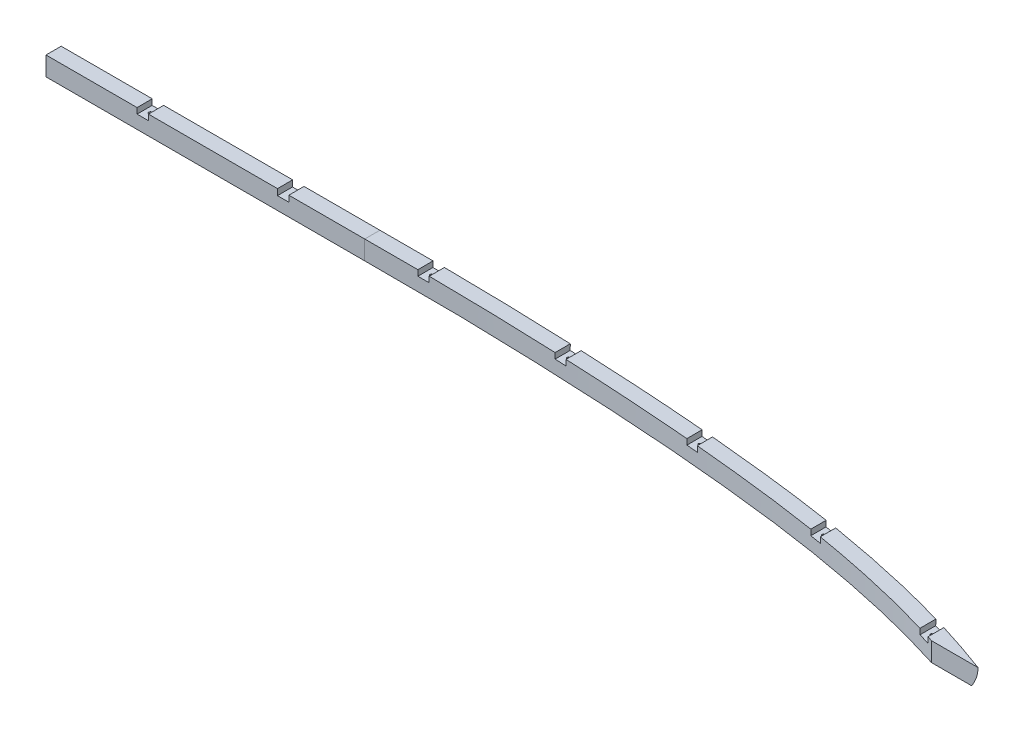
ISO-10303-21;
HEADER;
FILE_DESCRIPTION(('STEP AP214'),'2;1');
FILE_NAME('part.step','',(''),(''),'','','');
FILE_SCHEMA(('AUTOMOTIVE_DESIGN { 1 0 10303 214 1 1 1 1 }'));
ENDSEC;
DATA;
#1=APPLICATION_CONTEXT('core data for automotive mechanical design processes');
#2=APPLICATION_PROTOCOL_DEFINITION('international standard','automotive_design',2000,#1);
#3=PRODUCT_CONTEXT('',#1,'mechanical');
#4=PRODUCT('Part','Part','',(#3));
#5=PRODUCT_RELATED_PRODUCT_CATEGORY('part','',(#4));
#6=PRODUCT_DEFINITION_FORMATION('','',#4);
#7=PRODUCT_DEFINITION_CONTEXT('part definition',#1,'design');
#8=PRODUCT_DEFINITION('design','',#6,#7);
#9=PRODUCT_DEFINITION_SHAPE('','',#8);
#10=(LENGTH_UNIT() NAMED_UNIT(*) SI_UNIT(.MILLI.,.METRE.));
#11=(NAMED_UNIT(*) PLANE_ANGLE_UNIT() SI_UNIT($,.RADIAN.));
#12=(NAMED_UNIT(*) SI_UNIT($,.STERADIAN.) SOLID_ANGLE_UNIT());
#13=UNCERTAINTY_MEASURE_WITH_UNIT(LENGTH_MEASURE(1.E-05),#10,'distance_accuracy_value','');
#14=(GEOMETRIC_REPRESENTATION_CONTEXT(3) GLOBAL_UNCERTAINTY_ASSIGNED_CONTEXT((#13)) GLOBAL_UNIT_ASSIGNED_CONTEXT((#10,
#11,#12)) REPRESENTATION_CONTEXT('',''));
#15=CARTESIAN_POINT('',(0.,0.,0.));
#16=DIRECTION('',(0.,0.,1.));
#17=DIRECTION('',(1.,0.,0.));
#18=AXIS2_PLACEMENT_3D('',#15,#16,#17);
#19=CARTESIAN_POINT('',(-463.5500016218,-9.52499999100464,-350.235159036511));
#20=DIRECTION('',(0.,-1.,0.));
#21=DIRECTION('',(1.,0.,0.));
#22=AXIS2_PLACEMENT_3D('',#19,#20,#21);
#23=PLANE('',#22);
#24=DIRECTION('',(0.,0.,1.));
#25=VECTOR('',#24,1.);
#26=CARTESIAN_POINT('',(-482.6000016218,-9.52499999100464,-350.235159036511));
#27=LINE('',#26,#25);
#28=CARTESIAN_POINT('',(-482.6000016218,-9.52499999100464,-260.175703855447));
#29=VERTEX_POINT('',#28);
#30=CARTESIAN_POINT('',(-482.6000016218,-9.52499999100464,-234.949776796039));
#31=VERTEX_POINT('',#30);
#32=EDGE_CURVE('E288',#29,#31,#27,.T.);
#33=ORIENTED_EDGE('',*,*,#32,.T.);
#34=DIRECTION('',(1.,0.,0.));
#35=VECTOR('',#34,1.);
#36=CARTESIAN_POINT('',(-463.5500016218,-9.52499999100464,-234.949776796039));
#37=LINE('',#36,#35);
#38=CARTESIAN_POINT('',(-463.5500016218,-9.52499999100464,-234.949776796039));
#39=VERTEX_POINT('',#38);
#40=EDGE_CURVE('E296',#31,#39,#37,.T.);
#41=ORIENTED_EDGE('',*,*,#40,.T.);
#42=DIRECTION('',(0.,0.,1.));
#43=VECTOR('',#42,1.);
#44=CARTESIAN_POINT('',(-463.5500016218,-9.52499999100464,-350.235159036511));
#45=LINE('',#44,#43);
#46=CARTESIAN_POINT('',(-463.5500016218,-9.52499999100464,-260.175703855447));
#47=VERTEX_POINT('',#46);
#48=EDGE_CURVE('E290',#47,#39,#45,.T.);
#49=ORIENTED_EDGE('',*,*,#48,.F.);
#50=DIRECTION('',(1.,0.,0.));
#51=VECTOR('',#50,1.);
#52=CARTESIAN_POINT('',(-330.199999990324,-9.52499999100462,-260.175703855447));
#53=LINE('',#52,#51);
#54=EDGE_CURVE('E284',#29,#47,#53,.T.);
#55=ORIENTED_EDGE('',*,*,#54,.F.);
#56=EDGE_LOOP('',(#33,#41,#49,#55));
#57=FACE_BOUND('',#56,.T.);
#58=CARTESIAN_POINT('',(-473.075001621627,-9.52499999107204,-247.650862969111));
#59=DIRECTION('',(0.,1.,0.));
#60=DIRECTION('',(0.,0.,1.));
#61=AXIS2_PLACEMENT_3D('',#58,#59,#60);
#62=CIRCLE('',#61,2.67970000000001);
#63=CARTESIAN_POINT('',(-473.075001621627,-9.52499999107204,-244.971162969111));
#64=VERTEX_POINT('',#63);
#65=EDGE_CURVE('E302',#64,#64,#62,.T.);
#66=ORIENTED_EDGE('',*,*,#65,.F.);
#67=EDGE_LOOP('',(#66));
#68=FACE_BOUND('',#67,.T.);
#69=ADVANCED_FACE('F48',(#57,#68),#23,.F.);
#70=CARTESIAN_POINT('',(-330.199999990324,7.58496376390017E-13,-260.350000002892));
#71=DIRECTION('',(0.,-1.,0.));
#72=DIRECTION('',(0.,0.,1.));
#73=AXIS2_PLACEMENT_3D('',#70,#71,#72);
#74=PLANE('',#73);
#75=DIRECTION('',(1.,0.,0.));
#76=VECTOR('',#75,1.);
#77=CARTESIAN_POINT('',(-330.199999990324,0.,-234.949776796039));
#78=LINE('',#77,#76);
#79=CARTESIAN_POINT('',(-634.999999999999,0.,-234.949776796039));
#80=VERTEX_POINT('',#79);
#81=CARTESIAN_POINT('',(-482.6000016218,0.,-234.949776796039));
#82=VERTEX_POINT('',#81);
#83=EDGE_CURVE('E218',#80,#82,#78,.T.);
#84=ORIENTED_EDGE('',*,*,#83,.T.);
#85=DIRECTION('',(0.,0.,1.));
#86=VECTOR('',#85,1.);
#87=CARTESIAN_POINT('',(-482.6000016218,0.,-350.235159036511));
#88=LINE('',#87,#86);
#89=CARTESIAN_POINT('',(-482.6000016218,0.,-260.350000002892));
#90=VERTEX_POINT('',#89);
#91=EDGE_CURVE('E287',#90,#82,#88,.T.);
#92=ORIENTED_EDGE('',*,*,#91,.F.);
#93=DIRECTION('',(1.,0.,0.));
#94=VECTOR('',#93,1.);
#95=CARTESIAN_POINT('',(-330.199999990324,7.58496376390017E-13,-260.350000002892));
#96=LINE('',#95,#94);
#97=CARTESIAN_POINT('',(-634.999999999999,7.58496376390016E-13,-260.350000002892));
#98=VERTEX_POINT('',#97);
#99=EDGE_CURVE('E12',#98,#90,#96,.T.);
#100=ORIENTED_EDGE('',*,*,#99,.F.);
#101=DIRECTION('',(0.,0.,1.));
#102=VECTOR('',#101,1.);
#103=CARTESIAN_POINT('',(-634.999999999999,7.58496376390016E-13,-260.350000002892));
#104=LINE('',#103,#102);
#105=EDGE_CURVE('E250',#98,#80,#104,.T.);
#106=ORIENTED_EDGE('',*,*,#105,.T.);
#107=EDGE_LOOP('',(#84,#92,#100,#106));
#108=FACE_BOUND('',#107,.T.);
#109=ADVANCED_FACE('F159',(#108),#74,.F.);
#110=CARTESIAN_POINT('',(-463.5500016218,0.,-260.350000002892));
#111=VERTEX_POINT('',#110);
#112=CARTESIAN_POINT('',(-247.649998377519,0.,-260.350000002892));
#113=VERTEX_POINT('',#112);
#114=EDGE_CURVE('E56',#111,#113,#96,.T.);
#115=ORIENTED_EDGE('',*,*,#114,.F.);
#116=DIRECTION('',(0.,0.,1.));
#117=VECTOR('',#116,1.);
#118=CARTESIAN_POINT('',(-463.5500016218,0.,-350.235159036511));
#119=LINE('',#118,#117);
#120=CARTESIAN_POINT('',(-463.5500016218,0.,-234.949776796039));
#121=VERTEX_POINT('',#120);
#122=EDGE_CURVE('E212',#111,#121,#119,.T.);
#123=ORIENTED_EDGE('',*,*,#122,.T.);
#124=CARTESIAN_POINT('',(-247.649998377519,0.,-234.949776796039));
#125=VERTEX_POINT('',#124);
#126=EDGE_CURVE('E223',#121,#125,#78,.T.);
#127=ORIENTED_EDGE('',*,*,#126,.T.);
#128=DIRECTION('',(0.,0.,1.));
#129=VECTOR('',#128,1.);
#130=CARTESIAN_POINT('',(-247.649998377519,0.,-350.235159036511));
#131=LINE('',#130,#129);
#132=EDGE_CURVE('E214',#113,#125,#131,.T.);
#133=ORIENTED_EDGE('',*,*,#132,.F.);
#134=EDGE_LOOP('',(#115,#123,#127,#133));
#135=FACE_BOUND('',#134,.T.);
#136=ADVANCED_FACE('F165',(#135),#74,.F.);
#137=CARTESIAN_POINT('',(-634.999999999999,-1.38777878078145E-13,0.));
#138=DIRECTION('',(1.,0.,0.));
#139=DIRECTION('',(0.,0.,-1.));
#140=AXIS2_PLACEMENT_3D('',#137,#138,#139);
#141=PLANE('',#140);
#142=DIRECTION('',(0.,0.,-1.));
#143=VECTOR('',#142,1.);
#144=CARTESIAN_POINT('',(-634.999999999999,-31.7500000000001,-258.406772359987));
#145=LINE('',#144,#143);
#146=CARTESIAN_POINT('',(-634.999999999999,-31.7500000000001,-234.949776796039));
#147=VERTEX_POINT('',#146);
#148=CARTESIAN_POINT('',(-634.999999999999,-31.7500000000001,-258.406772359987));
#149=VERTEX_POINT('',#148);
#150=EDGE_CURVE('E256',#147,#149,#145,.T.);
#151=ORIENTED_EDGE('',*,*,#150,.F.);
#152=DIRECTION('',(0.,-1.,0.));
#153=VECTOR('',#152,1.);
#154=CARTESIAN_POINT('',(-634.999999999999,-31.7500000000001,-234.949776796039));
#155=LINE('',#154,#153);
#156=EDGE_CURVE('E252',#80,#147,#155,.T.);
#157=ORIENTED_EDGE('',*,*,#156,.F.);
#158=ORIENTED_EDGE('',*,*,#105,.F.);
#159=CARTESIAN_POINT('',(-634.999999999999,0.,0.));
#160=DIRECTION('',(1.,0.,0.));
#161=DIRECTION('',(0.,0.,-1.));
#162=AXIS2_PLACEMENT_3D('',#159,#160,#161);
#163=CIRCLE('',#162,260.350000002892);
#164=EDGE_CURVE('E249',#149,#98,#163,.T.);
#165=ORIENTED_EDGE('',*,*,#164,.F.);
#166=EDGE_LOOP('',(#151,#157,#158,#165));
#167=FACE_BOUND('',#166,.T.);
#168=ADVANCED_FACE('F184',(#167),#141,.F.);
#169=CARTESIAN_POINT('',(-330.199999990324,0.,0.));
#170=DIRECTION('',(1.,0.,0.));
#171=DIRECTION('',(0.,0.,1.));
#172=AXIS2_PLACEMENT_3D('',#169,#170,#171);
#173=CYLINDRICAL_SURFACE('',#172,260.350000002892);
#174=ORIENTED_EDGE('',*,*,#99,.T.);
#175=CARTESIAN_POINT('',(-482.6000016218,0.,0.));
#176=DIRECTION('',(-1.,0.,0.));
#177=DIRECTION('',(0.,0.,1.));
#178=AXIS2_PLACEMENT_3D('',#175,#176,#177);
#179=CIRCLE('',#178,260.350000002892);
#180=EDGE_CURVE('E279',#90,#29,#179,.T.);
#181=ORIENTED_EDGE('',*,*,#180,.T.);
#182=ORIENTED_EDGE('',*,*,#54,.T.);
#183=CARTESIAN_POINT('',(-463.5500016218,0.,0.));
#184=DIRECTION('',(1.,0.,0.));
#185=DIRECTION('',(0.,0.,-1.));
#186=AXIS2_PLACEMENT_3D('',#183,#184,#185);
#187=CIRCLE('',#186,260.350000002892);
#188=EDGE_CURVE('E282',#47,#111,#187,.T.);
#189=ORIENTED_EDGE('',*,*,#188,.T.);
#190=ORIENTED_EDGE('',*,*,#114,.T.);
#191=CARTESIAN_POINT('',(-247.649998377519,0.,0.));
#192=DIRECTION('',(-1.,0.,0.));
#193=DIRECTION('',(0.,0.,1.));
#194=AXIS2_PLACEMENT_3D('',#191,#192,#193);
#195=CIRCLE('',#194,260.350000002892);
#196=CARTESIAN_POINT('',(-247.649998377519,-10.2364648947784,-260.148683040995));
#197=VERTEX_POINT('',#196);
#198=EDGE_CURVE('E253',#113,#197,#195,.T.);
#199=ORIENTED_EDGE('',*,*,#198,.T.);
#200=DIRECTION('',(1.,0.,0.));
#201=VECTOR('',#200,1.);
#202=CARTESIAN_POINT('',(-330.199999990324,-10.2364648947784,-260.148683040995));
#203=LINE('',#202,#201);
#204=CARTESIAN_POINT('',(-228.599998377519,-10.2364648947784,-260.148683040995));
#205=VERTEX_POINT('',#204);
#206=EDGE_CURVE('E263',#197,#205,#203,.T.);
#207=ORIENTED_EDGE('',*,*,#206,.T.);
#208=CARTESIAN_POINT('',(-228.599998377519,0.,0.));
#209=DIRECTION('',(1.,0.,0.));
#210=DIRECTION('',(0.,0.,-1.));
#211=AXIS2_PLACEMENT_3D('',#208,#209,#210);
#212=CIRCLE('',#211,260.350000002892);
#213=CARTESIAN_POINT('',(-228.599998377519,0.,-260.350000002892));
#214=VERTEX_POINT('',#213);
#215=EDGE_CURVE('E261',#205,#214,#212,.T.);
#216=ORIENTED_EDGE('',*,*,#215,.T.);
#217=CARTESIAN_POINT('',(-101.599999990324,7.58496376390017E-13,-260.350000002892));
#218=VERTEX_POINT('',#217);
#219=EDGE_CURVE('E57',#214,#218,#96,.T.);
#220=ORIENTED_EDGE('',*,*,#219,.T.);
#221=CARTESIAN_POINT('',(-101.599999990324,0.,0.));
#222=DIRECTION('',(1.,0.,0.));
#223=DIRECTION('',(0.,0.,-1.));
#224=AXIS2_PLACEMENT_3D('',#221,#222,#223);
#225=CIRCLE('',#224,260.350000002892);
#226=CARTESIAN_POINT('',(-101.599999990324,-31.7500000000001,-258.406772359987));
#227=VERTEX_POINT('',#226);
#228=EDGE_CURVE('E247',#227,#218,#225,.T.);
#229=ORIENTED_EDGE('',*,*,#228,.F.);
#230=DIRECTION('',(1.,0.,0.));
#231=VECTOR('',#230,1.);
#232=CARTESIAN_POINT('',(-330.199999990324,-31.7500000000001,-258.406772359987));
#233=LINE('',#232,#231);
#234=EDGE_CURVE('E234',#149,#227,#233,.T.);
#235=ORIENTED_EDGE('',*,*,#234,.F.);
#236=ORIENTED_EDGE('',*,*,#164,.T.);
#237=EDGE_LOOP('',(#174,#181,#182,#189,#190,#199,#207,#216,#220,#229,#235,#236));
#238=FACE_BOUND('',#237,.T.);
#239=ADVANCED_FACE('F50',(#238),#173,.T.);
#240=ORIENTED_EDGE('',*,*,#219,.F.);
#241=DIRECTION('',(0.,0.,1.));
#242=VECTOR('',#241,1.);
#243=CARTESIAN_POINT('',(-228.599998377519,0.,-350.235159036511));
#244=LINE('',#243,#242);
#245=CARTESIAN_POINT('',(-228.599998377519,0.,-234.949776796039));
#246=VERTEX_POINT('',#245);
#247=EDGE_CURVE('E271',#214,#246,#244,.T.);
#248=ORIENTED_EDGE('',*,*,#247,.T.);
#249=CARTESIAN_POINT('',(-101.599999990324,0.,-234.949776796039));
#250=VERTEX_POINT('',#249);
#251=EDGE_CURVE('E224',#246,#250,#78,.T.);
#252=ORIENTED_EDGE('',*,*,#251,.T.);
#253=DIRECTION('',(0.,0.,1.));
#254=VECTOR('',#253,1.);
#255=CARTESIAN_POINT('',(-101.599999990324,7.58496376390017E-13,-260.350000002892));
#256=LINE('',#255,#254);
#257=EDGE_CURVE('E244',#218,#250,#256,.T.);
#258=ORIENTED_EDGE('',*,*,#257,.F.);
#259=EDGE_LOOP('',(#240,#248,#252,#258));
#260=FACE_BOUND('',#259,.T.);
#261=ADVANCED_FACE('F167',(#260),#74,.F.);
#262=CARTESIAN_POINT('',(-330.199999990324,-31.7500000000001,-234.949776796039));
#263=DIRECTION('',(0.,0.,-1.));
#264=DIRECTION('',(1.,0.,0.));
#265=AXIS2_PLACEMENT_3D('',#262,#263,#264);
#266=PLANE('',#265);
#267=ORIENTED_EDGE('',*,*,#40,.F.);
#268=DIRECTION('',(0.,-1.,0.));
#269=VECTOR('',#268,1.);
#270=CARTESIAN_POINT('',(-482.6000016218,-9.52499999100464,-234.949776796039));
#271=LINE('',#270,#269);
#272=EDGE_CURVE('E64',#82,#31,#271,.T.);
#273=ORIENTED_EDGE('',*,*,#272,.F.);
#274=ORIENTED_EDGE('',*,*,#83,.F.);
#275=ORIENTED_EDGE('',*,*,#156,.T.);
#276=DIRECTION('',(1.,0.,0.));
#277=VECTOR('',#276,1.);
#278=CARTESIAN_POINT('',(-330.199999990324,-31.7500000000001,-234.949776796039));
#279=LINE('',#278,#277);
#280=CARTESIAN_POINT('',(-101.599999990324,-31.7500000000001,-234.949776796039));
#281=VERTEX_POINT('',#280);
#282=EDGE_CURVE('E228',#147,#281,#279,.T.);
#283=ORIENTED_EDGE('',*,*,#282,.T.);
#284=DIRECTION('',(0.,-1.,0.));
#285=VECTOR('',#284,1.);
#286=CARTESIAN_POINT('',(-101.599999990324,-31.7500000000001,-234.949776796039));
#287=LINE('',#286,#285);
#288=EDGE_CURVE('E241',#250,#281,#287,.T.);
#289=ORIENTED_EDGE('',*,*,#288,.F.);
#290=ORIENTED_EDGE('',*,*,#251,.F.);
#291=DIRECTION('',(0.,1.,0.));
#292=VECTOR('',#291,1.);
#293=CARTESIAN_POINT('',(-228.599998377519,-10.2364648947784,-234.949776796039));
#294=LINE('',#293,#292);
#295=CARTESIAN_POINT('',(-228.599998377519,-10.2364648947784,-234.949776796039));
#296=VERTEX_POINT('',#295);
#297=EDGE_CURVE('E269',#296,#246,#294,.T.);
#298=ORIENTED_EDGE('',*,*,#297,.F.);
#299=DIRECTION('',(1.,0.,0.));
#300=VECTOR('',#299,1.);
#301=CARTESIAN_POINT('',(-228.599998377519,-10.2364648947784,-234.949776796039));
#302=LINE('',#301,#300);
#303=CARTESIAN_POINT('',(-247.649998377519,-10.2364648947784,-234.949776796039));
#304=VERTEX_POINT('',#303);
#305=EDGE_CURVE('E275',#304,#296,#302,.T.);
#306=ORIENTED_EDGE('',*,*,#305,.F.);
#307=DIRECTION('',(0.,-1.,0.));
#308=VECTOR('',#307,1.);
#309=CARTESIAN_POINT('',(-247.649998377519,-10.2364648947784,-234.949776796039));
#310=LINE('',#309,#308);
#311=EDGE_CURVE('E72',#125,#304,#310,.T.);
#312=ORIENTED_EDGE('',*,*,#311,.F.);
#313=ORIENTED_EDGE('',*,*,#126,.F.);
#314=DIRECTION('',(0.,1.,0.));
#315=VECTOR('',#314,1.);
#316=CARTESIAN_POINT('',(-463.5500016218,-9.52499999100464,-234.949776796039));
#317=LINE('',#316,#315);
#318=EDGE_CURVE('E291',#39,#121,#317,.T.);
#319=ORIENTED_EDGE('',*,*,#318,.F.);
#320=EDGE_LOOP('',(#267,#273,#274,#275,#283,#289,#290,#298,#306,#312,#313,#319));
#321=FACE_BOUND('',#320,.T.);
#322=ADVANCED_FACE('F194',(#321),#266,.F.);
#323=CARTESIAN_POINT('',(-330.199999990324,-31.7500000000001,-258.406772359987));
#324=DIRECTION('',(0.,1.,0.));
#325=DIRECTION('',(0.,0.,-1.));
#326=AXIS2_PLACEMENT_3D('',#323,#324,#325);
#327=PLANE('',#326);
#328=DIRECTION('',(0.,0.,-1.));
#329=VECTOR('',#328,1.);
#330=CARTESIAN_POINT('',(-101.599999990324,-31.7500000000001,-258.406772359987));
#331=LINE('',#330,#329);
#332=EDGE_CURVE('E237',#281,#227,#331,.T.);
#333=ORIENTED_EDGE('',*,*,#332,.F.);
#334=ORIENTED_EDGE('',*,*,#282,.F.);
#335=ORIENTED_EDGE('',*,*,#150,.T.);
#336=ORIENTED_EDGE('',*,*,#234,.T.);
#337=EDGE_LOOP('',(#333,#334,#335,#336));
#338=FACE_BOUND('',#337,.T.);
#339=ADVANCED_FACE('F190',(#338),#327,.F.);
#340=CARTESIAN_POINT('',(-101.599999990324,0.,0.));
#341=DIRECTION('',(-1.,0.,0.));
#342=DIRECTION('',(0.,0.,-1.));
#343=AXIS2_PLACEMENT_3D('',#340,#341,#342);
#344=PLANE('',#343);
#345=ORIENTED_EDGE('',*,*,#228,.T.);
#346=ORIENTED_EDGE('',*,*,#257,.T.);
#347=ORIENTED_EDGE('',*,*,#288,.T.);
#348=ORIENTED_EDGE('',*,*,#332,.T.);
#349=EDGE_LOOP('',(#345,#346,#347,#348));
#350=FACE_BOUND('',#349,.T.);
#351=ADVANCED_FACE('F183',(#350),#344,.F.);
#352=CARTESIAN_POINT('',(-247.649998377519,-10.2364648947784,-350.235159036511));
#353=DIRECTION('',(-1.,0.,0.));
#354=DIRECTION('',(0.,0.,1.));
#355=AXIS2_PLACEMENT_3D('',#352,#353,#354);
#356=PLANE('',#355);
#357=ORIENTED_EDGE('',*,*,#132,.T.);
#358=ORIENTED_EDGE('',*,*,#311,.T.);
#359=DIRECTION('',(0.,0.,1.));
#360=VECTOR('',#359,1.);
#361=CARTESIAN_POINT('',(-247.649998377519,-10.2364648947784,-350.235159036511));
#362=LINE('',#361,#360);
#363=EDGE_CURVE('E266',#197,#304,#362,.T.);
#364=ORIENTED_EDGE('',*,*,#363,.F.);
#365=ORIENTED_EDGE('',*,*,#198,.F.);
#366=EDGE_LOOP('',(#357,#358,#364,#365));
#367=FACE_BOUND('',#366,.T.);
#368=ADVANCED_FACE('F176',(#367),#356,.F.);
#369=CARTESIAN_POINT('',(-228.599998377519,-10.2364648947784,-350.235159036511));
#370=DIRECTION('',(1.,0.,0.));
#371=DIRECTION('',(0.,0.,-1.));
#372=AXIS2_PLACEMENT_3D('',#369,#370,#371);
#373=PLANE('',#372);
#374=DIRECTION('',(0.,0.,1.));
#375=VECTOR('',#374,1.);
#376=CARTESIAN_POINT('',(-228.599998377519,-10.2364648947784,-350.235159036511));
#377=LINE('',#376,#375);
#378=EDGE_CURVE('E268',#205,#296,#377,.T.);
#379=ORIENTED_EDGE('',*,*,#378,.T.);
#380=ORIENTED_EDGE('',*,*,#297,.T.);
#381=ORIENTED_EDGE('',*,*,#247,.F.);
#382=ORIENTED_EDGE('',*,*,#215,.F.);
#383=EDGE_LOOP('',(#379,#380,#381,#382));
#384=FACE_BOUND('',#383,.T.);
#385=ADVANCED_FACE('F173',(#384),#373,.F.);
#386=CARTESIAN_POINT('',(-228.599998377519,-10.2364648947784,-350.235159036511));
#387=DIRECTION('',(0.,-1.,0.));
#388=DIRECTION('',(1.,0.,0.));
#389=AXIS2_PLACEMENT_3D('',#386,#387,#388);
#390=PLANE('',#389);
#391=ORIENTED_EDGE('',*,*,#363,.T.);
#392=ORIENTED_EDGE('',*,*,#305,.T.);
#393=ORIENTED_EDGE('',*,*,#378,.F.);
#394=ORIENTED_EDGE('',*,*,#206,.F.);
#395=EDGE_LOOP('',(#391,#392,#393,#394));
#396=FACE_BOUND('',#395,.T.);
#397=ADVANCED_FACE('F172',(#396),#390,.F.);
#398=CARTESIAN_POINT('',(-482.6000016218,-9.52499999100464,-350.235159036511));
#399=DIRECTION('',(-1.,0.,0.));
#400=DIRECTION('',(0.,0.,1.));
#401=AXIS2_PLACEMENT_3D('',#398,#399,#400);
#402=PLANE('',#401);
#403=ORIENTED_EDGE('',*,*,#91,.T.);
#404=ORIENTED_EDGE('',*,*,#272,.T.);
#405=ORIENTED_EDGE('',*,*,#32,.F.);
#406=ORIENTED_EDGE('',*,*,#180,.F.);
#407=EDGE_LOOP('',(#403,#404,#405,#406));
#408=FACE_BOUND('',#407,.T.);
#409=ADVANCED_FACE('F154',(#408),#402,.F.);
#410=CARTESIAN_POINT('',(-463.5500016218,-9.52499999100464,-350.235159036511));
#411=DIRECTION('',(1.,0.,0.));
#412=DIRECTION('',(0.,0.,-1.));
#413=AXIS2_PLACEMENT_3D('',#410,#411,#412);
#414=PLANE('',#413);
#415=ORIENTED_EDGE('',*,*,#48,.T.);
#416=ORIENTED_EDGE('',*,*,#318,.T.);
#417=ORIENTED_EDGE('',*,*,#122,.F.);
#418=ORIENTED_EDGE('',*,*,#188,.F.);
#419=EDGE_LOOP('',(#415,#416,#417,#418));
#420=FACE_BOUND('',#419,.T.);
#421=ADVANCED_FACE('F145',(#420),#414,.F.);
#422=CARTESIAN_POINT('',(-473.075001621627,-17.4851261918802,-247.650862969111));
#423=DIRECTION('',(0.,1.,0.));
#424=DIRECTION('',(0.,0.,1.));
#425=AXIS2_PLACEMENT_3D('',#422,#423,#424);
#426=CONICAL_SURFACE('',#425,0.,1.02974425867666);
#427=CARTESIAN_POINT('',(-473.075001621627,-15.874999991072,-247.650862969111));
#428=DIRECTION('',(0.,1.,0.));
#429=DIRECTION('',(0.,0.,1.));
#430=AXIS2_PLACEMENT_3D('',#427,#428,#429);
#431=CIRCLE('',#430,2.67970000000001);
#432=CARTESIAN_POINT('',(-473.075001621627,-15.874999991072,-244.971162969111));
#433=VERTEX_POINT('',#432);
#434=EDGE_CURVE('E300',#433,#433,#431,.T.);
#435=ORIENTED_EDGE('',*,*,#434,.T.);
#436=EDGE_LOOP('',(#435));
#437=FACE_BOUND('',#436,.T.);
#438=CARTESIAN_POINT('',(-473.075001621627,-17.4851261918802,-247.650862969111));
#439=VERTEX_POINT('',#438);
#440=VERTEX_LOOP('',#439);
#441=FACE_BOUND('',#440,.T.);
#442=ADVANCED_FACE('F142',(#437,#441),#426,.F.);
#443=CARTESIAN_POINT('',(-473.075001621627,-9.52499999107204,-247.650862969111));
#444=DIRECTION('',(0.,1.,0.));
#445=DIRECTION('',(0.,0.,1.));
#446=AXIS2_PLACEMENT_3D('',#443,#444,#445);
#447=CYLINDRICAL_SURFACE('',#446,2.67970000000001);
#448=ORIENTED_EDGE('',*,*,#65,.T.);
#449=EDGE_LOOP('',(#448));
#450=FACE_BOUND('',#449,.T.);
#451=ORIENTED_EDGE('',*,*,#434,.F.);
#452=EDGE_LOOP('',(#451));
#453=FACE_BOUND('',#452,.T.);
#454=ADVANCED_FACE('F144',(#450,#453),#447,.F.);
#455=CLOSED_SHELL('',(#69,#109,#136,#168,#239,#261,#322,#339,#351,#368,#385,#397,#409,#421,#442,#454));
#456=MANIFOLD_SOLID_BREP('B2',#455);
#457=CARTESIAN_POINT('',(534.422572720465,-9.525,-259.022249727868));
#458=DIRECTION('',(0.,-1.,0.));
#459=DIRECTION('',(0.,0.,1.));
#460=AXIS2_PLACEMENT_3D('',#457,#458,#459);
#461=PLANE('',#460);
#462=DIRECTION('',(0.,0.,1.));
#463=VECTOR('',#462,1.);
#464=CARTESIAN_POINT('',(946.149998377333,-9.525,-103.438565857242));
#465=LINE('',#464,#463);
#466=CARTESIAN_POINT('',(946.149998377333,-9.525,-156.0331716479));
#467=VERTEX_POINT('',#466);
#468=CARTESIAN_POINT('',(946.149998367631,-9.52500000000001,-129.744661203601));
#469=VERTEX_POINT('',#468);
#470=EDGE_CURVE('E691',#467,#469,#465,.T.);
#471=ORIENTED_EDGE('',*,*,#470,.F.);
#472=CARTESIAN_POINT('',(946.149998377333,-9.525,-156.0331716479));
#473=CARTESIAN_POINT('',(945.35781155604,-9.525,-156.275484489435));
#474=CARTESIAN_POINT('',(944.565423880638,-9.525,-156.517140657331));
#475=CARTESIAN_POINT('',(942.980256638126,-9.525,-156.999141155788));
#476=CARTESIAN_POINT('',(942.187477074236,-9.525,-157.239485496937));
#477=CARTESIAN_POINT('',(940.601527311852,-9.525,-157.718866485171));
#478=CARTESIAN_POINT('',(939.808357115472,-9.525,-157.957903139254));
#479=CARTESIAN_POINT('',(938.221627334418,-9.525,-158.434672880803));
#480=CARTESIAN_POINT('',(937.428067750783,-9.525,-158.672405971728));
#481=CARTESIAN_POINT('',(935.840560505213,-9.525,-159.146572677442));
#482=CARTESIAN_POINT('',(935.046612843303,-9.525,-159.383006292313));
#483=CARTESIAN_POINT('',(933.458330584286,-9.525,-159.854578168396));
#484=CARTESIAN_POINT('',(932.663995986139,-9.525,-160.089716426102));
#485=CARTESIAN_POINT('',(931.074941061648,-9.525,-160.558701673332));
#486=CARTESIAN_POINT('',(930.280220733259,-9.525,-160.792548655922));
#487=CARTESIAN_POINT('',(928.690395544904,-9.525,-161.258955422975));
#488=CARTESIAN_POINT('',(927.895290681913,-9.525,-161.491515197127));
#489=CARTESIAN_POINT('',(927.099998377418,-9.525,-161.723432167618));
#490=B_SPLINE_CURVE_WITH_KNOTS('',3,(#472,#473,#474,#475,#476,#477,#478,#479,#480,#481,#482,
#483,#484,#485,#486,#487,#488,#489),.UNSPECIFIED.,.F.,.F.,(4,2,2,2,2,2,2,2,4),(0.,
2.48525205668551,4.9704840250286,7.4557026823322,9.94091474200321,12.4261266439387,
14.9113452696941,17.3965772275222,19.8818290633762),.UNSPECIFIED.);
#491=CARTESIAN_POINT('',(927.099998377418,-9.525,-161.723432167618));
#492=VERTEX_POINT('',#491);
#493=EDGE_CURVE('E690',#467,#492,#490,.T.);
#494=ORIENTED_EDGE('',*,*,#493,.T.);
#495=DIRECTION('',(0.,0.,-1.));
#496=VECTOR('',#495,1.);
#497=CARTESIAN_POINT('',(927.099998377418,-9.525,-109.017910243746));
#498=LINE('',#497,#496);
#499=CARTESIAN_POINT('',(927.099998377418,-9.525,-135.530492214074));
#500=VERTEX_POINT('',#499);
#501=EDGE_CURVE('E686',#500,#492,#498,.T.);
#502=ORIENTED_EDGE('',*,*,#501,.F.);
#503=CARTESIAN_POINT('',(-3070.65215490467,-9.52500000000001,-94.639891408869));
#504=CARTESIAN_POINT('',(-2046.40956664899,-9.52500000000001,-237.710681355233));
#505=CARTESIAN_POINT('',(-1024.8947954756,-9.52500000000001,-234.898762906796));
#506=CARTESIAN_POINT('',(2.7463275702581,-9.52500000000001,-234.951167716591));
#507=CARTESIAN_POINT('',(8.8188747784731,-9.52500000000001,-234.93803628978));
#508=CARTESIAN_POINT('',(20.9633487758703,-9.52500000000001,-234.87859364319));
#509=CARTESIAN_POINT('',(39.1792048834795,-9.52500000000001,-234.74371053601));
#510=CARTESIAN_POINT('',(57.3926984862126,-9.52500000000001,-234.482481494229));
#511=CARTESIAN_POINT('',(93.8170721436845,-9.52500000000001,-233.820251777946));
#512=CARTESIAN_POINT('',(118.096503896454,-9.52500000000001,-233.19244118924));
#513=CARTESIAN_POINT('',(166.651240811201,-9.52500000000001,-231.716131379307));
#514=CARTESIAN_POINT('',(190.926726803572,-9.52500000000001,-230.877302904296));
#515=CARTESIAN_POINT('',(239.473167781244,-9.52500000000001,-228.957329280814));
#516=CARTESIAN_POINT('',(263.743135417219,-9.52500000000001,-227.87477772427));
#517=CARTESIAN_POINT('',(312.257838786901,-9.52500000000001,-225.415648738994));
#518=CARTESIAN_POINT('',(336.504717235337,-9.52500000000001,-224.039778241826));
#519=CARTESIAN_POINT('',(384.973238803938,-9.52500000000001,-220.935512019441));
#520=CARTESIAN_POINT('',(409.194867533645,-9.52500000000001,-219.206915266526));
#521=CARTESIAN_POINT('',(457.608437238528,-9.52500000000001,-215.334998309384));
#522=CARTESIAN_POINT('',(481.799938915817,-9.52500000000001,-213.185541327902));
#523=CARTESIAN_POINT('',(518.064441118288,-9.52500000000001,-209.643545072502));
#524=CARTESIAN_POINT('',(530.148863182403,-9.52500000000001,-208.410559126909));
#525=CARTESIAN_POINT('',(554.310403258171,-9.52500000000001,-205.842553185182));
#526=CARTESIAN_POINT('',(566.38121653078,-9.52500000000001,-204.510901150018));
#527=CARTESIAN_POINT('',(602.551579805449,-9.52500000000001,-200.341319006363));
#528=CARTESIAN_POINT('',(626.609600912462,-9.52500000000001,-197.321969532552));
#529=CARTESIAN_POINT('',(674.553245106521,-9.52500000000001,-190.539650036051));
#530=CARTESIAN_POINT('',(698.436657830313,-9.52500000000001,-186.767145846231));
#531=CARTESIAN_POINT('',(734.129420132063,-9.52500000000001,-180.537482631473));
#532=CARTESIAN_POINT('',(746.004996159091,-9.52500000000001,-178.365984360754));
#533=CARTESIAN_POINT('',(769.712255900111,-9.52500000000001,-173.833662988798));
#534=CARTESIAN_POINT('',(781.543893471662,-9.52500000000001,-171.472640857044));
#535=CARTESIAN_POINT('',(816.964640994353,-9.52500000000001,-164.06967078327));
#536=CARTESIAN_POINT('',(840.479552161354,-9.52500000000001,-158.707674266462));
#537=CARTESIAN_POINT('',(887.26743801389,-9.52500000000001,-146.940113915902));
#538=CARTESIAN_POINT('',(910.54127033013,-9.52500000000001,-140.538249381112));
#539=CARTESIAN_POINT('',(945.252593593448,-9.52500000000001,-130.075253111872));
#540=CARTESIAN_POINT('',(956.789604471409,-9.52500000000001,-126.443390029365));
#541=CARTESIAN_POINT('',(979.794414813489,-9.52500000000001,-118.881127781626));
#542=CARTESIAN_POINT('',(1002.73074739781,-9.52500000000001,-111.023493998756));
#543=CARTESIAN_POINT('',(1025.53280895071,-9.52500000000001,-102.58669638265));
#544=CARTESIAN_POINT('',(1042.58492404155,-9.52500000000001,-96.0458824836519));
#545=CARTESIAN_POINT('',(1048.26072300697,-9.52500000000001,-93.8300714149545));
#546=CARTESIAN_POINT('',(1415.64050338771,-9.52500000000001,52.0840689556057));
#547=CARTESIAN_POINT('',(1745.18928861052,-9.52500000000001,334.480421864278));
#548=CARTESIAN_POINT('',(1573.73315290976,-9.52500000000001,2777.90828872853));
#549=B_SPLINE_CURVE_WITH_KNOTS('',3,(#503,#504,#505,#506,#507,#508,#509,#510,#511,#512,#513,
#514,#515,#516,#517,#518,#519,#520,#521,#522,#523,#524,#525,#526,#527,#528,#529,#530,#531,#532,
#533,#534,#535,#536,#537,#538,#539,#540,#541,#542,#543,#544,#545,#546,#547,#548),.UNSPECIFIED.,
.F.,.F.,(4,2,2,1,2,2,2,2,2,2,2,2,2,2,2,2,2,2,2,2,1,2,2,4),(-2.56594304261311,0.0625000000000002,
0.0781250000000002,0.0937500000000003,0.125,0.187500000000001,0.250000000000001,
0.312500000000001,0.375000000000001,0.437500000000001,0.500000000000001,0.531250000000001,
0.562500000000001,0.625000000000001,0.687500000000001,0.718750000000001,0.750000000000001,
0.812500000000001,0.875000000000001,0.90625,0.9375,0.96875,0.984375,1.98157335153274),.UNSPECIFIED.);
#550=EDGE_CURVE('E814',#500,#469,#549,.T.);
#551=ORIENTED_EDGE('',*,*,#550,.T.);
#552=EDGE_LOOP('',(#471,#494,#502,#551));
#553=FACE_BOUND('',#552,.T.);
#554=CARTESIAN_POINT('',(936.624998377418,-9.525,-145.372528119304));
#555=DIRECTION('',(0.,-1.,0.));
#556=DIRECTION('',(0.,0.,-1.));
#557=AXIS2_PLACEMENT_3D('',#554,#555,#556);
#558=CIRCLE('',#557,2.08280000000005);
#559=CARTESIAN_POINT('',(936.624998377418,-9.525,-147.455328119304));
#560=VERTEX_POINT('',#559);
#561=EDGE_CURVE('E629',#560,#560,#558,.T.);
#562=ORIENTED_EDGE('',*,*,#561,.T.);
#563=EDGE_LOOP('',(#562));
#564=FACE_BOUND('',#563,.T.);
#565=ADVANCED_FACE('F437',(#553,#564),#461,.F.);
#566=CARTESIAN_POINT('',(534.422572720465,-9.525,-259.022249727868));
#567=DIRECTION('',(0.,-1.,0.));
#568=DIRECTION('',(0.,0.,1.));
#569=AXIS2_PLACEMENT_3D('',#566,#567,#568);
#570=PLANE('',#569);
#571=DIRECTION('',(0.,0.,1.));
#572=VECTOR('',#571,1.);
#573=CARTESIAN_POINT('',(711.199998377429,-9.525,-158.745002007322));
#574=LINE('',#573,#572);
#575=CARTESIAN_POINT('',(711.199998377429,-9.525,-210.053117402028));
#576=VERTEX_POINT('',#575);
#577=CARTESIAN_POINT('',(711.19999836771,-9.52500000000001,-184.511143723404));
#578=VERTEX_POINT('',#577);
#579=EDGE_CURVE('E1130',#576,#578,#574,.T.);
#580=ORIENTED_EDGE('',*,*,#579,.F.);
#581=CARTESIAN_POINT('',(711.199998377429,-9.525,-210.053117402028));
#582=CARTESIAN_POINT('',(708.027203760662,-9.525,-210.584985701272));
#583=CARTESIAN_POINT('',(704.853306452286,-9.525,-211.110099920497));
#584=CARTESIAN_POINT('',(698.503306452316,-9.525,-212.14682019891));
#585=CARTESIAN_POINT('',(695.327203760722,-9.525,-212.658426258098));
#586=CARTESIAN_POINT('',(692.149998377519,-9.525,-213.163278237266));
#587=B_SPLINE_CURVE_WITH_KNOTS('',3,(#581,#582,#583,#584,#585,#586),.UNSPECIFIED.,.F.,.F.,(4,2,
4),(0.,9.65113058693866,19.3022611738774),.UNSPECIFIED.);
#588=CARTESIAN_POINT('',(692.149998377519,-9.525,-213.163278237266));
#589=VERTEX_POINT('',#588);
#590=EDGE_CURVE('E1148',#576,#589,#587,.T.);
#591=ORIENTED_EDGE('',*,*,#590,.T.);
#592=DIRECTION('',(0.,0.,-1.));
#593=VECTOR('',#592,1.);
#594=CARTESIAN_POINT('',(692.149998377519,-9.525,-161.924874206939));
#595=LINE('',#594,#593);
#596=CARTESIAN_POINT('',(692.149998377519,-9.525,-187.654027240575));
#597=VERTEX_POINT('',#596);
#598=EDGE_CURVE('E1134',#597,#589,#595,.T.);
#599=ORIENTED_EDGE('',*,*,#598,.F.);
#600=CARTESIAN_POINT('',(-3070.65215490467,-9.52500000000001,-94.639891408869));
#601=CARTESIAN_POINT('',(-2046.40956664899,-9.52500000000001,-237.710681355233));
#602=CARTESIAN_POINT('',(-1024.8947954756,-9.52500000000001,-234.898762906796));
#603=CARTESIAN_POINT('',(2.7463275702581,-9.52500000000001,-234.951167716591));
#604=CARTESIAN_POINT('',(8.8188747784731,-9.52500000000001,-234.93803628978));
#605=CARTESIAN_POINT('',(20.9633487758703,-9.52500000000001,-234.87859364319));
#606=CARTESIAN_POINT('',(39.1792048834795,-9.52500000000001,-234.74371053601));
#607=CARTESIAN_POINT('',(57.3926984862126,-9.52500000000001,-234.482481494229));
#608=CARTESIAN_POINT('',(93.8170721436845,-9.52500000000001,-233.820251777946));
#609=CARTESIAN_POINT('',(118.096503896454,-9.52500000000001,-233.19244118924));
#610=CARTESIAN_POINT('',(166.651240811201,-9.52500000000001,-231.716131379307));
#611=CARTESIAN_POINT('',(190.926726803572,-9.52500000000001,-230.877302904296));
#612=CARTESIAN_POINT('',(239.473167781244,-9.52500000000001,-228.957329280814));
#613=CARTESIAN_POINT('',(263.743135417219,-9.52500000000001,-227.87477772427));
#614=CARTESIAN_POINT('',(312.257838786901,-9.52500000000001,-225.415648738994));
#615=CARTESIAN_POINT('',(336.504717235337,-9.52500000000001,-224.039778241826));
#616=CARTESIAN_POINT('',(384.973238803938,-9.52500000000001,-220.935512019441));
#617=CARTESIAN_POINT('',(409.194867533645,-9.52500000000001,-219.206915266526));
#618=CARTESIAN_POINT('',(457.608437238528,-9.52500000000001,-215.334998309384));
#619=CARTESIAN_POINT('',(481.799938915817,-9.52500000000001,-213.185541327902));
#620=CARTESIAN_POINT('',(518.064441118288,-9.52500000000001,-209.643545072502));
#621=CARTESIAN_POINT('',(530.148863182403,-9.52500000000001,-208.410559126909));
#622=CARTESIAN_POINT('',(554.310403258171,-9.52500000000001,-205.842553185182));
#623=CARTESIAN_POINT('',(566.38121653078,-9.52500000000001,-204.510901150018));
#624=CARTESIAN_POINT('',(602.551579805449,-9.52500000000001,-200.341319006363));
#625=CARTESIAN_POINT('',(626.609600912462,-9.52500000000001,-197.321969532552));
#626=CARTESIAN_POINT('',(674.553245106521,-9.52500000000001,-190.539650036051));
#627=CARTESIAN_POINT('',(698.436657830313,-9.52500000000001,-186.767145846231));
#628=CARTESIAN_POINT('',(734.129420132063,-9.52500000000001,-180.537482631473));
#629=CARTESIAN_POINT('',(746.004996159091,-9.52500000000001,-178.365984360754));
#630=CARTESIAN_POINT('',(769.712255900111,-9.52500000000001,-173.833662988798));
#631=CARTESIAN_POINT('',(781.543893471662,-9.52500000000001,-171.472640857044));
#632=CARTESIAN_POINT('',(816.964640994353,-9.52500000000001,-164.06967078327));
#633=CARTESIAN_POINT('',(840.479552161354,-9.52500000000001,-158.707674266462));
#634=CARTESIAN_POINT('',(887.26743801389,-9.52500000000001,-146.940113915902));
#635=CARTESIAN_POINT('',(910.54127033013,-9.52500000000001,-140.538249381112));
#636=CARTESIAN_POINT('',(945.252593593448,-9.52500000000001,-130.075253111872));
#637=CARTESIAN_POINT('',(956.789604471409,-9.52500000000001,-126.443390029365));
#638=CARTESIAN_POINT('',(979.794414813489,-9.52500000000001,-118.881127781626));
#639=CARTESIAN_POINT('',(1002.73074739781,-9.52500000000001,-111.023493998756));
#640=CARTESIAN_POINT('',(1025.53280895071,-9.52500000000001,-102.58669638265));
#641=CARTESIAN_POINT('',(1042.58492404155,-9.52500000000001,-96.0458824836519));
#642=CARTESIAN_POINT('',(1048.26072300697,-9.52500000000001,-93.8300714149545));
#643=CARTESIAN_POINT('',(1415.64050338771,-9.52500000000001,52.0840689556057));
#644=CARTESIAN_POINT('',(1745.18928861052,-9.52500000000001,334.480421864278));
#645=CARTESIAN_POINT('',(1573.73315290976,-9.52500000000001,2777.90828872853));
#646=B_SPLINE_CURVE_WITH_KNOTS('',3,(#600,#601,#602,#603,#604,#605,#606,#607,#608,#609,#610,
#611,#612,#613,#614,#615,#616,#617,#618,#619,#620,#621,#622,#623,#624,#625,#626,#627,#628,#629,
#630,#631,#632,#633,#634,#635,#636,#637,#638,#639,#640,#641,#642,#643,#644,#645),.UNSPECIFIED.,
.F.,.F.,(4,2,2,1,2,2,2,2,2,2,2,2,2,2,2,2,2,2,2,2,1,2,2,4),(-2.56594304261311,0.0625000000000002,
0.0781250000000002,0.0937500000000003,0.125,0.187500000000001,0.250000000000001,
0.312500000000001,0.375000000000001,0.437500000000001,0.500000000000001,0.531250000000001,
0.562500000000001,0.625000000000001,0.687500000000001,0.718750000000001,0.750000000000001,
0.812500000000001,0.875000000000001,0.90625,0.9375,0.96875,0.984375,1.98157335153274),.UNSPECIFIED.);
#647=EDGE_CURVE('E801',#597,#578,#646,.T.);
#648=ORIENTED_EDGE('',*,*,#647,.T.);
#649=EDGE_LOOP('',(#580,#591,#599,#648));
#650=FACE_BOUND('',#649,.T.);
#651=CARTESIAN_POINT('',(701.674998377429,-9.525,-198.803613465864));
#652=DIRECTION('',(0.,-1.,0.));
#653=DIRECTION('',(0.,0.,-1.));
#654=AXIS2_PLACEMENT_3D('',#651,#652,#653);
#655=CIRCLE('',#654,2.08280000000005);
#656=CARTESIAN_POINT('',(701.674998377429,-9.525,-200.886413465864));
#657=VERTEX_POINT('',#656);
#658=EDGE_CURVE('E641',#657,#657,#655,.T.);
#659=ORIENTED_EDGE('',*,*,#658,.T.);
#660=EDGE_LOOP('',(#659));
#661=FACE_BOUND('',#660,.T.);
#662=ADVANCED_FACE('F965',(#650,#661),#570,.F.);
#663=CARTESIAN_POINT('',(1096.30575386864,0.,-260.377618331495));
#664=DIRECTION('',(0.,-1.,0.));
#665=DIRECTION('',(1.,0.,0.));
#666=AXIS2_PLACEMENT_3D('',#663,#664,#665);
#667=PLANE('',#666);
#668=CARTESIAN_POINT('',(-1187.45,-2.14764522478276E-13,-0.793750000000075));
#669=CARTESIAN_POINT('',(-1187.41582639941,-2.10045062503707E-13,-2.14485212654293));
#670=CARTESIAN_POINT('',(-1187.35078911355,-2.01063250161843E-13,-4.71619414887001));
#671=CARTESIAN_POINT('',(-1187.0134288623,-1.869523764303E-13,-8.75174252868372));
#672=CARTESIAN_POINT('',(-1186.47507361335,-1.72346646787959E-13,-12.9254698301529));
#673=CARTESIAN_POINT('',(-1185.60677768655,-1.55742806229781E-13,-17.6656455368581));
#674=CARTESIAN_POINT('',(-1184.39784787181,-1.3828640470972E-13,-22.6439822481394));
#675=CARTESIAN_POINT('',(-1182.81805663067,-1.20315610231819E-13,-27.7630904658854));
#676=CARTESIAN_POINT('',(-1180.9000462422,-1.02322052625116E-13,-32.8827389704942));
#677=CARTESIAN_POINT('',(-1178.45058427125,0.,-38.3646195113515));
#678=CARTESIAN_POINT('',(-1175.42025005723,0.,-44.0192595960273));
#679=CARTESIAN_POINT('',(-1171.99485787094,0.,-49.3799018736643));
#680=CARTESIAN_POINT('',(-1162.66570449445,0.,-61.9168794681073));
#681=CARTESIAN_POINT('',(-1135.90498590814,0.,-83.8406115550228));
#682=CARTESIAN_POINT('',(-1094.24342763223,1.86864655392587E-13,-114.177065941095));
#683=CARTESIAN_POINT('',(-1042.34684056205,2.86427843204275E-13,-141.77560733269));
#684=CARTESIAN_POINT('',(-991.223618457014,3.68605878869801E-13,-164.408518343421));
#685=CARTESIAN_POINT('',(-940.26850637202,4.383592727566E-13,-183.48584456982));
#686=CARTESIAN_POINT('',(-872.800317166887,5.16458855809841E-13,-204.661680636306));
#687=CARTESIAN_POINT('',(-788.126145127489,5.92125596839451E-13,-224.836541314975));
#688=CARTESIAN_POINT('',(-686.226676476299,6.5781179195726E-13,-241.848338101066));
#689=CARTESIAN_POINT('',(-584.376798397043,7.00101945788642E-13,-252.160122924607));
#690=CARTESIAN_POINT('',(-465.769527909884,7.31891836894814E-13,-259.168263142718));
#691=CARTESIAN_POINT('',(-377.536944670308,7.41534100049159E-13,-260.370064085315));
#692=CARTESIAN_POINT('',(-317.35321345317,7.45173680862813E-13,-260.348501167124));
#693=CARTESIAN_POINT('',(-301.814810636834,7.46139827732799E-13,-260.350515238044));
#694=CARTESIAN_POINT('',(-285.383466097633,7.47151929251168E-13,-260.349905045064));
#695=CARTESIAN_POINT('',(-269.464917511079,7.48134936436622E-13,-260.350027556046));
#696=CARTESIAN_POINT('',(-254.830951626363,7.49038103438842E-13,-260.349992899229));
#697=CARTESIAN_POINT('',(-237.501096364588,7.50107830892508E-13,-260.350002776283));
#698=CARTESIAN_POINT('',(-220.686068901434,7.51145734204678E-13,-260.349999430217));
#699=CARTESIAN_POINT('',(-203.743111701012,7.52191548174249E-13,-260.350000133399));
#700=CARTESIAN_POINT('',(-190.137919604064,7.5303133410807E-13,-260.349999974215));
#701=CARTESIAN_POINT('',(-176.91664822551,7.53847423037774E-13,-260.350000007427));
#702=CARTESIAN_POINT('',(-163.438709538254,7.54679354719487E-13,-260.349999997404));
#703=CARTESIAN_POINT('',(-149.960576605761,7.55511298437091E-13,-260.350000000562));
#704=CARTESIAN_POINT('',(-136.739809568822,7.56327356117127E-13,-260.349999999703));
#705=CARTESIAN_POINT('',(-123.775328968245,7.57127594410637E-13,-260.350000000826));
#706=CARTESIAN_POINT('',(-110.42660200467,7.57951550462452E-13,-260.349999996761));
#707=CARTESIAN_POINT('',(-96.4355080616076,7.5881515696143E-13,-260.350000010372));
#708=CARTESIAN_POINT('',(-84.6282308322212,7.59543966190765E-13,-260.349999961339));
#709=CARTESIAN_POINT('',(-73.7156567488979,7.60217550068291E-13,-260.350000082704));
#710=CARTESIAN_POINT('',(-64.9868798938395,7.60756336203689E-13,-260.34999966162));
#711=CARTESIAN_POINT('',(-55.231805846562,7.61358477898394E-13,-260.350001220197));
#712=CARTESIAN_POINT('',(-45.861466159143,7.61936840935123E-13,-260.349993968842));
#713=CARTESIAN_POINT('',(-36.2370664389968,7.62530988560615E-13,-260.35001610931));
#714=CARTESIAN_POINT('',(-26.0980257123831,7.63156501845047E-13,-260.349923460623));
#715=CARTESIAN_POINT('',(-16.5997342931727,7.63744259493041E-13,-260.350344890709));
#716=CARTESIAN_POINT('',(-7.42860193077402,7.64306909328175E-13,-260.349358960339));
#717=CARTESIAN_POINT('',(48.1875926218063,7.67835019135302E-13,-260.376618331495));
#718=CARTESIAN_POINT('',(152.453619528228,7.65954788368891E-13,-257.994794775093));
#719=CARTESIAN_POINT('',(304.904930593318,7.53975679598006E-13,-251.868678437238));
#720=CARTESIAN_POINT('',(440.424562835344,7.30880661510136E-13,-242.858173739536));
#721=CARTESIAN_POINT('',(558.943048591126,6.97731638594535E-13,-231.268650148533));
#722=CARTESIAN_POINT('',(660.71441054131,6.60911228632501E-13,-218.923670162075));
#723=CARTESIAN_POINT('',(762.460039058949,6.0768095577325E-13,-201.87917630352));
#724=CARTESIAN_POINT('',(864.373412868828,5.37584167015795E-13,-180.000957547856));
#725=CARTESIAN_POINT('',(966.359094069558,4.43863598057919E-13,-151.355344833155));
#726=CARTESIAN_POINT('',(1050.69033611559,3.42762459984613E-13,-120.907964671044));
#727=CARTESIAN_POINT('',(1118.18156361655,2.47909338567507E-13,-92.5477988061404));
#728=CARTESIAN_POINT('',(1151.54570991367,1.92603703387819E-13,-76.1178044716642));
#729=CARTESIAN_POINT('',(1168.4,1.64665412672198E-13,-67.8180000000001));
#730=B_SPLINE_CURVE_WITH_KNOTS('',3,(#668,#669,#670,#671,#672,#673,#674,#675,#676,#677,#678,
#679,#680,#681,#682,#683,#684,#685,#686,#687,#688,#689,#690,#691,#692,#693,#694,#695,#696,#697,
#698,#699,#700,#701,#702,#703,#704,#705,#706,#707,#708,#709,#710,#711,#712,#713,#714,#715,#716,
#717,#718,#719,#720,#721,#722,#723,#724,#725,#726,#727,#728,#729),.UNSPECIFIED.,.F.,.F.,(4,1,1,
1,1,1,1,1,1,1,1,1,1,1,1,1,1,1,1,1,1,1,1,1,1,1,1,1,1,1,1,1,1,1,1,1,1,1,1,1,1,1,1,1,1,1,1,1,1,1,1,
1,1,1,1,1,1,1,1,4),(0.,0.00164521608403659,0.00313108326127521,0.00492821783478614,
0.00676699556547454,0.00899569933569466,0.011161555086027,0.0132858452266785,0.0156483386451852,
0.0184669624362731,0.0210880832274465,0.0233881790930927,0.0374655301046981,0.0627504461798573,
0.0862304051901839,0.108796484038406,0.130815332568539,0.152430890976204,0.194859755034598,
0.236667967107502,0.278128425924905,0.319436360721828,0.381297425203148,0.385523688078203,
0.39271258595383,0.400215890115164,0.405529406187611,0.412093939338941,0.418033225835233,
0.426629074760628,0.432566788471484,0.43866183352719,0.443193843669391,0.448664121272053,
0.455071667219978,0.459603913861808,0.464760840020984,0.470856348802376,0.475856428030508,
0.48179545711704,0.485232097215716,0.489142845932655,0.492423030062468,0.497109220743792,
0.500551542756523,0.504141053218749,0.509453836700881,0.512116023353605,0.515307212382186,
0.577168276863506,0.63907261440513,0.701067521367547,0.742496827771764,0.784051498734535,
0.825859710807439,0.868057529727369,0.910905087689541,0.954729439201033,0.977131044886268,1.),.UNSPECIFIED.);
#731=CARTESIAN_POINT('',(711.199998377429,0.,-210.268965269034));
#732=VERTEX_POINT('',#731);
#733=CARTESIAN_POINT('',(927.099998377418,0.,-162.003685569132));
#734=VERTEX_POINT('',#733);
#735=EDGE_CURVE('E897',#732,#734,#730,.T.);
#736=ORIENTED_EDGE('',*,*,#735,.F.);
#737=DIRECTION('',(0.,0.,1.));
#738=VECTOR('',#737,1.);
#739=CARTESIAN_POINT('',(711.199998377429,0.,-158.745002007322));
#740=LINE('',#739,#738);
#741=CARTESIAN_POINT('',(711.199998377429,0.,-184.511155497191));
#742=VERTEX_POINT('',#741);
#743=EDGE_CURVE('E1131',#732,#742,#740,.T.);
#744=ORIENTED_EDGE('',*,*,#743,.T.);
#745=CARTESIAN_POINT('',(927.100022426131,0.,-135.530485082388));
#746=CARTESIAN_POINT('',(906.12928848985,0.,-141.746891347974));
#747=CARTESIAN_POINT('',(885.050604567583,0.,-147.49766681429));
#748=CARTESIAN_POINT('',(840.479552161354,0.,-158.707674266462));
#749=CARTESIAN_POINT('',(816.964640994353,0.,-164.06967078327));
#750=CARTESIAN_POINT('',(781.543893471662,0.,-171.472640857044));
#751=CARTESIAN_POINT('',(769.712255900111,0.,-173.833662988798));
#752=CARTESIAN_POINT('',(746.004996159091,0.,-178.365984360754));
#753=CARTESIAN_POINT('',(734.129420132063,0.,-180.537482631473));
#754=CARTESIAN_POINT('',(718.556659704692,0.,-183.255486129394));
#755=CARTESIAN_POINT('',(714.879381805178,0.,-183.887855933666));
#756=CARTESIAN_POINT('',(711.199998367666,0.,-184.511143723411));
#757=B_SPLINE_CURVE_WITH_KNOTS('',3,(#745,#746,#747,#748,#749,#750,#751,#752,#753,#754,#755,
#756),.UNSPECIFIED.,.F.,.F.,(4,2,2,2,2,4),(0.677846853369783,0.734424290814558,
0.796924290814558,0.828174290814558,0.859424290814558,0.869077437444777),.UNSPECIFIED.);
#758=CARTESIAN_POINT('',(927.099998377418,0.,-135.530403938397));
#759=VERTEX_POINT('',#758);
#760=EDGE_CURVE('E799',#742,#759,#757,.F.);
#761=ORIENTED_EDGE('',*,*,#760,.T.);
#762=DIRECTION('',(0.,0.,-1.));
#763=VECTOR('',#762,1.);
#764=CARTESIAN_POINT('',(927.099998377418,0.,-109.017910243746));
#765=LINE('',#764,#763);
#766=EDGE_CURVE('E692',#759,#734,#765,.T.);
#767=ORIENTED_EDGE('',*,*,#766,.T.);
#768=EDGE_LOOP('',(#736,#744,#761,#767));
#769=FACE_BOUND('',#768,.T.);
#770=ADVANCED_FACE('F970',(#769),#667,.F.);
#771=CARTESIAN_POINT('',(476.24999837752,0.,-239.123804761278));
#772=VERTEX_POINT('',#771);
#773=CARTESIAN_POINT('',(692.149998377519,0.,-213.375979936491));
#774=VERTEX_POINT('',#773);
#775=EDGE_CURVE('E901',#772,#774,#730,.T.);
#776=ORIENTED_EDGE('',*,*,#775,.F.);
#777=DIRECTION('',(0.,0.,1.));
#778=VECTOR('',#777,1.);
#779=CARTESIAN_POINT('',(476.249998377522,0.,-188.1156530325));
#780=LINE('',#779,#778);
#781=CARTESIAN_POINT('',(476.249998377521,0.,-213.620023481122));
#782=VERTEX_POINT('',#781);
#783=EDGE_CURVE('E1126',#772,#782,#780,.T.);
#784=ORIENTED_EDGE('',*,*,#783,.T.);
#785=CARTESIAN_POINT('',(692.149998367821,0.,-187.654027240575));
#786=CARTESIAN_POINT('',(678.323449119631,0.,-189.874148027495));
#787=CARTESIAN_POINT('',(664.467268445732,0.,-191.966456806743));
#788=CARTESIAN_POINT('',(626.609600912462,0.,-197.321969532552));
#789=CARTESIAN_POINT('',(602.551579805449,0.,-200.341319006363));
#790=CARTESIAN_POINT('',(566.38121653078,0.,-204.510901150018));
#791=CARTESIAN_POINT('',(554.310403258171,0.,-205.842553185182));
#792=CARTESIAN_POINT('',(530.148863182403,0.,-208.410559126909));
#793=CARTESIAN_POINT('',(518.064441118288,0.,-209.643545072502));
#794=CARTESIAN_POINT('',(496.070064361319,0.,-211.791761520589));
#795=CARTESIAN_POINT('',(486.161308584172,0.,-212.723740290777));
#796=CARTESIAN_POINT('',(476.249998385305,0.,-213.620035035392));
#797=B_SPLINE_CURVE_WITH_KNOTS('',3,(#785,#786,#787,#788,#789,#790,#791,#792,#793,#794,#795,
#796),.UNSPECIFIED.,.F.,.F.,(4,2,2,2,2,4),(0.474390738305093,0.51059429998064,0.57309429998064,
0.60434429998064,0.63559429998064,0.661203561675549),.UNSPECIFIED.);
#798=CARTESIAN_POINT('',(692.149998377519,0.,-187.654027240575));
#799=VERTEX_POINT('',#798);
#800=EDGE_CURVE('E842',#782,#799,#797,.F.);
#801=ORIENTED_EDGE('',*,*,#800,.T.);
#802=DIRECTION('',(0.,0.,-1.));
#803=VECTOR('',#802,1.);
#804=CARTESIAN_POINT('',(692.149998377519,0.,-161.924874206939));
#805=LINE('',#804,#803);
#806=EDGE_CURVE('E1128',#799,#774,#805,.T.);
#807=ORIENTED_EDGE('',*,*,#806,.T.);
#808=EDGE_LOOP('',(#776,#784,#801,#807));
#809=FACE_BOUND('',#808,.T.);
#810=ADVANCED_FACE('F1125',(#809),#667,.F.);
#811=CARTESIAN_POINT('',(954.876257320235,0.,-126.999999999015));
#812=CARTESIAN_POINT('',(951.969673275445,0.,-127.924220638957));
#813=CARTESIAN_POINT('',(949.06091875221,0.,-128.839079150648));
#814=CARTESIAN_POINT('',(946.150012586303,0.,-129.744656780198));
#815=B_SPLINE_CURVE_WITH_KNOTS('',3,(#811,#812,#813,#814),.UNSPECIFIED.,.F.,.F.,(4,4),
(0.886236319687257,0.894114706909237),.UNSPECIFIED.);
#816=CARTESIAN_POINT('',(946.149998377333,0.,-129.744611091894));
#817=VERTEX_POINT('',#816);
#818=CARTESIAN_POINT('',(954.876257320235,0.,-126.999999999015));
#819=VERTEX_POINT('',#818);
#820=EDGE_CURVE('E818',#817,#819,#815,.F.);
#821=ORIENTED_EDGE('',*,*,#820,.T.);
#822=DIRECTION('',(1.,0.,0.));
#823=VECTOR('',#822,1.);
#824=CARTESIAN_POINT('',(954.876257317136,0.,-127.));
#825=LINE('',#824,#823);
#826=CARTESIAN_POINT('',(1032.62640334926,3.62917695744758E-13,-127.000000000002));
#827=VERTEX_POINT('',#826);
#828=EDGE_CURVE('E825',#819,#827,#825,.T.);
#829=ORIENTED_EDGE('',*,*,#828,.T.);
#830=CARTESIAN_POINT('',(946.149998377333,0.,-156.323626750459));
#831=VERTEX_POINT('',#830);
#832=EDGE_CURVE('E890',#831,#827,#730,.T.);
#833=ORIENTED_EDGE('',*,*,#832,.F.);
#834=DIRECTION('',(0.,0.,1.));
#835=VECTOR('',#834,1.);
#836=CARTESIAN_POINT('',(946.149998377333,0.,-103.438565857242));
#837=LINE('',#836,#835);
#838=EDGE_CURVE('E680',#831,#817,#837,.T.);
#839=ORIENTED_EDGE('',*,*,#838,.T.);
#840=EDGE_LOOP('',(#821,#829,#833,#839));
#841=FACE_BOUND('',#840,.T.);
#842=ADVANCED_FACE('F1198',(#841),#667,.F.);
#843=CARTESIAN_POINT('',(241.299998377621,0.,-254.26036474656));
#844=VERTEX_POINT('',#843);
#845=CARTESIAN_POINT('',(457.199998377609,0.,-240.792000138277));
#846=VERTEX_POINT('',#845);
#847=EDGE_CURVE('E894',#844,#846,#730,.T.);
#848=ORIENTED_EDGE('',*,*,#847,.F.);
#849=DIRECTION('',(0.,0.,1.));
#850=VECTOR('',#849,1.);
#851=CARTESIAN_POINT('',(241.299998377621,0.,-203.413216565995));
#852=LINE('',#851,#850);
#853=CARTESIAN_POINT('',(241.299998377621,0.,-228.836634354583));
#854=VERTEX_POINT('',#853);
#855=EDGE_CURVE('E1104',#844,#854,#852,.T.);
#856=ORIENTED_EDGE('',*,*,#855,.T.);
#857=CARTESIAN_POINT('',(457.199998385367,0.,-215.298513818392));
#858=CARTESIAN_POINT('',(449.268855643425,0.,-215.978894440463));
#859=CARTESIAN_POINT('',(441.336075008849,0.,-216.636394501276));
#860=CARTESIAN_POINT('',(409.194867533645,0.,-219.206915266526));
#861=CARTESIAN_POINT('',(384.973238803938,0.,-220.935512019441));
#862=CARTESIAN_POINT('',(336.504717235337,0.,-224.039778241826));
#863=CARTESIAN_POINT('',(312.257838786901,0.,-225.415648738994));
#864=CARTESIAN_POINT('',(272.438026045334,0.,-227.434048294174));
#865=CARTESIAN_POINT('',(256.87037232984,0.,-228.162373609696));
#866=CARTESIAN_POINT('',(241.299998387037,0.,-228.836644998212));
#867=B_SPLINE_CURVE_WITH_KNOTS('',3,(#857,#858,#859,#860,#861,#862,#863,#864,#865,#866),
.UNSPECIFIED.,.F.,.F.,(4,2,2,2,4),(0.272402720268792,0.292888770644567,0.355388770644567,
0.417888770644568,0.457986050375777),.UNSPECIFIED.);
#868=CARTESIAN_POINT('',(457.199998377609,0.,-215.298471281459));
#869=VERTEX_POINT('',#868);
#870=EDGE_CURVE('E1069',#854,#869,#867,.F.);
#871=ORIENTED_EDGE('',*,*,#870,.T.);
#872=DIRECTION('',(0.,0.,-1.));
#873=VECTOR('',#872,1.);
#874=CARTESIAN_POINT('',(457.199998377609,0.,-189.803958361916));
#875=LINE('',#874,#873);
#876=EDGE_CURVE('E1112',#869,#846,#875,.T.);
#877=ORIENTED_EDGE('',*,*,#876,.T.);
#878=EDGE_LOOP('',(#848,#856,#871,#877));
#879=FACE_BOUND('',#878,.T.);
#880=ADVANCED_FACE('F1110',(#879),#667,.F.);
#881=CARTESIAN_POINT('',(6.34999837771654,0.,-260.340024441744));
#882=VERTEX_POINT('',#881);
#883=CARTESIAN_POINT('',(222.249998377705,0.,-255.055806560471));
#884=VERTEX_POINT('',#883);
#885=EDGE_CURVE('E889',#882,#884,#730,.T.);
#886=ORIENTED_EDGE('',*,*,#885,.F.);
#887=DIRECTION('',(0.,0.,1.));
#888=VECTOR('',#887,1.);
#889=CARTESIAN_POINT('',(6.34999837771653,0.,-209.539427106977));
#890=LINE('',#889,#888);
#891=CARTESIAN_POINT('',(6.34999837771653,0.,-234.939490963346));
#892=VERTEX_POINT('',#891);
#893=EDGE_CURVE('E913',#882,#892,#890,.T.);
#894=ORIENTED_EDGE('',*,*,#893,.T.);
#895=CARTESIAN_POINT('',(222.249998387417,0.,-229.635019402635));
#896=CARTESIAN_POINT('',(219.900017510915,0.,-229.730281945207));
#897=CARTESIAN_POINT('',(217.549997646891,0.,-229.824373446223));
#898=CARTESIAN_POINT('',(190.926726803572,0.,-230.877302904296));
#899=CARTESIAN_POINT('',(166.651240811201,0.,-231.716131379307));
#900=CARTESIAN_POINT('',(118.096503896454,0.,-233.19244118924));
#901=CARTESIAN_POINT('',(93.8170721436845,0.,-233.820251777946));
#902=CARTESIAN_POINT('',(57.3926984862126,0.,-234.482481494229));
#903=CARTESIAN_POINT('',(39.1792048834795,0.,-234.74371053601));
#904=CARTESIAN_POINT('',(20.9633487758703,0.,-234.87859364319));
#905=CARTESIAN_POINT('',(12.0441401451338,0.,-234.922249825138));
#906=CARTESIAN_POINT('',(9.19710032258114,0.,-234.932537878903));
#907=CARTESIAN_POINT('',(6.34999837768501,0.,-234.939503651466));
#908=B_SPLINE_CURVE_WITH_KNOTS('',3,(#895,#896,#897,#898,#899,#900,#901,#902,#903,#904,#905,
#906,#907),.UNSPECIFIED.,.F.,.F.,(4,2,2,2,1,2,4),(0.0707992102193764,0.0768502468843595,
0.13935024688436,0.20185024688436,0.23310024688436,0.24872524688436,0.256051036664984),.UNSPECIFIED.);
#909=CARTESIAN_POINT('',(222.249998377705,0.,-229.635029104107));
#910=VERTEX_POINT('',#909);
#911=EDGE_CURVE('E1065',#892,#910,#908,.F.);
#912=ORIENTED_EDGE('',*,*,#911,.T.);
#913=DIRECTION('',(0.,0.,-1.));
#914=VECTOR('',#913,1.);
#915=CARTESIAN_POINT('',(222.249998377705,0.,-204.214898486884));
#916=LINE('',#915,#914);
#917=EDGE_CURVE('E1071',#910,#884,#916,.T.);
#918=ORIENTED_EDGE('',*,*,#917,.T.);
#919=EDGE_LOOP('',(#886,#894,#912,#918));
#920=FACE_BOUND('',#919,.T.);
#921=ADVANCED_FACE('F1070',(#920),#667,.F.);
#922=CARTESIAN_POINT('',(-101.599999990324,-31.7500000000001,-260.377618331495));
#923=DIRECTION('',(0.,1.,0.));
#924=DIRECTION('',(0.,0.,-1.));
#925=AXIS2_PLACEMENT_3D('',#922,#923,#924);
#926=PLANE('',#925);
#927=CARTESIAN_POINT('',(-3070.65215490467,-31.7500000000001,-94.639891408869));
#928=CARTESIAN_POINT('',(-2046.40956664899,-31.7500000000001,-237.710681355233));
#929=CARTESIAN_POINT('',(-1024.8947954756,-31.7500000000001,-234.898762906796));
#930=CARTESIAN_POINT('',(2.7463275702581,-31.7500000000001,-234.951167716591));
#931=CARTESIAN_POINT('',(8.8188747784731,-31.7500000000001,-234.93803628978));
#932=CARTESIAN_POINT('',(20.9633487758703,-31.7500000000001,-234.87859364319));
#933=CARTESIAN_POINT('',(39.1792048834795,-31.7500000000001,-234.74371053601));
#934=CARTESIAN_POINT('',(57.3926984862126,-31.7500000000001,-234.482481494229));
#935=CARTESIAN_POINT('',(93.8170721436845,-31.7500000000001,-233.820251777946));
#936=CARTESIAN_POINT('',(118.096503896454,-31.7500000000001,-233.19244118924));
#937=CARTESIAN_POINT('',(166.651240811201,-31.7500000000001,-231.716131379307));
#938=CARTESIAN_POINT('',(190.926726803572,-31.7500000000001,-230.877302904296));
#939=CARTESIAN_POINT('',(239.473167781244,-31.7500000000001,-228.957329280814));
#940=CARTESIAN_POINT('',(263.743135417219,-31.7500000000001,-227.87477772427));
#941=CARTESIAN_POINT('',(312.257838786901,-31.7500000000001,-225.415648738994));
#942=CARTESIAN_POINT('',(336.504717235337,-31.7500000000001,-224.039778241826));
#943=CARTESIAN_POINT('',(384.973238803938,-31.7500000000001,-220.935512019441));
#944=CARTESIAN_POINT('',(409.194867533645,-31.7500000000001,-219.206915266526));
#945=CARTESIAN_POINT('',(457.608437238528,-31.7500000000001,-215.334998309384));
#946=CARTESIAN_POINT('',(481.799938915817,-31.7500000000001,-213.185541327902));
#947=CARTESIAN_POINT('',(518.064441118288,-31.7500000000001,-209.643545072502));
#948=CARTESIAN_POINT('',(530.148863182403,-31.7500000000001,-208.410559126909));
#949=CARTESIAN_POINT('',(554.310403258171,-31.7500000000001,-205.842553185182));
#950=CARTESIAN_POINT('',(566.38121653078,-31.7500000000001,-204.510901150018));
#951=CARTESIAN_POINT('',(602.551579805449,-31.7500000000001,-200.341319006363));
#952=CARTESIAN_POINT('',(626.609600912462,-31.7500000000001,-197.321969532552));
#953=CARTESIAN_POINT('',(674.553245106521,-31.7500000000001,-190.539650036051));
#954=CARTESIAN_POINT('',(698.436657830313,-31.7500000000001,-186.767145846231));
#955=CARTESIAN_POINT('',(734.129420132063,-31.7500000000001,-180.537482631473));
#956=CARTESIAN_POINT('',(746.004996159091,-31.7500000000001,-178.365984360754));
#957=CARTESIAN_POINT('',(769.712255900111,-31.7500000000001,-173.833662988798));
#958=CARTESIAN_POINT('',(781.543893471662,-31.7500000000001,-171.472640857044));
#959=CARTESIAN_POINT('',(816.964640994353,-31.7500000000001,-164.06967078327));
#960=CARTESIAN_POINT('',(840.479552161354,-31.7500000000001,-158.707674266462));
#961=CARTESIAN_POINT('',(887.26743801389,-31.7500000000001,-146.940113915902));
#962=CARTESIAN_POINT('',(910.54127033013,-31.7500000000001,-140.538249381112));
#963=CARTESIAN_POINT('',(945.252593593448,-31.7500000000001,-130.075253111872));
#964=CARTESIAN_POINT('',(956.789604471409,-31.7500000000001,-126.443390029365));
#965=CARTESIAN_POINT('',(979.794414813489,-31.7500000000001,-118.881127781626));
#966=CARTESIAN_POINT('',(1002.73074739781,-31.7500000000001,-111.023493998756));
#967=CARTESIAN_POINT('',(1025.53280895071,-31.7500000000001,-102.58669638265));
#968=CARTESIAN_POINT('',(1042.58492404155,-31.7500000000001,-96.0458824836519));
#969=CARTESIAN_POINT('',(1048.26072300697,-31.7500000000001,-93.8300714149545));
#970=CARTESIAN_POINT('',(1415.64050338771,-31.7500000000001,52.0840689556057));
#971=CARTESIAN_POINT('',(1745.18928861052,-31.7500000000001,334.480421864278));
#972=CARTESIAN_POINT('',(1573.73315290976,-31.7500000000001,2777.90828872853));
#973=B_SPLINE_CURVE_WITH_KNOTS('',3,(#927,#928,#929,#930,#931,#932,#933,#934,#935,#936,#937,
#938,#939,#940,#941,#942,#943,#944,#945,#946,#947,#948,#949,#950,#951,#952,#953,#954,#955,#956,
#957,#958,#959,#960,#961,#962,#963,#964,#965,#966,#967,#968,#969,#970,#971,#972),.UNSPECIFIED.,
.F.,.F.,(4,2,2,1,2,2,2,2,2,2,2,2,2,2,2,2,2,2,2,2,1,2,2,4),(-2.56594304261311,0.0625000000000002,
0.0781250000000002,0.0937500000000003,0.125,0.187500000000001,0.250000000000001,
0.312500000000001,0.375000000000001,0.437500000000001,0.500000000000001,0.531250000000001,
0.562500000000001,0.625000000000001,0.687500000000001,0.718750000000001,0.750000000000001,
0.812500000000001,0.875000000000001,0.90625,0.9375,0.96875,0.984375,1.98157335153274),.UNSPECIFIED.);
#974=CARTESIAN_POINT('',(-101.599999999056,-31.7500000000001,-234.949776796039));
#975=VERTEX_POINT('',#974);
#976=CARTESIAN_POINT('',(954.876257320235,-31.7500000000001,-126.999999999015));
#977=VERTEX_POINT('',#976);
#978=EDGE_CURVE('E729',#975,#977,#973,.T.);
#979=ORIENTED_EDGE('',*,*,#978,.F.);
#980=DIRECTION('',(0.,0.,1.));
#981=VECTOR('',#980,1.);
#982=CARTESIAN_POINT('',(-101.599999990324,-31.7500000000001,-260.377618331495));
#983=LINE('',#982,#981);
#984=CARTESIAN_POINT('',(-101.6,-31.7500000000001,-258.406772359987));
#985=VERTEX_POINT('',#984);
#986=EDGE_CURVE('E745',#985,#975,#983,.T.);
#987=ORIENTED_EDGE('',*,*,#986,.F.);
#988=CARTESIAN_POINT('',(1096.30575386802,-31.7500000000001,-96.5116443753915));
#989=CARTESIAN_POINT('',(1093.99878627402,-31.7500000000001,-97.5516313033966));
#990=CARTESIAN_POINT('',(1091.68763528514,-31.7500000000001,-98.582308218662));
#991=CARTESIAN_POINT('',(1087.05772250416,-31.7500000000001,-100.626352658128));
#992=CARTESIAN_POINT('',(1084.73896080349,-31.7500000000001,-101.639720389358));
#993=CARTESIAN_POINT('',(1080.09466812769,-31.7500000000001,-103.650420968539));
#994=CARTESIAN_POINT('',(1077.76913757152,-31.7500000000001,-104.647754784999));
#995=CARTESIAN_POINT('',(1073.11181985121,-31.7500000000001,-106.627726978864));
#996=CARTESIAN_POINT('',(1070.78003266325,-31.7500000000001,-107.610365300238));
#997=CARTESIAN_POINT('',(1067.27815766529,-31.7500000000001,-109.074271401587));
#998=CARTESIAN_POINT('',(1066.11016745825,-31.7500000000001,-109.560564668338));
#999=CARTESIAN_POINT('',(1063.7728320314,-31.7500000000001,-110.529883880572));
#1000=CARTESIAN_POINT('',(1062.6034868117,-31.7500000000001,-111.012909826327));
#1001=CARTESIAN_POINT('',(1059.09343620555,-31.7500000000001,-112.457079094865));
#1002=CARTESIAN_POINT('',(1056.75071021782,-31.7500000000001,-113.41331621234));
#1003=CARTESIAN_POINT('',(1052.05997180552,-31.7500000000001,-115.312787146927));
#1004=CARTESIAN_POINT('',(1049.71195933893,-31.7500000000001,-116.256020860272));
#1005=CARTESIAN_POINT('',(1045.01076807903,-31.7500000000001,-118.12951943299));
#1006=CARTESIAN_POINT('',(1042.65758928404,-31.7500000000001,-119.059784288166));
#1007=CARTESIAN_POINT('',(1035.59042472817,-31.7500000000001,-121.831187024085));
#1008=CARTESIAN_POINT('',(1030.86881642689,-31.7500000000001,-123.652930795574));
#1009=CARTESIAN_POINT('',(1021.42352972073,-31.7500000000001,-127.238144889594));
#1010=CARTESIAN_POINT('',(1016.69992366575,-31.7500000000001,-129.001805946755));
#1011=CARTESIAN_POINT('',(1007.23386020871,-31.7500000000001,-132.477843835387));
#1012=CARTESIAN_POINT('',(1002.49140273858,-31.7500000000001,-134.190220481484));
#1013=CARTESIAN_POINT('',(992.988237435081,-31.7500000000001,-137.563510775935));
#1014=CARTESIAN_POINT('',(988.227529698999,-31.7500000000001,-139.224424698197));
#1015=CARTESIAN_POINT('',(981.073222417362,-31.7500000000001,-141.676984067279));
#1016=CARTESIAN_POINT('',(978.686257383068,-31.7500000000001,-142.488031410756));
#1017=CARTESIAN_POINT('',(973.907962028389,-31.7500000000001,-144.097157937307));
#1018=CARTESIAN_POINT('',(971.516631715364,-31.7500000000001,-144.895237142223));
#1019=CARTESIAN_POINT('',(966.729721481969,-31.7500000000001,-146.478347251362));
#1020=CARTESIAN_POINT('',(964.334141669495,-31.7500000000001,-147.263378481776));
#1021=CARTESIAN_POINT('',(959.538753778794,-31.7500000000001,-148.820449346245));
#1022=CARTESIAN_POINT('',(957.138945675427,-31.7500000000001,-149.592488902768));
#1023=CARTESIAN_POINT('',(946.662342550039,-31.7500000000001,-152.932020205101));
#1024=CARTESIAN_POINT('',(938.564357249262,-31.7500000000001,-155.433383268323));
#1025=CARTESIAN_POINT('',(922.326209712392,-31.7500000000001,-160.295786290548));
#1026=CARTESIAN_POINT('',(914.186046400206,-31.7500000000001,-162.656822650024));
#1027=CARTESIAN_POINT('',(901.945863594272,-31.7500000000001,-166.096921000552));
#1028=CARTESIAN_POINT('',(897.860090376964,-31.7500000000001,-167.226901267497));
#1029=CARTESIAN_POINT('',(889.679439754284,-31.7500000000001,-169.453451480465));
#1030=CARTESIAN_POINT('',(885.584562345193,-31.7500000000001,-170.550021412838));
#1031=CARTESIAN_POINT('',(877.386193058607,-31.7500000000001,-172.71030250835));
#1032=CARTESIAN_POINT('',(873.282701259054,-31.7500000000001,-173.774013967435));
#1033=CARTESIAN_POINT('',(865.067469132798,-31.7500000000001,-175.869081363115));
#1034=CARTESIAN_POINT('',(860.955728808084,-31.7500000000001,-176.900437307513));
#1035=CARTESIAN_POINT('',(852.72203398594,-31.7500000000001,-178.932196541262));
#1036=CARTESIAN_POINT('',(848.600074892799,-31.7500000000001,-179.932581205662));
#1037=CARTESIAN_POINT('',(840.34887840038,-31.7500000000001,-181.902820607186));
#1038=CARTESIAN_POINT('',(836.219640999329,-31.7500000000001,-182.872675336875));
#1039=CARTESIAN_POINT('',(823.821676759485,-31.7500000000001,-185.737963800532));
#1040=CARTESIAN_POINT('',(815.542667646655,-31.7500000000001,-187.589129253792));
#1041=CARTESIAN_POINT('',(803.104153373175,-31.7500000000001,-190.283898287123));
#1042=CARTESIAN_POINT('',(798.953506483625,-31.7500000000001,-191.168723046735));
#1043=CARTESIAN_POINT('',(790.646644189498,-31.7500000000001,-192.911881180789));
#1044=CARTESIAN_POINT('',(786.490428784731,-31.7500000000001,-193.770214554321));
#1045=CARTESIAN_POINT('',(778.17282100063,-31.7500000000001,-195.461409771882));
#1046=CARTESIAN_POINT('',(774.011428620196,-31.7500000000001,-196.294271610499));
#1047=CARTESIAN_POINT('',(767.765729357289,-31.7500000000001,-197.525216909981));
#1048=CARTESIAN_POINT('',(765.683226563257,-31.7500000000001,-197.932474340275));
#1049=CARTESIAN_POINT('',(761.517061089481,-31.7500000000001,-198.741012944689));
#1050=CARTESIAN_POINT('',(759.433398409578,-31.7500000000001,-199.142294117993));
#1051=CARTESIAN_POINT('',(753.179753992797,-31.7500000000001,-200.337393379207));
#1052=CARTESIAN_POINT('',(749.008060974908,-31.7500000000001,-201.122280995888));
#1053=CARTESIAN_POINT('',(740.660271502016,-31.7500000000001,-202.668214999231));
#1054=CARTESIAN_POINT('',(736.484175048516,-31.7500000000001,-203.42926139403));
#1055=CARTESIAN_POINT('',(723.949479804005,-31.7500000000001,-205.676634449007));
#1056=CARTESIAN_POINT('',(715.584427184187,-31.7500000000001,-207.127204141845));
#1057=CARTESIAN_POINT('',(703.025544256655,-31.7500000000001,-209.23133992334));
#1058=CARTESIAN_POINT('',(698.837671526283,-31.7500000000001,-209.920717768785));
#1059=CARTESIAN_POINT('',(690.458059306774,-31.7500000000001,-211.275601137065));
#1060=CARTESIAN_POINT('',(686.26631981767,-31.7500000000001,-211.941106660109));
#1061=CARTESIAN_POINT('',(677.879126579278,-31.7500000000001,-213.248223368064));
#1062=CARTESIAN_POINT('',(673.683672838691,-31.7500000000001,-213.889834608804));
#1063=CARTESIAN_POINT('',(667.387808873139,-31.7500000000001,-214.834329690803));
#1064=CARTESIAN_POINT('',(665.288739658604,-31.7500000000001,-215.146174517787));
#1065=CARTESIAN_POINT('',(661.08971935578,-31.7500000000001,-215.763869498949));
#1066=CARTESIAN_POINT('',(658.989768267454,-31.7500000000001,-216.06971965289));
#1067=CARTESIAN_POINT('',(652.655566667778,-31.7500000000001,-216.983206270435));
#1068=CARTESIAN_POINT('',(648.420012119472,-31.7500000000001,-217.581823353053));
#1069=CARTESIAN_POINT('',(639.945801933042,-31.7500000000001,-218.756637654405));
#1070=CARTESIAN_POINT('',(635.707146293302,-31.7500000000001,-219.332834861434));
#1071=CARTESIAN_POINT('',(622.986967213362,-31.7500000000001,-221.029984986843));
#1072=CARTESIAN_POINT('',(614.501230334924,-31.7500000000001,-222.11949659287));
#1073=CARTESIAN_POINT('',(601.768029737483,-31.7500000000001,-223.699442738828));
#1074=CARTESIAN_POINT('',(597.523884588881,-31.7500000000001,-224.216920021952));
#1075=CARTESIAN_POINT('',(589.033606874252,-31.7500000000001,-225.235340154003));
#1076=CARTESIAN_POINT('',(584.787474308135,-31.7500000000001,-225.736283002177));
#1077=CARTESIAN_POINT('',(576.293462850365,-31.7500000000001,-226.723107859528));
#1078=CARTESIAN_POINT('',(572.045583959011,-31.7500000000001,-227.208989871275));
#1079=CARTESIAN_POINT('',(565.672616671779,-31.7500000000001,-227.92760765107));
#1080=CARTESIAN_POINT('',(563.548102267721,-31.7500000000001,-228.165446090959));
#1081=CARTESIAN_POINT('',(559.298717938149,-31.7500000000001,-228.637925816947));
#1082=CARTESIAN_POINT('',(557.173848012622,-31.7500000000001,-228.872567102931));
#1083=CARTESIAN_POINT('',(550.799706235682,-31.7500000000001,-229.571675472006));
#1084=CARTESIAN_POINT('',(546.549917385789,-31.7500000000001,-230.031438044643));
#1085=CARTESIAN_POINT('',(538.048985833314,-31.7500000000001,-230.938254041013));
#1086=CARTESIAN_POINT('',(533.797843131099,-31.7500000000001,-231.385307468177));
#1087=CARTESIAN_POINT('',(525.294236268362,-31.7500000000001,-232.266601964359));
#1088=CARTESIAN_POINT('',(521.041772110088,-31.7500000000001,-232.700843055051));
#1089=CARTESIAN_POINT('',(512.535545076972,-31.7500000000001,-233.556395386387));
#1090=CARTESIAN_POINT('',(508.281782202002,-31.7500000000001,-233.977706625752));
#1091=CARTESIAN_POINT('',(495.5196803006,-31.7500000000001,-235.221963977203));
#1092=CARTESIAN_POINT('',(487.009421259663,-31.7500000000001,-236.025348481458));
#1093=CARTESIAN_POINT('',(474.240418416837,-31.7500000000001,-237.19061946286));
#1094=CARTESIAN_POINT('',(469.983479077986,-31.7500000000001,-237.572409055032));
#1095=CARTESIAN_POINT('',(461.468416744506,-31.7500000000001,-238.322575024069));
#1096=CARTESIAN_POINT('',(457.210293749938,-31.7500000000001,-238.690951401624));
#1097=CARTESIAN_POINT('',(448.693065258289,-31.7500000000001,-239.414298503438));
#1098=CARTESIAN_POINT('',(444.433959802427,-31.7500000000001,-239.769269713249));
#1099=CARTESIAN_POINT('',(435.914685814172,-31.7500000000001,-240.466202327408));
#1100=CARTESIAN_POINT('',(431.654517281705,-31.7500000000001,-240.808163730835));
#1101=CARTESIAN_POINT('',(418.872511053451,-31.7500000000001,-241.815017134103));
#1102=CARTESIAN_POINT('',(410.349167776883,-31.7500000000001,-242.46087874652));
#1103=CARTESIAN_POINT('',(393.298764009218,-31.7500000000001,-243.704549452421));
#1104=CARTESIAN_POINT('',(384.771703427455,-31.7500000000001,-244.302357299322));
#1105=CARTESIAN_POINT('',(367.714534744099,-31.7500000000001,-245.452573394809));
#1106=CARTESIAN_POINT('',(359.184426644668,-31.7500000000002,-246.004981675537));
#1107=CARTESIAN_POINT('',(338.024704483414,-31.7500000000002,-247.322070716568));
#1108=CARTESIAN_POINT('',(325.393498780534,-31.7500000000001,-248.061302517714));
#1109=CARTESIAN_POINT('',(306.443237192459,-31.7500000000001,-249.106454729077));
#1110=CARTESIAN_POINT('',(300.125911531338,-31.7500000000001,-249.444222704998));
#1111=CARTESIAN_POINT('',(287.490205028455,-31.7500000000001,-250.099493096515));
#1112=CARTESIAN_POINT('',(281.171824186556,-31.7500000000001,-250.416995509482));
#1113=CARTESIAN_POINT('',(268.534069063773,-31.7500000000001,-251.032592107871));
#1114=CARTESIAN_POINT('',(262.214694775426,-31.7500000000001,-251.330686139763));
#1115=CARTESIAN_POINT('',(249.575099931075,-31.7500000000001,-251.908344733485));
#1116=CARTESIAN_POINT('',(243.254879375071,-31.7500000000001,-252.187909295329));
#1117=CARTESIAN_POINT('',(230.613633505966,-31.7500000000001,-252.729386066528));
#1118=CARTESIAN_POINT('',(224.29260818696,-31.7500000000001,-252.991298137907));
#1119=CARTESIAN_POINT('',(211.649886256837,-31.7500000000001,-253.498344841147));
#1120=CARTESIAN_POINT('',(205.328189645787,-31.7500000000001,-253.743479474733));
#1121=CARTESIAN_POINT('',(192.684211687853,-31.7500000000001,-254.217847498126));
#1122=CARTESIAN_POINT('',(186.361930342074,-31.7500000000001,-254.447080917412));
#1123=CARTESIAN_POINT('',(176.878114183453,-31.7500000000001,-254.779664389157));
#1124=CARTESIAN_POINT('',(173.716775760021,-31.7500000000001,-254.888647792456));
#1125=CARTESIAN_POINT('',(167.393975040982,-31.7500000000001,-255.102966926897));
#1126=CARTESIAN_POINT('',(164.232512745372,-31.7500000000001,-255.208302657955));
#1127=CARTESIAN_POINT('',(157.90952746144,-31.7500000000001,-255.415441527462));
#1128=CARTESIAN_POINT('',(154.748004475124,-31.7500000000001,-255.51724472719));
#1129=CARTESIAN_POINT('',(148.424849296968,-31.7500000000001,-255.717402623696));
#1130=CARTESIAN_POINT('',(145.263217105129,-31.7500000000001,-255.815757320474));
#1131=CARTESIAN_POINT('',(138.939836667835,-31.7500000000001,-256.008663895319));
#1132=CARTESIAN_POINT('',(135.778088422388,-31.7500000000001,-256.103215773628));
#1133=CARTESIAN_POINT('',(129.454471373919,-31.7500000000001,-256.288188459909));
#1134=CARTESIAN_POINT('',(126.2926025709,-31.7500000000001,-256.37860926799));
#1135=CARTESIAN_POINT('',(116.88972384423,-31.7500000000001,-256.640859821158));
#1136=CARTESIAN_POINT('',(110.64853152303,-31.7500000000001,-256.806222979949));
#1137=CARTESIAN_POINT('',(98.1656499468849,-31.7500000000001,-257.116982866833));
#1138=CARTESIAN_POINT('',(91.9239606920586,-31.7500000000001,-257.262379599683));
#1139=CARTESIAN_POINT('',(79.4402634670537,-31.7500000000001,-257.530633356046));
#1140=CARTESIAN_POINT('',(73.1982555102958,-31.7500000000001,-257.653490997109));
#1141=CARTESIAN_POINT('',(63.8349098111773,-31.7500000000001,-257.818948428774));
#1142=CARTESIAN_POINT('',(60.71373662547,-31.7500000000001,-257.870962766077));
#1143=CARTESIAN_POINT('',(54.4712874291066,-31.7500000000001,-257.968393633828));
#1144=CARTESIAN_POINT('',(51.3500114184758,-31.7500000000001,-258.013810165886));
#1145=CARTESIAN_POINT('',(45.1074055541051,-31.7500000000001,-258.097723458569));
#1146=CARTESIAN_POINT('',(41.9860757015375,-31.7500000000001,-258.136220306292));
#1147=CARTESIAN_POINT('',(35.7433326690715,-31.7500000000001,-258.205973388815));
#1148=CARTESIAN_POINT('',(32.6219194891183,-31.7500000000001,-258.237229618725));
#1149=CARTESIAN_POINT('',(26.3790346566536,-31.7500000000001,-258.292180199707));
#1150=CARTESIAN_POINT('',(23.257563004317,-31.7500000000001,-258.315874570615));
#1151=CARTESIAN_POINT('',(17.0145738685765,-31.7500000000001,-258.355378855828));
#1152=CARTESIAN_POINT('',(13.8930563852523,-31.7500000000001,-258.371188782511));
#1153=CARTESIAN_POINT('',(9.73099576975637,-31.7500000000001,-258.386801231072));
#1154=CARTESIAN_POINT('',(8.69046548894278,-31.7500000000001,-258.390248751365));
#1155=CARTESIAN_POINT('',(6.6094022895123,-31.7500000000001,-258.396217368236));
#1156=CARTESIAN_POINT('',(5.56886937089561,-31.7500000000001,-258.398738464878));
#1157=CARTESIAN_POINT('',(3.48780100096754,-31.7500000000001,-258.402856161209));
#1158=CARTESIAN_POINT('',(2.44726554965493,-31.7500000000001,-258.404452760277));
#1159=CARTESIAN_POINT('',(0.366193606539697,-31.7500000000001,-258.406657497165));
#1160=CARTESIAN_POINT('',(-0.674342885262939,-31.7500000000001,-258.407265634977));
#1161=CARTESIAN_POINT('',(-2.7554170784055,-31.7500000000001,-258.407758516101));
#1162=CARTESIAN_POINT('',(-3.79595477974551,-31.7500000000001,-258.407643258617));
#1163=CARTESIAN_POINT('',(-5.8770301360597,-31.7500000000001,-258.407225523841));
#1164=CARTESIAN_POINT('',(-6.9175677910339,-31.7500000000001,-258.406923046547));
#1165=CARTESIAN_POINT('',(-10.0391857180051,-31.7500000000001,-258.406424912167));
#1166=CARTESIAN_POINT('',(-12.1202660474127,-31.7500000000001,-258.406638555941));
#1167=CARTESIAN_POINT('',(-16.2824251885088,-31.7500000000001,-258.406880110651));
#1168=CARTESIAN_POINT('',(-18.3635040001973,-31.7500000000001,-258.406908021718));
#1169=CARTESIAN_POINT('',(-22.5256612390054,-31.7500000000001,-258.406875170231));
#1170=CARTESIAN_POINT('',(-24.606739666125,-31.7500000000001,-258.406814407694));
#1171=CARTESIAN_POINT('',(-29.8092960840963,-31.7500000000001,-258.406738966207));
#1172=CARTESIAN_POINT('',(-32.930774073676,-31.7500000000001,-258.406762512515));
#1173=CARTESIAN_POINT('',(-39.1737306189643,-31.7500000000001,-258.406780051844));
#1174=CARTESIAN_POINT('',(-42.2952091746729,-31.7500000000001,-258.40677404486));
#1175=CARTESIAN_POINT('',(-48.5381612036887,-31.7500000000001,-258.406769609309));
#1176=CARTESIAN_POINT('',(-51.6596346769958,-31.7500000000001,-258.40677118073));
#1177=CARTESIAN_POINT('',(-57.9025814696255,-31.7500000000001,-258.406772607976));
#1178=CARTESIAN_POINT('',(-61.024054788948,-31.7500000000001,-258.406772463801));
#1179=CARTESIAN_POINT('',(-70.3879352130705,-31.7500000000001,-258.406772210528));
#1180=CARTESIAN_POINT('',(-76.6303423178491,-31.7500000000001,-258.406772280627));
#1181=CARTESIAN_POINT('',(-89.115166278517,-31.7500000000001,-258.406772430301));
#1182=CARTESIAN_POINT('',(-95.3575831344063,-31.7500000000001,-258.406772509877));
#1183=CARTESIAN_POINT('',(-101.599999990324,-31.7500000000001,-258.406772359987));
#1184=B_SPLINE_CURVE_WITH_KNOTS('',3,(#988,#989,#990,#991,#992,#993,#994,#995,#996,#997,#998,
#999,#1000,#1001,#1002,#1003,#1004,#1005,#1006,#1007,#1008,#1009,#1010,#1011,#1012,#1013,#1014,
#1015,#1016,#1017,#1018,#1019,#1020,#1021,#1022,#1023,#1024,#1025,#1026,#1027,#1028,#1029,#1030,
#1031,#1032,#1033,#1034,#1035,#1036,#1037,#1038,#1039,#1040,#1041,#1042,#1043,#1044,#1045,#1046,
#1047,#1048,#1049,#1050,#1051,#1052,#1053,#1054,#1055,#1056,#1057,#1058,#1059,#1060,#1061,#1062,
#1063,#1064,#1065,#1066,#1067,#1068,#1069,#1070,#1071,#1072,#1073,#1074,#1075,#1076,#1077,#1078,
#1079,#1080,#1081,#1082,#1083,#1084,#1085,#1086,#1087,#1088,#1089,#1090,#1091,#1092,#1093,#1094,
#1095,#1096,#1097,#1098,#1099,#1100,#1101,#1102,#1103,#1104,#1105,#1106,#1107,#1108,#1109,#1110,
#1111,#1112,#1113,#1114,#1115,#1116,#1117,#1118,#1119,#1120,#1121,#1122,#1123,#1124,#1125,#1126,
#1127,#1128,#1129,#1130,#1131,#1132,#1133,#1134,#1135,#1136,#1137,#1138,#1139,#1140,#1141,#1142,
#1143,#1144,#1145,#1146,#1147,#1148,#1149,#1150,#1151,#1152,#1153,#1154,#1155,#1156,#1157,#1158,
#1159,#1160,#1161,#1162,#1163,#1164,#1165,#1166,#1167,#1168,#1169,#1170,#1171,#1172,#1173,#1174,
#1175,#1176,#1177,#1178,#1179,#1180,#1181,#1182,#1183),.UNSPECIFIED.,.F.,.F.,(4,2,2,2,2,2,2,2,2,
2,2,2,2,2,2,2,2,2,2,2,2,2,2,2,2,2,2,2,2,2,2,2,2,2,2,2,2,2,2,2,2,2,2,2,2,2,2,2,2,2,2,2,2,2,2,2,2,
2,2,2,2,2,2,2,2,2,2,2,2,2,2,2,2,2,2,2,2,2,2,2,2,2,2,2,2,2,2,2,2,2,2,2,2,2,2,2,2,4),(0.,
7.59160494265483,15.1831190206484,22.7741728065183,30.3652555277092,34.1607936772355,
37.9563315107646,45.5473887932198,53.1385066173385,60.7296268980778,75.9118856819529,
91.0379489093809,106.16406680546,121.290104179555,128.853049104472,136.415981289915,
143.978724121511,151.541512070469,176.966559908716,202.392259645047,215.109592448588,
227.826930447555,240.544153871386,253.261374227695,265.986099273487,278.710827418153,
304.160190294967,316.891862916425,329.623535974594,342.355211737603,348.721057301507,
355.086903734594,367.821486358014,380.556064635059,406.025074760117,418.757724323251,
431.490373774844,444.222993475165,450.589307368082,456.955621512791,469.788489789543,
482.621364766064,508.287110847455,521.113817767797,533.940525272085,546.767230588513,
553.18058616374,559.593941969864,572.417679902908,585.241414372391,598.06512714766,
610.888841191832,636.532931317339,649.354992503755,662.177053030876,674.99864868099,
687.820245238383,713.463423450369,739.107266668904,764.751091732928,802.709182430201,
821.688205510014,840.667231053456,859.646406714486,878.625582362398,897.604906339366,
916.584228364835,935.563515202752,945.053162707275,954.542810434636,964.032293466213,
973.521776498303,983.011258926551,992.500741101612,1011.23085884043,1029.96097211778,
1048.69057213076,1058.05538609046,1067.42019776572,1076.78489155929,1086.14959167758,
1095.51426723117,1104.87892808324,1108.0005357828,1111.12214326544,1114.24375284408,
1117.36536244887,1120.48697549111,1123.60858857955,1129.85182947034,1136.09506593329,
1142.33830120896,1151.70273518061,1161.06717084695,1170.43159126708,1179.796011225,
1198.52323253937,1217.25048310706),.UNSPECIFIED.);
#1185=CARTESIAN_POINT('',(1022.03142306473,-31.7500000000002,-127.));
#1186=VERTEX_POINT('',#1185);
#1187=EDGE_CURVE('E733',#1186,#985,#1184,.T.);
#1188=ORIENTED_EDGE('',*,*,#1187,.F.);
#1189=DIRECTION('',(1.,0.,0.));
#1190=VECTOR('',#1189,1.);
#1191=CARTESIAN_POINT('',(-101.599999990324,-31.7500000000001,-127.));
#1192=LINE('',#1191,#1190);
#1193=EDGE_CURVE('E1597',#977,#1186,#1192,.T.);
#1194=ORIENTED_EDGE('',*,*,#1193,.F.);
#1195=EDGE_LOOP('',(#979,#987,#1188,#1194));
#1196=FACE_BOUND('',#1195,.T.);
#1197=ADVANCED_FACE('F720',(#1196),#926,.F.);
#1198=CARTESIAN_POINT('',(-101.599999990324,7.80667588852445E-13,-260.377618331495));
#1199=DIRECTION('',(1.,0.,0.));
#1200=DIRECTION('',(0.,0.,1.));
#1201=AXIS2_PLACEMENT_3D('',#1198,#1199,#1200);
#1202=PLANE('',#1201);
#1203=DIRECTION('',(0.,0.,1.));
#1204=VECTOR('',#1203,1.);
#1205=CARTESIAN_POINT('',(-101.599999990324,7.80667588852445E-13,-260.377618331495));
#1206=LINE('',#1205,#1204);
#1207=CARTESIAN_POINT('',(-101.6,7.58496376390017E-13,-260.350000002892));
#1208=VERTEX_POINT('',#1207);
#1209=CARTESIAN_POINT('',(-101.599999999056,0.,-234.949776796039));
#1210=VERTEX_POINT('',#1209);
#1211=EDGE_CURVE('E744',#1208,#1210,#1206,.T.);
#1212=ORIENTED_EDGE('',*,*,#1211,.F.);
#1213=CARTESIAN_POINT('',(-101.599999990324,0.,0.));
#1214=DIRECTION('',(-1.,0.,0.));
#1215=DIRECTION('',(0.,1.,0.));
#1216=AXIS2_PLACEMENT_3D('',#1213,#1214,#1215);
#1217=CIRCLE('',#1216,260.350000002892);
#1218=EDGE_CURVE('E743',#985,#1208,#1217,.F.);
#1219=ORIENTED_EDGE('',*,*,#1218,.F.);
#1220=ORIENTED_EDGE('',*,*,#986,.T.);
#1221=DIRECTION('',(0.,1.,0.));
#1222=VECTOR('',#1221,1.);
#1223=CARTESIAN_POINT('',(-101.599999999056,-81.8392011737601,-234.949776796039));
#1224=LINE('',#1223,#1222);
#1225=EDGE_CURVE('E909',#975,#1210,#1224,.T.);
#1226=ORIENTED_EDGE('',*,*,#1225,.T.);
#1227=EDGE_LOOP('',(#1212,#1219,#1220,#1226));
#1228=FACE_BOUND('',#1227,.T.);
#1229=ADVANCED_FACE('F908',(#1228),#1202,.F.);
#1230=CARTESIAN_POINT('',(-12.6999983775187,0.,-260.349891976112));
#1231=VERTEX_POINT('',#1230);
#1232=EDGE_CURVE('E883',#1208,#1231,#730,.T.);
#1233=ORIENTED_EDGE('',*,*,#1232,.F.);
#1234=ORIENTED_EDGE('',*,*,#1211,.T.);
#1235=CARTESIAN_POINT('',(-12.6999983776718,0.,-234.950456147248));
#1236=CARTESIAN_POINT('',(-42.3333475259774,0.,-234.949412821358));
#1237=CARTESIAN_POINT('',(-71.9666587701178,0.,-234.950396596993));
#1238=CARTESIAN_POINT('',(-101.599999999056,0.,-234.949776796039));
#1239=B_SPLINE_CURVE_WITH_KNOTS('',3,(#1235,#1236,#1237,#1238),.UNSPECIFIED.,.F.,.F.,(4,4),
(-0.0217843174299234,0.0544607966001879),.UNSPECIFIED.);
#1240=CARTESIAN_POINT('',(-12.6999983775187,0.,-234.950441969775));
#1241=VERTEX_POINT('',#1240);
#1242=EDGE_CURVE('E764',#1210,#1241,#1239,.F.);
#1243=ORIENTED_EDGE('',*,*,#1242,.T.);
#1244=DIRECTION('',(0.,0.,-1.));
#1245=VECTOR('',#1244,1.);
#1246=CARTESIAN_POINT('',(-12.6999983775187,0.,-209.550456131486));
#1247=LINE('',#1246,#1245);
#1248=EDGE_CURVE('E911',#1241,#1231,#1247,.T.);
#1249=ORIENTED_EDGE('',*,*,#1248,.T.);
#1250=EDGE_LOOP('',(#1233,#1234,#1243,#1249));
#1251=FACE_BOUND('',#1250,.T.);
#1252=ADVANCED_FACE('F439',(#1251),#667,.F.);
#1253=CARTESIAN_POINT('',(-1187.45,-2.14764522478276E-13,-0.793750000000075));
#1254=CARTESIAN_POINT('',(-1187.41582639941,-2.10045062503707E-13,-2.14485212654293));
#1255=CARTESIAN_POINT('',(-1187.35078911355,-2.01063250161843E-13,-4.71619414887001));
#1256=CARTESIAN_POINT('',(-1187.0134288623,-1.869523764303E-13,-8.75174252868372));
#1257=CARTESIAN_POINT('',(-1186.47507361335,-1.72346646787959E-13,-12.9254698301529));
#1258=CARTESIAN_POINT('',(-1185.60677768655,-1.55742806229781E-13,-17.6656455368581));
#1259=CARTESIAN_POINT('',(-1184.39784787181,-1.3828640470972E-13,-22.6439822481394));
#1260=CARTESIAN_POINT('',(-1182.81805663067,-1.20315610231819E-13,-27.7630904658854));
#1261=CARTESIAN_POINT('',(-1180.9000462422,-1.02322052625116E-13,-32.8827389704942));
#1262=CARTESIAN_POINT('',(-1178.45058427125,0.,-38.3646195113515));
#1263=CARTESIAN_POINT('',(-1175.42025005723,0.,-44.0192595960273));
#1264=CARTESIAN_POINT('',(-1171.99485787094,0.,-49.3799018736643));
#1265=CARTESIAN_POINT('',(-1162.66570449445,0.,-61.9168794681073));
#1266=CARTESIAN_POINT('',(-1135.90498590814,0.,-83.8406115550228));
#1267=CARTESIAN_POINT('',(-1094.24342763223,1.86864655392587E-13,-114.177065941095));
#1268=CARTESIAN_POINT('',(-1042.34684056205,2.86427843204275E-13,-141.77560733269));
#1269=CARTESIAN_POINT('',(-991.223618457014,3.68605878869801E-13,-164.408518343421));
#1270=CARTESIAN_POINT('',(-940.26850637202,4.383592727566E-13,-183.48584456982));
#1271=CARTESIAN_POINT('',(-872.800317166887,5.16458855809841E-13,-204.661680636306));
#1272=CARTESIAN_POINT('',(-788.126145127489,5.92125596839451E-13,-224.836541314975));
#1273=CARTESIAN_POINT('',(-686.226676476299,6.5781179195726E-13,-241.848338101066));
#1274=CARTESIAN_POINT('',(-584.376798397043,7.00101945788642E-13,-252.160122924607));
#1275=CARTESIAN_POINT('',(-465.769527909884,7.31891836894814E-13,-259.168263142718));
#1276=CARTESIAN_POINT('',(-377.536944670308,7.41534100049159E-13,-260.370064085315));
#1277=CARTESIAN_POINT('',(-317.35321345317,7.45173680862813E-13,-260.348501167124));
#1278=CARTESIAN_POINT('',(-301.814810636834,7.46139827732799E-13,-260.350515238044));
#1279=CARTESIAN_POINT('',(-285.383466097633,7.47151929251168E-13,-260.349905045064));
#1280=CARTESIAN_POINT('',(-269.464917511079,7.48134936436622E-13,-260.350027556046));
#1281=CARTESIAN_POINT('',(-254.830951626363,7.49038103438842E-13,-260.349992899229));
#1282=CARTESIAN_POINT('',(-237.501096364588,7.50107830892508E-13,-260.350002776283));
#1283=CARTESIAN_POINT('',(-220.686068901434,7.51145734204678E-13,-260.349999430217));
#1284=CARTESIAN_POINT('',(-203.743111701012,7.52191548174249E-13,-260.350000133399));
#1285=CARTESIAN_POINT('',(-190.137919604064,7.5303133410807E-13,-260.349999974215));
#1286=CARTESIAN_POINT('',(-176.91664822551,7.53847423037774E-13,-260.350000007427));
#1287=CARTESIAN_POINT('',(-163.438709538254,7.54679354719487E-13,-260.349999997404));
#1288=CARTESIAN_POINT('',(-149.960576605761,7.55511298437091E-13,-260.350000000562));
#1289=CARTESIAN_POINT('',(-136.739809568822,7.56327356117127E-13,-260.349999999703));
#1290=CARTESIAN_POINT('',(-123.775328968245,7.57127594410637E-13,-260.350000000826));
#1291=CARTESIAN_POINT('',(-110.42660200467,7.57951550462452E-13,-260.349999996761));
#1292=CARTESIAN_POINT('',(-96.4355080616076,7.5881515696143E-13,-260.350000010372));
#1293=CARTESIAN_POINT('',(-84.6282308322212,7.59543966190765E-13,-260.349999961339));
#1294=CARTESIAN_POINT('',(-73.7156567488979,7.60217550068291E-13,-260.350000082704));
#1295=CARTESIAN_POINT('',(-64.9868798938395,7.60756336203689E-13,-260.34999966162));
#1296=CARTESIAN_POINT('',(-55.231805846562,7.61358477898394E-13,-260.350001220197));
#1297=CARTESIAN_POINT('',(-45.861466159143,7.61936840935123E-13,-260.349993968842));
#1298=CARTESIAN_POINT('',(-36.2370664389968,7.62530988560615E-13,-260.35001610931));
#1299=CARTESIAN_POINT('',(-26.0980257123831,7.63156501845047E-13,-260.349923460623));
#1300=CARTESIAN_POINT('',(-16.5997342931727,7.63744259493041E-13,-260.350344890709));
#1301=CARTESIAN_POINT('',(-7.42860193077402,7.64306909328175E-13,-260.349358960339));
#1302=CARTESIAN_POINT('',(48.1875926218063,7.67835019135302E-13,-260.376618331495));
#1303=CARTESIAN_POINT('',(152.453619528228,7.65954788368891E-13,-257.994794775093));
#1304=CARTESIAN_POINT('',(304.904930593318,7.53975679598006E-13,-251.868678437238));
#1305=CARTESIAN_POINT('',(440.424562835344,7.30880661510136E-13,-242.858173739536));
#1306=CARTESIAN_POINT('',(558.943048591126,6.97731638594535E-13,-231.268650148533));
#1307=CARTESIAN_POINT('',(660.71441054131,6.60911228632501E-13,-218.923670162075));
#1308=CARTESIAN_POINT('',(762.460039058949,6.0768095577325E-13,-201.87917630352));
#1309=CARTESIAN_POINT('',(864.373412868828,5.37584167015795E-13,-180.000957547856));
#1310=CARTESIAN_POINT('',(966.359094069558,4.43863598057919E-13,-151.355344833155));
#1311=CARTESIAN_POINT('',(1050.69033611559,3.42762459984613E-13,-120.907964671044));
#1312=CARTESIAN_POINT('',(1118.18156361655,2.47909338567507E-13,-92.5477988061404));
#1313=CARTESIAN_POINT('',(1151.54570991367,1.92603703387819E-13,-76.1178044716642));
#1314=CARTESIAN_POINT('',(1168.4,1.64665412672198E-13,-67.8180000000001));
#1315=B_SPLINE_CURVE_WITH_KNOTS('',3,(#1253,#1254,#1255,#1256,#1257,#1258,#1259,#1260,#1261,
#1262,#1263,#1264,#1265,#1266,#1267,#1268,#1269,#1270,#1271,#1272,#1273,#1274,#1275,#1276,#1277,
#1278,#1279,#1280,#1281,#1282,#1283,#1284,#1285,#1286,#1287,#1288,#1289,#1290,#1291,#1292,#1293,
#1294,#1295,#1296,#1297,#1298,#1299,#1300,#1301,#1302,#1303,#1304,#1305,#1306,#1307,#1308,#1309,
#1310,#1311,#1312,#1313,#1314),.UNSPECIFIED.,.F.,.F.,(4,1,1,1,1,1,1,1,1,1,1,1,1,1,1,1,1,1,1,1,1,
1,1,1,1,1,1,1,1,1,1,1,1,1,1,1,1,1,1,1,1,1,1,1,1,1,1,1,1,1,1,1,1,1,1,1,1,1,1,4),(0.,
0.00164521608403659,0.00313108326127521,0.00492821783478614,0.00676699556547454,
0.00899569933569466,0.011161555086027,0.0132858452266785,0.0156483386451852,0.0184669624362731,
0.0210880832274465,0.0233881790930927,0.0374655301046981,0.0627504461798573,0.0862304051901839,
0.108796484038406,0.130815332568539,0.152430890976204,0.194859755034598,0.236667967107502,
0.278128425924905,0.319436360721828,0.381297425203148,0.385523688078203,0.39271258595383,
0.400215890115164,0.405529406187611,0.412093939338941,0.418033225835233,0.426629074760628,
0.432566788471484,0.43866183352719,0.443193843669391,0.448664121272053,0.455071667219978,
0.459603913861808,0.464760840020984,0.470856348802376,0.475856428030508,0.48179545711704,
0.485232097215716,0.489142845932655,0.492423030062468,0.497109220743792,0.500551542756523,
0.504141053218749,0.509453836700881,0.512116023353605,0.515307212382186,0.577168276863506,
0.63907261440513,0.701067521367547,0.742496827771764,0.784051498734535,0.825859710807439,
0.868057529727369,0.910905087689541,0.954729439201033,0.977131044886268,1.),.UNSPECIFIED.);
#1316=CARTESIAN_POINT('',(1168.4,0.,0.));
#1317=DIRECTION('',(1.,0.,0.));
#1318=AXIS1_PLACEMENT('',#1316,#1317);
#1319=SURFACE_OF_REVOLUTION('',#1315,#1318);
#1320=ORIENTED_EDGE('',*,*,#493,.F.);
#1321=CARTESIAN_POINT('',(946.149998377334,0.,0.));
#1322=DIRECTION('',(-1.,0.,0.));
#1323=DIRECTION('',(0.,1.,0.));
#1324=AXIS2_PLACEMENT_3D('',#1321,#1322,#1323);
#1325=CIRCLE('',#1324,156.323626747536);
#1326=EDGE_CURVE('E704',#831,#467,#1325,.T.);
#1327=ORIENTED_EDGE('',*,*,#1326,.F.);
#1328=ORIENTED_EDGE('',*,*,#832,.T.);
#1329=CARTESIAN_POINT('',(1014.09137371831,-42.0484932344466,-127.000000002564));
#1330=CARTESIAN_POINT('',(1014.69584127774,-41.3589970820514,-127.000000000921));
#1331=CARTESIAN_POINT('',(1015.29211033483,-40.6622557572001,-127.000000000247));
#1332=CARTESIAN_POINT('',(1016.46762458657,-39.2525825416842,-126.999999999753));
#1333=CARTESIAN_POINT('',(1017.04683954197,-38.5396254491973,-126.999999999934));
#1334=CARTESIAN_POINT('',(1018.18609186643,-37.0974820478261,-127.000000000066));
#1335=CARTESIAN_POINT('',(1018.74611151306,-36.3682817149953,-127.000000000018));
#1336=CARTESIAN_POINT('',(1019.84473379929,-34.8935866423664,-126.999999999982));
#1337=CARTESIAN_POINT('',(1020.38333042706,-34.148087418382,-126.999999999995));
#1338=CARTESIAN_POINT('',(1021.44496819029,-32.6290510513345,-127.000000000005));
#1339=CARTESIAN_POINT('',(1021.96764603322,-31.8552595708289,-127.000000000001));
#1340=CARTESIAN_POINT('',(1022.9861470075,-30.2905994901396,-126.999999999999));
#1341=CARTESIAN_POINT('',(1023.48198048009,-29.4997376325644,-127.));
#1342=CARTESIAN_POINT('',(1024.44429210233,-27.900734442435,-127.));
#1343=CARTESIAN_POINT('',(1024.91078155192,-27.0925999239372,-127.));
#1344=CARTESIAN_POINT('',(1025.81182516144,-25.4588126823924,-127.));
#1345=CARTESIAN_POINT('',(1026.24638303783,-24.6331620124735,-127.));
#1346=CARTESIAN_POINT('',(1027.11270349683,-22.9004423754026,-127.));
#1347=CARTESIAN_POINT('',(1027.54169764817,-21.991984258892,-127.));
#1348=CARTESIAN_POINT('',(1028.35557923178,-20.15537351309,-127.));
#1349=CARTESIAN_POINT('',(1028.74046274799,-19.2272191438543,-127.));
#1350=CARTESIAN_POINT('',(1029.46222609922,-17.3521965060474,-127.));
#1351=CARTESIAN_POINT('',(1029.79909804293,-16.405325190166,-127.));
#1352=CARTESIAN_POINT('',(1030.41871886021,-14.5012650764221,-127.));
#1353=CARTESIAN_POINT('',(1030.70182823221,-13.544194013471,-127.));
#1354=CARTESIAN_POINT('',(1031.21318374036,-11.6156197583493,-127.));
#1355=CARTESIAN_POINT('',(1031.44143746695,-10.6441185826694,-127.));
#1356=CARTESIAN_POINT('',(1031.83984191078,-8.68974176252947,-127.));
#1357=CARTESIAN_POINT('',(1032.01002725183,-7.70687325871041,-127.));
#1358=CARTESIAN_POINT('',(1032.20247415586,-6.34949725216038,-127.));
#1359=CARTESIAN_POINT('',(1032.25072578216,-5.9785406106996,-127.));
#1360=CARTESIAN_POINT('',(1032.33861391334,-5.23566151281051,-127.));
#1361=CARTESIAN_POINT('',(1032.3782519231,-4.86373923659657,-127.));
#1362=CARTESIAN_POINT('',(1032.44882700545,-4.11910804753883,-127.));
#1363=CARTESIAN_POINT('',(1032.47976489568,-3.74639921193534,-127.));
#1364=CARTESIAN_POINT('',(1032.53295593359,-2.99923786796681,-127.));
#1365=CARTESIAN_POINT('',(1032.55518276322,-2.62478348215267,-127.));
#1366=CARTESIAN_POINT('',(1032.59076851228,-1.87541784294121,-127.));
#1367=CARTESIAN_POINT('',(1032.60412658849,-1.50050654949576,-127.));
#1368=CARTESIAN_POINT('',(1032.62194674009,-0.750397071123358,-127.));
#1369=CARTESIAN_POINT('',(1032.62640702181,-0.375198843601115,-127.));
#1370=CARTESIAN_POINT('',(1032.62640334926,-1.0481790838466E-09,-127.));
#1371=B_SPLINE_CURVE_WITH_KNOTS('',3,(#1329,#1330,#1331,#1332,#1333,#1334,#1335,#1336,#1337,
#1338,#1339,#1340,#1341,#1342,#1343,#1344,#1345,#1346,#1347,#1348,#1349,#1350,#1351,#1352,#1353,
#1354,#1355,#1356,#1357,#1358,#1359,#1360,#1361,#1362,#1363,#1364,#1365,#1366,#1367,#1368,#1369,
#1370),.UNSPECIFIED.,.F.,.F.,(4,2,2,2,2,2,2,2,2,2,2,2,2,2,2,2,2,2,2,2,4),(0.,2.75083051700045,
5.50627610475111,8.26420069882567,11.0228938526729,13.8237272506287,16.6234738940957,
19.4221357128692,22.2204712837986,25.2333415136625,28.2464790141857,31.2601111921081,
34.2527611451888,37.244996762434,40.235445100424,41.3576182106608,42.4795951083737,
43.6014665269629,44.7267017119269,45.8520438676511,46.9776128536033),.UNSPECIFIED.);
#1372=EDGE_CURVE('E755',#1186,#827,#1371,.T.);
#1373=ORIENTED_EDGE('',*,*,#1372,.F.);
#1374=ORIENTED_EDGE('',*,*,#1187,.T.);
#1375=ORIENTED_EDGE('',*,*,#1218,.T.);
#1376=ORIENTED_EDGE('',*,*,#1232,.T.);
#1377=CARTESIAN_POINT('',(-12.6999983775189,0.,0.));
#1378=DIRECTION('',(-1.,0.,0.));
#1379=DIRECTION('',(0.,1.,0.));
#1380=AXIS2_PLACEMENT_3D('',#1377,#1378,#1379);
#1381=CIRCLE('',#1380,260.349891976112);
#1382=CARTESIAN_POINT('',(-12.6999983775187,-9.525,-260.175595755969));
#1383=VERTEX_POINT('',#1382);
#1384=EDGE_CURVE('E942',#1383,#1231,#1381,.F.);
#1385=ORIENTED_EDGE('',*,*,#1384,.F.);
#1386=CARTESIAN_POINT('',(6.34999837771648,-9.525,-260.165721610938));
#1387=CARTESIAN_POINT('',(5.29166743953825,-9.525,-260.168347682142));
#1388=CARTESIAN_POINT('',(4.23333527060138,-9.525,-260.170496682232));
#1389=CARTESIAN_POINT('',(2.11667010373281,-9.525,-260.173828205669));
#1390=CARTESIAN_POINT('',(1.05833710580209,-9.525,-260.175010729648));
#1391=CARTESIAN_POINT('',(-1.05832959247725,-9.525,-260.17639696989));
#1392=CARTESIAN_POINT('',(-2.11666329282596,-9.525,-260.176600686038));
#1393=CARTESIAN_POINT('',(-4.2333301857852,-9.525,-260.176536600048));
#1394=CARTESIAN_POINT('',(-5.29166337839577,-9.525,-260.176268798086));
#1395=CARTESIAN_POINT('',(-6.87916331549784,-9.525,-260.175895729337));
#1396=CARTESIAN_POINT('',(-7.40833005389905,-9.525,-260.17577614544));
#1397=CARTESIAN_POINT('',(-8.46666354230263,-9.525,-260.175607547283));
#1398=CARTESIAN_POINT('',(-8.995830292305,-9.525,-260.175558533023));
#1399=CARTESIAN_POINT('',(-10.054163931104,-9.525,-260.175508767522));
#1400=CARTESIAN_POINT('',(-10.5833308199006,-9.525,-260.175508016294));
#1401=CARTESIAN_POINT('',(-11.6416645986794,-9.525,-260.175535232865));
#1402=CARTESIAN_POINT('',(-12.1708314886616,-9.525,-260.175563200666));
#1403=CARTESIAN_POINT('',(-12.6999983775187,-9.525,-260.175595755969));
#1404=B_SPLINE_CURVE_WITH_KNOTS('',3,(#1386,#1387,#1388,#1389,#1390,#1391,#1392,#1393,#1394,
#1395,#1396,#1397,#1398,#1399,#1400,#1401,#1402,#1403),.UNSPECIFIED.,.F.,.F.,(4,2,2,2,2,2,2,2,
4),(0.,3.17500256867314,6.35000306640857,9.52500394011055,12.7000036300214,14.2875038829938,
15.8750041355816,17.462504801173,19.0500054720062),.UNSPECIFIED.);
#1405=CARTESIAN_POINT('',(6.34999837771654,-9.525,-260.165721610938));
#1406=VERTEX_POINT('',#1405);
#1407=EDGE_CURVE('E933',#1406,#1383,#1404,.T.);
#1408=ORIENTED_EDGE('',*,*,#1407,.F.);
#1409=CARTESIAN_POINT('',(6.34999837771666,0.,0.));
#1410=DIRECTION('',(-1.,0.,0.));
#1411=DIRECTION('',(0.,1.,0.));
#1412=AXIS2_PLACEMENT_3D('',#1409,#1410,#1411);
#1413=CIRCLE('',#1412,260.340024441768);
#1414=EDGE_CURVE('E1063',#882,#1406,#1413,.T.);
#1415=ORIENTED_EDGE('',*,*,#1414,.F.);
#1416=ORIENTED_EDGE('',*,*,#885,.T.);
#1417=CARTESIAN_POINT('',(222.249998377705,0.,0.));
#1418=DIRECTION('',(-1.,0.,0.));
#1419=DIRECTION('',(0.,1.,0.));
#1420=AXIS2_PLACEMENT_3D('',#1417,#1418,#1419);
#1421=CIRCLE('',#1420,255.055806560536);
#1422=CARTESIAN_POINT('',(222.249998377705,-9.525,-254.877890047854));
#1423=VERTEX_POINT('',#1422);
#1424=EDGE_CURVE('E920',#1423,#884,#1421,.F.);
#1425=ORIENTED_EDGE('',*,*,#1424,.F.);
#1426=CARTESIAN_POINT('',(241.299998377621,-9.525,-254.081891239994));
#1427=CARTESIAN_POINT('',(240.241726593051,-9.525,-254.127579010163));
#1428=CARTESIAN_POINT('',(239.183444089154,-9.525,-254.173018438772));
#1429=CARTESIAN_POINT('',(237.066858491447,-9.525,-254.263404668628));
#1430=CARTESIAN_POINT('',(236.008555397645,-9.525,-254.308351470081));
#1431=CARTESIAN_POINT('',(233.891928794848,-9.525,-254.397756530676));
#1432=CARTESIAN_POINT('',(232.833605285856,-9.525,-254.442214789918));
#1433=CARTESIAN_POINT('',(230.716938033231,-9.525,-254.530646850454));
#1434=CARTESIAN_POINT('',(229.658594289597,-9.525,-254.57462065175));
#1435=CARTESIAN_POINT('',(227.541886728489,-9.525,-254.662087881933));
#1436=CARTESIAN_POINT('',(226.48352291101,-9.525,-254.705581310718));
#1437=CARTESIAN_POINT('',(224.366775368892,-9.525,-254.792091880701));
#1438=CARTESIAN_POINT('',(223.308391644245,-9.525,-254.8351090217));
#1439=CARTESIAN_POINT('',(222.249998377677,-9.525,-254.877890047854));
#1440=B_SPLINE_CURVE_WITH_KNOTS('',3,(#1426,#1427,#1428,#1429,#1430,#1431,#1432,#1433,#1434,
#1435,#1436,#1437,#1438,#1439),.UNSPECIFIED.,.F.,.F.,(4,2,2,2,2,2,4),(0.,3.17777259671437,
6.35554385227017,9.53331444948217,12.7110850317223,15.888856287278,19.0666288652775),.UNSPECIFIED.);
#1441=CARTESIAN_POINT('',(241.299998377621,-9.525,-254.081891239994));
#1442=VERTEX_POINT('',#1441);
#1443=EDGE_CURVE('E1075',#1442,#1423,#1440,.T.);
#1444=ORIENTED_EDGE('',*,*,#1443,.F.);
#1445=CARTESIAN_POINT('',(241.299998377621,0.,0.));
#1446=DIRECTION('',(-1.,0.,0.));
#1447=DIRECTION('',(0.,1.,0.));
#1448=AXIS2_PLACEMENT_3D('',#1445,#1446,#1447);
#1449=CIRCLE('',#1448,254.260364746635);
#1450=EDGE_CURVE('E914',#844,#1442,#1449,.T.);
#1451=ORIENTED_EDGE('',*,*,#1450,.F.);
#1452=ORIENTED_EDGE('',*,*,#847,.T.);
#1453=CARTESIAN_POINT('',(457.19999837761,0.,0.));
#1454=DIRECTION('',(-1.,0.,0.));
#1455=DIRECTION('',(0.,1.,0.));
#1456=AXIS2_PLACEMENT_3D('',#1453,#1454,#1455);
#1457=CIRCLE('',#1456,240.792000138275);
#1458=CARTESIAN_POINT('',(457.199998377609,-9.525,-240.603536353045));
#1459=VERTEX_POINT('',#1458);
#1460=EDGE_CURVE('E1179',#1459,#846,#1457,.F.);
#1461=ORIENTED_EDGE('',*,*,#1460,.F.);
#1462=CARTESIAN_POINT('',(476.249998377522,-9.525,-238.934025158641));
#1463=CARTESIAN_POINT('',(473.075643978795,-9.525,-239.219643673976));
#1464=CARTESIAN_POINT('',(469.900966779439,-9.525,-239.50157886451));
#1465=CARTESIAN_POINT('',(463.550966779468,-9.525,-240.058082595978));
#1466=CARTESIAN_POINT('',(460.375643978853,-9.525,-240.332651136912));
#1467=CARTESIAN_POINT('',(457.199998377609,-9.525,-240.603536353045));
#1468=B_SPLINE_CURVE_WITH_KNOTS('',3,(#1462,#1463,#1464,#1465,#1466,#1467),.UNSPECIFIED.,.F.,
.F.,(4,2,4),(0.,9.5615147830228,19.1230295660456),.UNSPECIFIED.);
#1469=CARTESIAN_POINT('',(476.24999837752,-9.525,-238.934025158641));
#1470=VERTEX_POINT('',#1469);
#1471=EDGE_CURVE('E1171',#1470,#1459,#1468,.T.);
#1472=ORIENTED_EDGE('',*,*,#1471,.F.);
#1473=CARTESIAN_POINT('',(476.24999837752,0.,0.));
#1474=DIRECTION('',(-1.,0.,0.));
#1475=DIRECTION('',(0.,1.,0.));
#1476=AXIS2_PLACEMENT_3D('',#1473,#1474,#1475);
#1477=CIRCLE('',#1476,239.123804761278);
#1478=EDGE_CURVE('E1121',#772,#1470,#1477,.T.);
#1479=ORIENTED_EDGE('',*,*,#1478,.F.);
#1480=ORIENTED_EDGE('',*,*,#775,.T.);
#1481=CARTESIAN_POINT('',(692.149998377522,0.,0.));
#1482=DIRECTION('',(-1.,0.,0.));
#1483=DIRECTION('',(0.,1.,0.));
#1484=AXIS2_PLACEMENT_3D('',#1481,#1482,#1483);
#1485=CIRCLE('',#1484,213.375979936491);
#1486=EDGE_CURVE('E1117',#589,#774,#1485,.F.);
#1487=ORIENTED_EDGE('',*,*,#1486,.F.);
#1488=ORIENTED_EDGE('',*,*,#590,.F.);
#1489=CARTESIAN_POINT('',(711.199998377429,0.,0.));
#1490=DIRECTION('',(-1.,0.,0.));
#1491=DIRECTION('',(0.,1.,0.));
#1492=AXIS2_PLACEMENT_3D('',#1489,#1490,#1491);
#1493=CIRCLE('',#1492,210.268965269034);
#1494=EDGE_CURVE('E1155',#732,#576,#1493,.T.);
#1495=ORIENTED_EDGE('',*,*,#1494,.F.);
#1496=ORIENTED_EDGE('',*,*,#735,.T.);
#1497=CARTESIAN_POINT('',(927.099998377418,0.,0.));
#1498=DIRECTION('',(-1.,0.,0.));
#1499=DIRECTION('',(0.,1.,0.));
#1500=AXIS2_PLACEMENT_3D('',#1497,#1498,#1499);
#1501=CIRCLE('',#1500,162.00368556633);
#1502=EDGE_CURVE('E1136',#492,#734,#1501,.F.);
#1503=ORIENTED_EDGE('',*,*,#1502,.F.);
#1504=EDGE_LOOP('',(#1320,#1327,#1328,#1373,#1374,#1375,#1376,#1385,#1408,#1415,#1416,#1425,
#1444,#1451,#1452,#1461,#1472,#1479,#1480,#1487,#1488,#1495,#1496,#1503));
#1505=FACE_BOUND('',#1504,.T.);
#1506=ADVANCED_FACE('F709',(#1505),#1319,.T.);
#1507=CARTESIAN_POINT('',(-3070.65215490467,-81.8392011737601,-94.639891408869));
#1508=CARTESIAN_POINT('',(-2046.40956664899,-81.8392011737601,-237.710681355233));
#1509=CARTESIAN_POINT('',(-1024.8947954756,-81.8392011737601,-234.898762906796));
#1510=CARTESIAN_POINT('',(2.7463275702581,-81.8392011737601,-234.951167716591));
#1511=CARTESIAN_POINT('',(8.8188747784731,-81.8392011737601,-234.93803628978));
#1512=CARTESIAN_POINT('',(20.9633487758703,-81.8392011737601,-234.87859364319));
#1513=CARTESIAN_POINT('',(39.1792048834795,-81.8392011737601,-234.74371053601));
#1514=CARTESIAN_POINT('',(57.3926984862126,-81.8392011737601,-234.482481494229));
#1515=CARTESIAN_POINT('',(93.8170721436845,-81.8392011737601,-233.820251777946));
#1516=CARTESIAN_POINT('',(118.096503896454,-81.8392011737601,-233.19244118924));
#1517=CARTESIAN_POINT('',(166.651240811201,-81.8392011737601,-231.716131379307));
#1518=CARTESIAN_POINT('',(190.926726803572,-81.8392011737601,-230.877302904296));
#1519=CARTESIAN_POINT('',(239.473167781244,-81.8392011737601,-228.957329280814));
#1520=CARTESIAN_POINT('',(263.743135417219,-81.8392011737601,-227.87477772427));
#1521=CARTESIAN_POINT('',(312.257838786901,-81.8392011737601,-225.415648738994));
#1522=CARTESIAN_POINT('',(336.504717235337,-81.8392011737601,-224.039778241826));
#1523=CARTESIAN_POINT('',(384.973238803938,-81.8392011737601,-220.935512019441));
#1524=CARTESIAN_POINT('',(409.194867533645,-81.8392011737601,-219.206915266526));
#1525=CARTESIAN_POINT('',(457.608437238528,-81.8392011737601,-215.334998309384));
#1526=CARTESIAN_POINT('',(481.799938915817,-81.8392011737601,-213.185541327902));
#1527=CARTESIAN_POINT('',(518.064441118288,-81.8392011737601,-209.643545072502));
#1528=CARTESIAN_POINT('',(530.148863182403,-81.8392011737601,-208.410559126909));
#1529=CARTESIAN_POINT('',(554.310403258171,-81.8392011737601,-205.842553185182));
#1530=CARTESIAN_POINT('',(566.38121653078,-81.8392011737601,-204.510901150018));
#1531=CARTESIAN_POINT('',(602.551579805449,-81.8392011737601,-200.341319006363));
#1532=CARTESIAN_POINT('',(626.609600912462,-81.8392011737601,-197.321969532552));
#1533=CARTESIAN_POINT('',(674.553245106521,-81.8392011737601,-190.539650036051));
#1534=CARTESIAN_POINT('',(698.436657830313,-81.8392011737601,-186.767145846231));
#1535=CARTESIAN_POINT('',(734.129420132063,-81.8392011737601,-180.537482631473));
#1536=CARTESIAN_POINT('',(746.004996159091,-81.8392011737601,-178.365984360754));
#1537=CARTESIAN_POINT('',(769.712255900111,-81.8392011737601,-173.833662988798));
#1538=CARTESIAN_POINT('',(781.543893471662,-81.8392011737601,-171.472640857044));
#1539=CARTESIAN_POINT('',(816.964640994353,-81.8392011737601,-164.06967078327));
#1540=CARTESIAN_POINT('',(840.479552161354,-81.8392011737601,-158.707674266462));
#1541=CARTESIAN_POINT('',(887.26743801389,-81.8392011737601,-146.940113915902));
#1542=CARTESIAN_POINT('',(910.54127033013,-81.8392011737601,-140.538249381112));
#1543=CARTESIAN_POINT('',(945.252593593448,-81.8392011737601,-130.075253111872));
#1544=CARTESIAN_POINT('',(956.789604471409,-81.8392011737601,-126.443390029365));
#1545=CARTESIAN_POINT('',(979.794414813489,-81.8392011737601,-118.881127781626));
#1546=CARTESIAN_POINT('',(1002.73074739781,-81.8392011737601,-111.023493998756));
#1547=CARTESIAN_POINT('',(1025.53280895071,-81.8392011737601,-102.58669638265));
#1548=CARTESIAN_POINT('',(1042.58492404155,-81.8392011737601,-96.0458824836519));
#1549=CARTESIAN_POINT('',(1048.26072300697,-81.8392011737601,-93.8300714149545));
#1550=CARTESIAN_POINT('',(1415.64050338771,-81.8392011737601,52.0840689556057));
#1551=CARTESIAN_POINT('',(1745.18928861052,-81.8392011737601,334.480421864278));
#1552=CARTESIAN_POINT('',(1573.73315290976,-81.8392011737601,2777.90828872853));
#1553=B_SPLINE_CURVE_WITH_KNOTS('',3,(#1507,#1508,#1509,#1510,#1511,#1512,#1513,#1514,#1515,
#1516,#1517,#1518,#1519,#1520,#1521,#1522,#1523,#1524,#1525,#1526,#1527,#1528,#1529,#1530,#1531,
#1532,#1533,#1534,#1535,#1536,#1537,#1538,#1539,#1540,#1541,#1542,#1543,#1544,#1545,#1546,#1547,
#1548,#1549,#1550,#1551,#1552),.UNSPECIFIED.,.F.,.F.,(4,2,2,1,2,2,2,2,2,2,2,2,2,2,2,2,2,2,2,2,1,
2,2,4),(-2.56594304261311,0.0625000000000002,0.0781250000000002,0.0937500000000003,0.125,
0.187500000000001,0.250000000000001,0.312500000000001,0.375000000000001,0.437500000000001,
0.500000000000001,0.531250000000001,0.562500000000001,0.625000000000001,0.687500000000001,
0.718750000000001,0.750000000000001,0.812500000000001,0.875000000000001,0.90625,0.9375,0.96875,
0.984375,1.98157335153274),.UNSPECIFIED.);
#1554=DIRECTION('',(0.,1.,0.));
#1555=VECTOR('',#1554,1.);
#1556=SURFACE_OF_LINEAR_EXTRUSION('',#1553,#1555);
#1557=ORIENTED_EDGE('',*,*,#760,.F.);
#1558=DIRECTION('',(0.,1.,0.));
#1559=VECTOR('',#1558,1.);
#1560=CARTESIAN_POINT('',(711.199998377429,-15.8750000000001,-184.511143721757));
#1561=LINE('',#1560,#1559);
#1562=EDGE_CURVE('E460',#578,#742,#1561,.T.);
#1563=ORIENTED_EDGE('',*,*,#1562,.F.);
#1564=ORIENTED_EDGE('',*,*,#647,.F.);
#1565=DIRECTION('',(0.,1.,0.));
#1566=VECTOR('',#1565,1.);
#1567=CARTESIAN_POINT('',(692.149998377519,-15.8750000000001,-187.654027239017));
#1568=LINE('',#1567,#1566);
#1569=EDGE_CURVE('E810',#799,#597,#1568,.F.);
#1570=ORIENTED_EDGE('',*,*,#1569,.F.);
#1571=ORIENTED_EDGE('',*,*,#800,.F.);
#1572=DIRECTION('',(0.,1.,0.));
#1573=VECTOR('',#1572,1.);
#1574=CARTESIAN_POINT('',(476.249998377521,-15.8750000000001,-213.620035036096));
#1575=LINE('',#1574,#1573);
#1576=CARTESIAN_POINT('',(476.249998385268,-9.52500000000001,-213.620035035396));
#1577=VERTEX_POINT('',#1576);
#1578=EDGE_CURVE('E805',#1577,#782,#1575,.T.);
#1579=ORIENTED_EDGE('',*,*,#1578,.F.);
#1580=CARTESIAN_POINT('',(-3070.65215490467,-9.52500000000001,-94.639891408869));
#1581=CARTESIAN_POINT('',(-2046.40956664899,-9.52500000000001,-237.710681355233));
#1582=CARTESIAN_POINT('',(-1024.8947954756,-9.52500000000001,-234.898762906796));
#1583=CARTESIAN_POINT('',(2.7463275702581,-9.52500000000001,-234.951167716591));
#1584=CARTESIAN_POINT('',(8.8188747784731,-9.52500000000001,-234.93803628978));
#1585=CARTESIAN_POINT('',(20.9633487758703,-9.52500000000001,-234.87859364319));
#1586=CARTESIAN_POINT('',(39.1792048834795,-9.52500000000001,-234.74371053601));
#1587=CARTESIAN_POINT('',(57.3926984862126,-9.52500000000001,-234.482481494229));
#1588=CARTESIAN_POINT('',(93.8170721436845,-9.52500000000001,-233.820251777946));
#1589=CARTESIAN_POINT('',(118.096503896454,-9.52500000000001,-233.19244118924));
#1590=CARTESIAN_POINT('',(166.651240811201,-9.52500000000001,-231.716131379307));
#1591=CARTESIAN_POINT('',(190.926726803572,-9.52500000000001,-230.877302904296));
#1592=CARTESIAN_POINT('',(239.473167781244,-9.52500000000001,-228.957329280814));
#1593=CARTESIAN_POINT('',(263.743135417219,-9.52500000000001,-227.87477772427));
#1594=CARTESIAN_POINT('',(312.257838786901,-9.52500000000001,-225.415648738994));
#1595=CARTESIAN_POINT('',(336.504717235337,-9.52500000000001,-224.039778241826));
#1596=CARTESIAN_POINT('',(384.973238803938,-9.52500000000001,-220.935512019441));
#1597=CARTESIAN_POINT('',(409.194867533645,-9.52500000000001,-219.206915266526));
#1598=CARTESIAN_POINT('',(457.608437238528,-9.52500000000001,-215.334998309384));
#1599=CARTESIAN_POINT('',(481.799938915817,-9.52500000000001,-213.185541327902));
#1600=CARTESIAN_POINT('',(518.064441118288,-9.52500000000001,-209.643545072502));
#1601=CARTESIAN_POINT('',(530.148863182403,-9.52500000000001,-208.410559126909));
#1602=CARTESIAN_POINT('',(554.310403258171,-9.52500000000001,-205.842553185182));
#1603=CARTESIAN_POINT('',(566.38121653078,-9.52500000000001,-204.510901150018));
#1604=CARTESIAN_POINT('',(602.551579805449,-9.52500000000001,-200.341319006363));
#1605=CARTESIAN_POINT('',(626.609600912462,-9.52500000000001,-197.321969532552));
#1606=CARTESIAN_POINT('',(674.553245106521,-9.52500000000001,-190.539650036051));
#1607=CARTESIAN_POINT('',(698.436657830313,-9.52500000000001,-186.767145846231));
#1608=CARTESIAN_POINT('',(734.129420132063,-9.52500000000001,-180.537482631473));
#1609=CARTESIAN_POINT('',(746.004996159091,-9.52500000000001,-178.365984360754));
#1610=CARTESIAN_POINT('',(769.712255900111,-9.52500000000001,-173.833662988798));
#1611=CARTESIAN_POINT('',(781.543893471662,-9.52500000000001,-171.472640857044));
#1612=CARTESIAN_POINT('',(816.964640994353,-9.52500000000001,-164.06967078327));
#1613=CARTESIAN_POINT('',(840.479552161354,-9.52500000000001,-158.707674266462));
#1614=CARTESIAN_POINT('',(887.26743801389,-9.52500000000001,-146.940113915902));
#1615=CARTESIAN_POINT('',(910.54127033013,-9.52500000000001,-140.538249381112));
#1616=CARTESIAN_POINT('',(945.252593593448,-9.52500000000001,-130.075253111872));
#1617=CARTESIAN_POINT('',(956.789604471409,-9.52500000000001,-126.443390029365));
#1618=CARTESIAN_POINT('',(979.794414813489,-9.52500000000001,-118.881127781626));
#1619=CARTESIAN_POINT('',(1002.73074739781,-9.52500000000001,-111.023493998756));
#1620=CARTESIAN_POINT('',(1025.53280895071,-9.52500000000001,-102.58669638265));
#1621=CARTESIAN_POINT('',(1042.58492404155,-9.52500000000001,-96.0458824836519));
#1622=CARTESIAN_POINT('',(1048.26072300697,-9.52500000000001,-93.8300714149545));
#1623=CARTESIAN_POINT('',(1415.64050338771,-9.52500000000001,52.0840689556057));
#1624=CARTESIAN_POINT('',(1745.18928861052,-9.52500000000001,334.480421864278));
#1625=CARTESIAN_POINT('',(1573.73315290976,-9.52500000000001,2777.90828872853));
#1626=B_SPLINE_CURVE_WITH_KNOTS('',3,(#1580,#1581,#1582,#1583,#1584,#1585,#1586,#1587,#1588,
#1589,#1590,#1591,#1592,#1593,#1594,#1595,#1596,#1597,#1598,#1599,#1600,#1601,#1602,#1603,#1604,
#1605,#1606,#1607,#1608,#1609,#1610,#1611,#1612,#1613,#1614,#1615,#1616,#1617,#1618,#1619,#1620,
#1621,#1622,#1623,#1624,#1625),.UNSPECIFIED.,.F.,.F.,(4,2,2,1,2,2,2,2,2,2,2,2,2,2,2,2,2,2,2,2,1,
2,2,4),(-2.56594304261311,0.0625000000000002,0.0781250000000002,0.0937500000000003,0.125,
0.187500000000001,0.250000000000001,0.312500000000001,0.375000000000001,0.437500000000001,
0.500000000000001,0.531250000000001,0.562500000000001,0.625000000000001,0.687500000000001,
0.718750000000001,0.750000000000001,0.812500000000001,0.875000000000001,0.90625,0.9375,0.96875,
0.984375,1.98157335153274),.UNSPECIFIED.);
#1627=CARTESIAN_POINT('',(457.199998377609,-9.525,-215.2985138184));
#1628=VERTEX_POINT('',#1627);
#1629=EDGE_CURVE('E848',#1628,#1577,#1626,.T.);
#1630=ORIENTED_EDGE('',*,*,#1629,.F.);
#1631=DIRECTION('',(0.,1.,0.));
#1632=VECTOR('',#1631,1.);
#1633=CARTESIAN_POINT('',(457.199998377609,-15.8750000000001,-215.298513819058));
#1634=LINE('',#1633,#1632);
#1635=EDGE_CURVE('E1195',#869,#1628,#1634,.F.);
#1636=ORIENTED_EDGE('',*,*,#1635,.F.);
#1637=ORIENTED_EDGE('',*,*,#870,.F.);
#1638=DIRECTION('',(0.,1.,0.));
#1639=VECTOR('',#1638,1.);
#1640=CARTESIAN_POINT('',(241.299998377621,-15.8750000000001,-228.83664499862));
#1641=LINE('',#1640,#1639);
#1642=CARTESIAN_POINT('',(241.299998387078,-9.52500000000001,-228.83664499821));
#1643=VERTEX_POINT('',#1642);
#1644=EDGE_CURVE('E846',#1643,#854,#1641,.T.);
#1645=ORIENTED_EDGE('',*,*,#1644,.F.);
#1646=CARTESIAN_POINT('',(-3070.65215490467,-9.52500000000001,-94.639891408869));
#1647=CARTESIAN_POINT('',(-2046.40956664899,-9.52500000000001,-237.710681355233));
#1648=CARTESIAN_POINT('',(-1024.8947954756,-9.52500000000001,-234.898762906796));
#1649=CARTESIAN_POINT('',(2.7463275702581,-9.52500000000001,-234.951167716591));
#1650=CARTESIAN_POINT('',(8.8188747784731,-9.52500000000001,-234.93803628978));
#1651=CARTESIAN_POINT('',(20.9633487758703,-9.52500000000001,-234.87859364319));
#1652=CARTESIAN_POINT('',(39.1792048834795,-9.52500000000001,-234.74371053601));
#1653=CARTESIAN_POINT('',(57.3926984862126,-9.52500000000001,-234.482481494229));
#1654=CARTESIAN_POINT('',(93.8170721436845,-9.52500000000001,-233.820251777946));
#1655=CARTESIAN_POINT('',(118.096503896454,-9.52500000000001,-233.19244118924));
#1656=CARTESIAN_POINT('',(166.651240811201,-9.52500000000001,-231.716131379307));
#1657=CARTESIAN_POINT('',(190.926726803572,-9.52500000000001,-230.877302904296));
#1658=CARTESIAN_POINT('',(239.473167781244,-9.52500000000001,-228.957329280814));
#1659=CARTESIAN_POINT('',(263.743135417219,-9.52500000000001,-227.87477772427));
#1660=CARTESIAN_POINT('',(312.257838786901,-9.52500000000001,-225.415648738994));
#1661=CARTESIAN_POINT('',(336.504717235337,-9.52500000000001,-224.039778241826));
#1662=CARTESIAN_POINT('',(384.973238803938,-9.52500000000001,-220.935512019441));
#1663=CARTESIAN_POINT('',(409.194867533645,-9.52500000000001,-219.206915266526));
#1664=CARTESIAN_POINT('',(457.608437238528,-9.52500000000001,-215.334998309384));
#1665=CARTESIAN_POINT('',(481.799938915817,-9.52500000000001,-213.185541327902));
#1666=CARTESIAN_POINT('',(518.064441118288,-9.52500000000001,-209.643545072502));
#1667=CARTESIAN_POINT('',(530.148863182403,-9.52500000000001,-208.410559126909));
#1668=CARTESIAN_POINT('',(554.310403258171,-9.52500000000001,-205.842553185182));
#1669=CARTESIAN_POINT('',(566.38121653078,-9.52500000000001,-204.510901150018));
#1670=CARTESIAN_POINT('',(602.551579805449,-9.52500000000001,-200.341319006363));
#1671=CARTESIAN_POINT('',(626.609600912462,-9.52500000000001,-197.321969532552));
#1672=CARTESIAN_POINT('',(674.553245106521,-9.52500000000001,-190.539650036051));
#1673=CARTESIAN_POINT('',(698.436657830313,-9.52500000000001,-186.767145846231));
#1674=CARTESIAN_POINT('',(734.129420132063,-9.52500000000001,-180.537482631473));
#1675=CARTESIAN_POINT('',(746.004996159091,-9.52500000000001,-178.365984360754));
#1676=CARTESIAN_POINT('',(769.712255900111,-9.52500000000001,-173.833662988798));
#1677=CARTESIAN_POINT('',(781.543893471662,-9.52500000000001,-171.472640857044));
#1678=CARTESIAN_POINT('',(816.964640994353,-9.52500000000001,-164.06967078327));
#1679=CARTESIAN_POINT('',(840.479552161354,-9.52500000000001,-158.707674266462));
#1680=CARTESIAN_POINT('',(887.26743801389,-9.52500000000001,-146.940113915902));
#1681=CARTESIAN_POINT('',(910.54127033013,-9.52500000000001,-140.538249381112));
#1682=CARTESIAN_POINT('',(945.252593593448,-9.52500000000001,-130.075253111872));
#1683=CARTESIAN_POINT('',(956.789604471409,-9.52500000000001,-126.443390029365));
#1684=CARTESIAN_POINT('',(979.794414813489,-9.52500000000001,-118.881127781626));
#1685=CARTESIAN_POINT('',(1002.73074739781,-9.52500000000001,-111.023493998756));
#1686=CARTESIAN_POINT('',(1025.53280895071,-9.52500000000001,-102.58669638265));
#1687=CARTESIAN_POINT('',(1042.58492404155,-9.52500000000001,-96.0458824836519));
#1688=CARTESIAN_POINT('',(1048.26072300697,-9.52500000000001,-93.8300714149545));
#1689=CARTESIAN_POINT('',(1415.64050338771,-9.52500000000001,52.0840689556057));
#1690=CARTESIAN_POINT('',(1745.18928861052,-9.52500000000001,334.480421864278));
#1691=CARTESIAN_POINT('',(1573.73315290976,-9.52500000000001,2777.90828872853));
#1692=B_SPLINE_CURVE_WITH_KNOTS('',3,(#1646,#1647,#1648,#1649,#1650,#1651,#1652,#1653,#1654,
#1655,#1656,#1657,#1658,#1659,#1660,#1661,#1662,#1663,#1664,#1665,#1666,#1667,#1668,#1669,#1670,
#1671,#1672,#1673,#1674,#1675,#1676,#1677,#1678,#1679,#1680,#1681,#1682,#1683,#1684,#1685,#1686,
#1687,#1688,#1689,#1690,#1691),.UNSPECIFIED.,.F.,.F.,(4,2,2,1,2,2,2,2,2,2,2,2,2,2,2,2,2,2,2,2,1,
2,2,4),(-2.56594304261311,0.0625000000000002,0.0781250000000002,0.0937500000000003,0.125,
0.187500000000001,0.250000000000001,0.312500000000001,0.375000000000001,0.437500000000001,
0.500000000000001,0.531250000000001,0.562500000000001,0.625000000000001,0.687500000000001,
0.718750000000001,0.750000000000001,0.812500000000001,0.875000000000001,0.90625,0.9375,0.96875,
0.984375,1.98157335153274),.UNSPECIFIED.);
#1693=CARTESIAN_POINT('',(222.249998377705,-9.525,-229.635019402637));
#1694=VERTEX_POINT('',#1693);
#1695=EDGE_CURVE('E853',#1694,#1643,#1692,.T.);
#1696=ORIENTED_EDGE('',*,*,#1695,.F.);
#1697=DIRECTION('',(0.,1.,0.));
#1698=VECTOR('',#1697,1.);
#1699=CARTESIAN_POINT('',(222.249998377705,-15.8750000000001,-229.635019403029));
#1700=LINE('',#1699,#1698);
#1701=EDGE_CURVE('E849',#910,#1694,#1700,.F.);
#1702=ORIENTED_EDGE('',*,*,#1701,.F.);
#1703=ORIENTED_EDGE('',*,*,#911,.F.);
#1704=DIRECTION('',(0.,1.,0.));
#1705=VECTOR('',#1704,1.);
#1706=CARTESIAN_POINT('',(6.34999837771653,-15.8750000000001,-234.939503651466));
#1707=LINE('',#1706,#1705);
#1708=CARTESIAN_POINT('',(6.34999837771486,-9.52500000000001,-234.939503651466));
#1709=VERTEX_POINT('',#1708);
#1710=EDGE_CURVE('E857',#1709,#892,#1707,.T.);
#1711=ORIENTED_EDGE('',*,*,#1710,.F.);
#1712=CARTESIAN_POINT('',(-3070.65215490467,-9.52500000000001,-94.639891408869));
#1713=CARTESIAN_POINT('',(-2046.40956664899,-9.52500000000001,-237.710681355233));
#1714=CARTESIAN_POINT('',(-1024.8947954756,-9.52500000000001,-234.898762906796));
#1715=CARTESIAN_POINT('',(2.7463275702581,-9.52500000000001,-234.951167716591));
#1716=CARTESIAN_POINT('',(8.8188747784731,-9.52500000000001,-234.93803628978));
#1717=CARTESIAN_POINT('',(20.9633487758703,-9.52500000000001,-234.87859364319));
#1718=CARTESIAN_POINT('',(39.1792048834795,-9.52500000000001,-234.74371053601));
#1719=CARTESIAN_POINT('',(57.3926984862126,-9.52500000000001,-234.482481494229));
#1720=CARTESIAN_POINT('',(93.8170721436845,-9.52500000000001,-233.820251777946));
#1721=CARTESIAN_POINT('',(118.096503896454,-9.52500000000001,-233.19244118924));
#1722=CARTESIAN_POINT('',(166.651240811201,-9.52500000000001,-231.716131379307));
#1723=CARTESIAN_POINT('',(190.926726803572,-9.52500000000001,-230.877302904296));
#1724=CARTESIAN_POINT('',(239.473167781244,-9.52500000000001,-228.957329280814));
#1725=CARTESIAN_POINT('',(263.743135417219,-9.52500000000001,-227.87477772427));
#1726=CARTESIAN_POINT('',(312.257838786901,-9.52500000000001,-225.415648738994));
#1727=CARTESIAN_POINT('',(336.504717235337,-9.52500000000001,-224.039778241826));
#1728=CARTESIAN_POINT('',(384.973238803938,-9.52500000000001,-220.935512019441));
#1729=CARTESIAN_POINT('',(409.194867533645,-9.52500000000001,-219.206915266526));
#1730=CARTESIAN_POINT('',(457.608437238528,-9.52500000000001,-215.334998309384));
#1731=CARTESIAN_POINT('',(481.799938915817,-9.52500000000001,-213.185541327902));
#1732=CARTESIAN_POINT('',(518.064441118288,-9.52500000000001,-209.643545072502));
#1733=CARTESIAN_POINT('',(530.148863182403,-9.52500000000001,-208.410559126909));
#1734=CARTESIAN_POINT('',(554.310403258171,-9.52500000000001,-205.842553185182));
#1735=CARTESIAN_POINT('',(566.38121653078,-9.52500000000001,-204.510901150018));
#1736=CARTESIAN_POINT('',(602.551579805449,-9.52500000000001,-200.341319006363));
#1737=CARTESIAN_POINT('',(626.609600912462,-9.52500000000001,-197.321969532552));
#1738=CARTESIAN_POINT('',(674.553245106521,-9.52500000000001,-190.539650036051));
#1739=CARTESIAN_POINT('',(698.436657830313,-9.52500000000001,-186.767145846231));
#1740=CARTESIAN_POINT('',(734.129420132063,-9.52500000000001,-180.537482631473));
#1741=CARTESIAN_POINT('',(746.004996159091,-9.52500000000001,-178.365984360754));
#1742=CARTESIAN_POINT('',(769.712255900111,-9.52500000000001,-173.833662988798));
#1743=CARTESIAN_POINT('',(781.543893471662,-9.52500000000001,-171.472640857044));
#1744=CARTESIAN_POINT('',(816.964640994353,-9.52500000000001,-164.06967078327));
#1745=CARTESIAN_POINT('',(840.479552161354,-9.52500000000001,-158.707674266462));
#1746=CARTESIAN_POINT('',(887.26743801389,-9.52500000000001,-146.940113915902));
#1747=CARTESIAN_POINT('',(910.54127033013,-9.52500000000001,-140.538249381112));
#1748=CARTESIAN_POINT('',(945.252593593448,-9.52500000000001,-130.075253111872));
#1749=CARTESIAN_POINT('',(956.789604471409,-9.52500000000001,-126.443390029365));
#1750=CARTESIAN_POINT('',(979.794414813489,-9.52500000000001,-118.881127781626));
#1751=CARTESIAN_POINT('',(1002.73074739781,-9.52500000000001,-111.023493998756));
#1752=CARTESIAN_POINT('',(1025.53280895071,-9.52500000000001,-102.58669638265));
#1753=CARTESIAN_POINT('',(1042.58492404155,-9.52500000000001,-96.0458824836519));
#1754=CARTESIAN_POINT('',(1048.26072300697,-9.52500000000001,-93.8300714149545));
#1755=CARTESIAN_POINT('',(1415.64050338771,-9.52500000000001,52.0840689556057));
#1756=CARTESIAN_POINT('',(1745.18928861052,-9.52500000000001,334.480421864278));
#1757=CARTESIAN_POINT('',(1573.73315290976,-9.52500000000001,2777.90828872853));
#1758=B_SPLINE_CURVE_WITH_KNOTS('',3,(#1712,#1713,#1714,#1715,#1716,#1717,#1718,#1719,#1720,
#1721,#1722,#1723,#1724,#1725,#1726,#1727,#1728,#1729,#1730,#1731,#1732,#1733,#1734,#1735,#1736,
#1737,#1738,#1739,#1740,#1741,#1742,#1743,#1744,#1745,#1746,#1747,#1748,#1749,#1750,#1751,#1752,
#1753,#1754,#1755,#1756,#1757),.UNSPECIFIED.,.F.,.F.,(4,2,2,1,2,2,2,2,2,2,2,2,2,2,2,2,2,2,2,2,1,
2,2,4),(-2.56594304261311,0.0625000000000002,0.0781250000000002,0.0937500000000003,0.125,
0.187500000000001,0.250000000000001,0.312500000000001,0.375000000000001,0.437500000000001,
0.500000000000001,0.531250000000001,0.562500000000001,0.625000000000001,0.687500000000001,
0.718750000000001,0.750000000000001,0.812500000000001,0.875000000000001,0.90625,0.9375,0.96875,
0.984375,1.98157335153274),.UNSPECIFIED.);
#1759=CARTESIAN_POINT('',(-12.6999983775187,-9.525,-234.950456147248));
#1760=VERTEX_POINT('',#1759);
#1761=EDGE_CURVE('E870',#1760,#1709,#1758,.T.);
#1762=ORIENTED_EDGE('',*,*,#1761,.F.);
#1763=DIRECTION('',(0.,1.,0.));
#1764=VECTOR('',#1763,1.);
#1765=CARTESIAN_POINT('',(-12.6999983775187,-15.8750000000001,-234.950456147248));
#1766=LINE('',#1765,#1764);
#1767=EDGE_CURVE('E864',#1241,#1760,#1766,.F.);
#1768=ORIENTED_EDGE('',*,*,#1767,.F.);
#1769=ORIENTED_EDGE('',*,*,#1242,.F.);
#1770=ORIENTED_EDGE('',*,*,#1225,.F.);
#1771=ORIENTED_EDGE('',*,*,#978,.T.);
#1772=DIRECTION('',(0.,1.,0.));
#1773=VECTOR('',#1772,1.);
#1774=CARTESIAN_POINT('',(954.876257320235,-81.8392011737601,-126.999999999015));
#1775=LINE('',#1774,#1773);
#1776=EDGE_CURVE('E1598',#977,#819,#1775,.T.);
#1777=ORIENTED_EDGE('',*,*,#1776,.T.);
#1778=ORIENTED_EDGE('',*,*,#820,.F.);
#1779=DIRECTION('',(0.,1.,0.));
#1780=VECTOR('',#1779,1.);
#1781=CARTESIAN_POINT('',(946.149998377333,-15.8750000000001,-129.744661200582));
#1782=LINE('',#1781,#1780);
#1783=EDGE_CURVE('E447',#469,#817,#1782,.T.);
#1784=ORIENTED_EDGE('',*,*,#1783,.F.);
#1785=ORIENTED_EDGE('',*,*,#550,.F.);
#1786=DIRECTION('',(0.,1.,0.));
#1787=VECTOR('',#1786,1.);
#1788=CARTESIAN_POINT('',(927.099998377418,-15.8750000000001,-135.530492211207));
#1789=LINE('',#1788,#1787);
#1790=EDGE_CURVE('E46',#759,#500,#1789,.F.);
#1791=ORIENTED_EDGE('',*,*,#1790,.F.);
#1792=EDGE_LOOP('',(#1557,#1563,#1564,#1570,#1571,#1579,#1630,#1636,#1637,#1645,#1696,#1702,
#1703,#1711,#1762,#1768,#1769,#1770,#1771,#1777,#1778,#1784,#1785,#1791));
#1793=FACE_BOUND('',#1792,.T.);
#1794=ADVANCED_FACE('F715',(#1793),#1556,.T.);
#1795=CARTESIAN_POINT('',(954.876257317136,-81.8392011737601,-127.));
#1796=DIRECTION('',(0.,0.,-1.));
#1797=DIRECTION('',(1.,0.,0.));
#1798=AXIS2_PLACEMENT_3D('',#1795,#1796,#1797);
#1799=PLANE('',#1798);
#1800=ORIENTED_EDGE('',*,*,#1776,.F.);
#1801=ORIENTED_EDGE('',*,*,#1193,.T.);
#1802=ORIENTED_EDGE('',*,*,#1372,.T.);
#1803=ORIENTED_EDGE('',*,*,#828,.F.);
#1804=EDGE_LOOP('',(#1800,#1801,#1802,#1803));
#1805=FACE_BOUND('',#1804,.T.);
#1806=ADVANCED_FACE('F957',(#1805),#1799,.F.);
#1807=CARTESIAN_POINT('',(6.34999837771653,-9.525,-209.539427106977));
#1808=DIRECTION('',(1.,0.,0.));
#1809=DIRECTION('',(0.,0.,1.));
#1810=AXIS2_PLACEMENT_3D('',#1807,#1808,#1809);
#1811=PLANE('',#1810);
#1812=ORIENTED_EDGE('',*,*,#893,.F.);
#1813=ORIENTED_EDGE('',*,*,#1414,.T.);
#1814=DIRECTION('',(0.,0.,1.));
#1815=VECTOR('',#1814,1.);
#1816=CARTESIAN_POINT('',(6.34999837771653,-9.525,-209.539427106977));
#1817=LINE('',#1816,#1815);
#1818=EDGE_CURVE('E931',#1406,#1709,#1817,.T.);
#1819=ORIENTED_EDGE('',*,*,#1818,.T.);
#1820=ORIENTED_EDGE('',*,*,#1710,.T.);
#1821=EDGE_LOOP('',(#1812,#1813,#1819,#1820));
#1822=FACE_BOUND('',#1821,.T.);
#1823=ADVANCED_FACE('F954',(#1822),#1811,.F.);
#1824=CARTESIAN_POINT('',(-12.6999983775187,-9.525,-209.550456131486));
#1825=DIRECTION('',(-1.,0.,0.));
#1826=DIRECTION('',(0.,0.,-1.));
#1827=AXIS2_PLACEMENT_3D('',#1824,#1825,#1826);
#1828=PLANE('',#1827);
#1829=DIRECTION('',(0.,0.,-1.));
#1830=VECTOR('',#1829,1.);
#1831=CARTESIAN_POINT('',(-12.6999983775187,-9.525,-209.550456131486));
#1832=LINE('',#1831,#1830);
#1833=EDGE_CURVE('E917',#1760,#1383,#1832,.T.);
#1834=ORIENTED_EDGE('',*,*,#1833,.T.);
#1835=ORIENTED_EDGE('',*,*,#1384,.T.);
#1836=ORIENTED_EDGE('',*,*,#1248,.F.);
#1837=ORIENTED_EDGE('',*,*,#1767,.T.);
#1838=EDGE_LOOP('',(#1834,#1835,#1836,#1837));
#1839=FACE_BOUND('',#1838,.T.);
#1840=ADVANCED_FACE('F950',(#1839),#1828,.F.);
#1841=CARTESIAN_POINT('',(416.388438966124,-9.525,-193.123975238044));
#1842=DIRECTION('',(0.,-1.,0.));
#1843=DIRECTION('',(0.,0.,1.));
#1844=AXIS2_PLACEMENT_3D('',#1841,#1842,#1843);
#1845=PLANE('',#1844);
#1846=CARTESIAN_POINT('',(-3.17500162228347,-9.525,-247.650862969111));
#1847=DIRECTION('',(0.,-1.,0.));
#1848=DIRECTION('',(0.,0.,-1.));
#1849=AXIS2_PLACEMENT_3D('',#1846,#1847,#1848);
#1850=CIRCLE('',#1849,2.0828);
#1851=CARTESIAN_POINT('',(-3.17500162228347,-9.525,-249.733662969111));
#1852=VERTEX_POINT('',#1851);
#1853=EDGE_CURVE('E677',#1852,#1852,#1850,.T.);
#1854=ORIENTED_EDGE('',*,*,#1853,.T.);
#1855=EDGE_LOOP('',(#1854));
#1856=FACE_BOUND('',#1855,.T.);
#1857=ORIENTED_EDGE('',*,*,#1818,.F.);
#1858=ORIENTED_EDGE('',*,*,#1407,.T.);
#1859=ORIENTED_EDGE('',*,*,#1833,.F.);
#1860=ORIENTED_EDGE('',*,*,#1761,.T.);
#1861=EDGE_LOOP('',(#1857,#1858,#1859,#1860));
#1862=FACE_BOUND('',#1861,.T.);
#1863=ADVANCED_FACE('F944',(#1856,#1862),#1845,.F.);
#1864=CARTESIAN_POINT('',(241.299998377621,-9.525,-203.413216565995));
#1865=DIRECTION('',(1.,0.,0.));
#1866=DIRECTION('',(0.,0.,1.));
#1867=AXIS2_PLACEMENT_3D('',#1864,#1865,#1866);
#1868=PLANE('',#1867);
#1869=ORIENTED_EDGE('',*,*,#855,.F.);
#1870=ORIENTED_EDGE('',*,*,#1450,.T.);
#1871=DIRECTION('',(0.,0.,1.));
#1872=VECTOR('',#1871,1.);
#1873=CARTESIAN_POINT('',(241.299998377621,-9.525,-203.413216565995));
#1874=LINE('',#1873,#1872);
#1875=EDGE_CURVE('E1078',#1442,#1643,#1874,.T.);
#1876=ORIENTED_EDGE('',*,*,#1875,.T.);
#1877=ORIENTED_EDGE('',*,*,#1644,.T.);
#1878=EDGE_LOOP('',(#1869,#1870,#1876,#1877));
#1879=FACE_BOUND('',#1878,.T.);
#1880=ADVANCED_FACE('F949',(#1879),#1868,.F.);
#1881=CARTESIAN_POINT('',(222.249998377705,-9.525,-204.214898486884));
#1882=DIRECTION('',(-1.,0.,0.));
#1883=DIRECTION('',(0.,0.,-1.));
#1884=AXIS2_PLACEMENT_3D('',#1881,#1882,#1883);
#1885=PLANE('',#1884);
#1886=DIRECTION('',(0.,0.,-1.));
#1887=VECTOR('',#1886,1.);
#1888=CARTESIAN_POINT('',(222.249998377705,-9.525,-204.214898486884));
#1889=LINE('',#1888,#1887);
#1890=EDGE_CURVE('E1086',#1694,#1423,#1889,.T.);
#1891=ORIENTED_EDGE('',*,*,#1890,.T.);
#1892=ORIENTED_EDGE('',*,*,#1424,.T.);
#1893=ORIENTED_EDGE('',*,*,#917,.F.);
#1894=ORIENTED_EDGE('',*,*,#1701,.T.);
#1895=EDGE_LOOP('',(#1891,#1892,#1893,#1894));
#1896=FACE_BOUND('',#1895,.T.);
#1897=ADVANCED_FACE('F952',(#1896),#1885,.F.);
#1898=CARTESIAN_POINT('',(416.388438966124,-9.525,-193.123975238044));
#1899=DIRECTION('',(0.,-1.,0.));
#1900=DIRECTION('',(0.,0.,1.));
#1901=AXIS2_PLACEMENT_3D('',#1898,#1899,#1900);
#1902=PLANE('',#1901);
#1903=CARTESIAN_POINT('',(231.774998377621,-9.525,-241.94242152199));
#1904=DIRECTION('',(0.,-1.,0.));
#1905=DIRECTION('',(0.,0.,-1.));
#1906=AXIS2_PLACEMENT_3D('',#1903,#1904,#1905);
#1907=CIRCLE('',#1906,2.0828);
#1908=CARTESIAN_POINT('',(231.774998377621,-9.525,-244.02522152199));
#1909=VERTEX_POINT('',#1908);
#1910=EDGE_CURVE('E665',#1909,#1909,#1907,.T.);
#1911=ORIENTED_EDGE('',*,*,#1910,.T.);
#1912=EDGE_LOOP('',(#1911));
#1913=FACE_BOUND('',#1912,.T.);
#1914=ORIENTED_EDGE('',*,*,#1875,.F.);
#1915=ORIENTED_EDGE('',*,*,#1443,.T.);
#1916=ORIENTED_EDGE('',*,*,#1890,.F.);
#1917=ORIENTED_EDGE('',*,*,#1695,.T.);
#1918=EDGE_LOOP('',(#1914,#1915,#1916,#1917));
#1919=FACE_BOUND('',#1918,.T.);
#1920=ADVANCED_FACE('F1089',(#1913,#1919),#1902,.F.);
#1921=CARTESIAN_POINT('',(476.249998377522,-9.525,-188.1156530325));
#1922=DIRECTION('',(1.,0.,0.));
#1923=DIRECTION('',(0.,0.,1.));
#1924=AXIS2_PLACEMENT_3D('',#1921,#1922,#1923);
#1925=PLANE('',#1924);
#1926=ORIENTED_EDGE('',*,*,#783,.F.);
#1927=ORIENTED_EDGE('',*,*,#1478,.T.);
#1928=DIRECTION('',(0.,0.,1.));
#1929=VECTOR('',#1928,1.);
#1930=CARTESIAN_POINT('',(476.249998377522,-9.525,-188.1156530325));
#1931=LINE('',#1930,#1929);
#1932=EDGE_CURVE('E1180',#1470,#1577,#1931,.T.);
#1933=ORIENTED_EDGE('',*,*,#1932,.T.);
#1934=ORIENTED_EDGE('',*,*,#1578,.T.);
#1935=EDGE_LOOP('',(#1926,#1927,#1933,#1934));
#1936=FACE_BOUND('',#1935,.T.);
#1937=ADVANCED_FACE('F1093',(#1936),#1925,.F.);
#1938=CARTESIAN_POINT('',(457.199998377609,-9.525,-189.803958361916));
#1939=DIRECTION('',(-1.,0.,0.));
#1940=DIRECTION('',(0.,0.,-1.));
#1941=AXIS2_PLACEMENT_3D('',#1938,#1939,#1940);
#1942=PLANE('',#1941);
#1943=DIRECTION('',(0.,0.,-1.));
#1944=VECTOR('',#1943,1.);
#1945=CARTESIAN_POINT('',(457.199998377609,-9.525,-189.803958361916));
#1946=LINE('',#1945,#1944);
#1947=EDGE_CURVE('E1181',#1628,#1459,#1946,.T.);
#1948=ORIENTED_EDGE('',*,*,#1947,.T.);
#1949=ORIENTED_EDGE('',*,*,#1460,.T.);
#1950=ORIENTED_EDGE('',*,*,#876,.F.);
#1951=ORIENTED_EDGE('',*,*,#1635,.T.);
#1952=EDGE_LOOP('',(#1948,#1949,#1950,#1951));
#1953=FACE_BOUND('',#1952,.T.);
#1954=ADVANCED_FACE('F1095',(#1953),#1942,.F.);
#1955=CARTESIAN_POINT('',(416.388438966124,-9.525,-193.123975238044));
#1956=DIRECTION('',(0.,-1.,0.));
#1957=DIRECTION('',(0.,0.,1.));
#1958=AXIS2_PLACEMENT_3D('',#1955,#1956,#1957);
#1959=PLANE('',#1958);
#1960=CARTESIAN_POINT('',(466.72499837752,-9.525,-227.170336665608));
#1961=DIRECTION('',(0.,-1.,0.));
#1962=DIRECTION('',(0.,0.,-1.));
#1963=AXIS2_PLACEMENT_3D('',#1960,#1961,#1962);
#1964=CIRCLE('',#1963,2.0828);
#1965=CARTESIAN_POINT('',(466.72499837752,-9.525,-229.253136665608));
#1966=VERTEX_POINT('',#1965);
#1967=EDGE_CURVE('E653',#1966,#1966,#1964,.T.);
#1968=ORIENTED_EDGE('',*,*,#1967,.T.);
#1969=EDGE_LOOP('',(#1968));
#1970=FACE_BOUND('',#1969,.T.);
#1971=ORIENTED_EDGE('',*,*,#1932,.F.);
#1972=ORIENTED_EDGE('',*,*,#1471,.T.);
#1973=ORIENTED_EDGE('',*,*,#1947,.F.);
#1974=ORIENTED_EDGE('',*,*,#1629,.T.);
#1975=EDGE_LOOP('',(#1971,#1972,#1973,#1974));
#1976=FACE_BOUND('',#1975,.T.);
#1977=ADVANCED_FACE('F1163',(#1970,#1976),#1959,.F.);
#1978=CARTESIAN_POINT('',(692.149998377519,-9.525,-161.924874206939));
#1979=DIRECTION('',(-1.,0.,0.));
#1980=DIRECTION('',(0.,0.,-1.));
#1981=AXIS2_PLACEMENT_3D('',#1978,#1979,#1980);
#1982=PLANE('',#1981);
#1983=ORIENTED_EDGE('',*,*,#598,.T.);
#1984=ORIENTED_EDGE('',*,*,#1486,.T.);
#1985=ORIENTED_EDGE('',*,*,#806,.F.);
#1986=ORIENTED_EDGE('',*,*,#1569,.T.);
#1987=EDGE_LOOP('',(#1983,#1984,#1985,#1986));
#1988=FACE_BOUND('',#1987,.T.);
#1989=ADVANCED_FACE('F1159',(#1988),#1982,.F.);
#1990=CARTESIAN_POINT('',(711.199998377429,-9.525,-158.745002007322));
#1991=DIRECTION('',(1.,0.,0.));
#1992=DIRECTION('',(0.,0.,1.));
#1993=AXIS2_PLACEMENT_3D('',#1990,#1991,#1992);
#1994=PLANE('',#1993);
#1995=ORIENTED_EDGE('',*,*,#743,.F.);
#1996=ORIENTED_EDGE('',*,*,#1494,.T.);
#1997=ORIENTED_EDGE('',*,*,#579,.T.);
#1998=ORIENTED_EDGE('',*,*,#1562,.T.);
#1999=EDGE_LOOP('',(#1995,#1996,#1997,#1998));
#2000=FACE_BOUND('',#1999,.T.);
#2001=ADVANCED_FACE('F1162',(#2000),#1994,.F.);
#2002=CARTESIAN_POINT('',(927.099998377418,-9.525,-109.017910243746));
#2003=DIRECTION('',(-1.,0.,0.));
#2004=DIRECTION('',(0.,0.,-1.));
#2005=AXIS2_PLACEMENT_3D('',#2002,#2003,#2004);
#2006=PLANE('',#2005);
#2007=ORIENTED_EDGE('',*,*,#501,.T.);
#2008=ORIENTED_EDGE('',*,*,#1502,.T.);
#2009=ORIENTED_EDGE('',*,*,#766,.F.);
#2010=ORIENTED_EDGE('',*,*,#1790,.T.);
#2011=EDGE_LOOP('',(#2007,#2008,#2009,#2010));
#2012=FACE_BOUND('',#2011,.T.);
#2013=ADVANCED_FACE('F1055',(#2012),#2006,.F.);
#2014=CARTESIAN_POINT('',(946.149998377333,-9.525,-103.438565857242));
#2015=DIRECTION('',(1.,0.,0.));
#2016=DIRECTION('',(0.,0.,1.));
#2017=AXIS2_PLACEMENT_3D('',#2014,#2015,#2016);
#2018=PLANE('',#2017);
#2019=ORIENTED_EDGE('',*,*,#838,.F.);
#2020=ORIENTED_EDGE('',*,*,#1326,.T.);
#2021=ORIENTED_EDGE('',*,*,#470,.T.);
#2022=ORIENTED_EDGE('',*,*,#1783,.T.);
#2023=EDGE_LOOP('',(#2019,#2020,#2021,#2022));
#2024=FACE_BOUND('',#2023,.T.);
#2025=ADVANCED_FACE('F1050',(#2024),#2018,.F.);
#2026=CARTESIAN_POINT('',(-3.17500162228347,-9.525,-247.650862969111));
#2027=DIRECTION('',(0.,1.,0.));
#2028=DIRECTION('',(0.,0.,-1.));
#2029=AXIS2_PLACEMENT_3D('',#2026,#2027,#2028);
#2030=CYLINDRICAL_SURFACE('',#2029,2.0828);
#2031=CARTESIAN_POINT('',(-3.17500162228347,-17.8562,-247.650862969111));
#2032=DIRECTION('',(0.,-1.,0.));
#2033=DIRECTION('',(0.,0.,-1.));
#2034=AXIS2_PLACEMENT_3D('',#2031,#2032,#2033);
#2035=CIRCLE('',#2034,2.0828);
#2036=CARTESIAN_POINT('',(-3.17500162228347,-17.8562,-249.733662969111));
#2037=VERTEX_POINT('',#2036);
#2038=EDGE_CURVE('E674',#2037,#2037,#2035,.T.);
#2039=ORIENTED_EDGE('',*,*,#2038,.T.);
#2040=EDGE_LOOP('',(#2039));
#2041=FACE_BOUND('',#2040,.T.);
#2042=ORIENTED_EDGE('',*,*,#1853,.F.);
#2043=EDGE_LOOP('',(#2042));
#2044=FACE_BOUND('',#2043,.T.);
#2045=ADVANCED_FACE('F1047',(#2041,#2044),#2030,.F.);
#2046=CARTESIAN_POINT('',(-1.44780162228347,-17.8562,-247.650862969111));
#2047=DIRECTION('',(0.,-1.,0.));
#2048=DIRECTION('',(0.,0.,1.));
#2049=AXIS2_PLACEMENT_3D('',#2046,#2047,#2048);
#2050=PLANE('',#2049);
#2051=CARTESIAN_POINT('',(-3.17500162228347,-17.8562,-247.650862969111));
#2052=DIRECTION('',(0.,-1.,0.));
#2053=DIRECTION('',(0.,0.,-1.));
#2054=AXIS2_PLACEMENT_3D('',#2051,#2052,#2053);
#2055=CIRCLE('',#2054,1.7272);
#2056=CARTESIAN_POINT('',(-3.17500162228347,-17.8562,-249.378062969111));
#2057=VERTEX_POINT('',#2056);
#2058=EDGE_CURVE('E671',#2057,#2057,#2055,.T.);
#2059=ORIENTED_EDGE('',*,*,#2058,.T.);
#2060=EDGE_LOOP('',(#2059));
#2061=FACE_BOUND('',#2060,.T.);
#2062=ORIENTED_EDGE('',*,*,#2038,.F.);
#2063=EDGE_LOOP('',(#2062));
#2064=FACE_BOUND('',#2063,.T.);
#2065=ADVANCED_FACE('F1044',(#2061,#2064),#2050,.F.);
#2066=CARTESIAN_POINT('',(-3.17500162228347,-9.525,-247.650862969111));
#2067=DIRECTION('',(0.,1.,0.));
#2068=DIRECTION('',(0.,0.,-1.));
#2069=AXIS2_PLACEMENT_3D('',#2066,#2067,#2068);
#2070=CYLINDRICAL_SURFACE('',#2069,1.7272);
#2071=CARTESIAN_POINT('',(-3.17500162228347,-21.8186,-247.650862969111));
#2072=DIRECTION('',(0.,-1.,0.));
#2073=DIRECTION('',(0.,0.,-1.));
#2074=AXIS2_PLACEMENT_3D('',#2071,#2072,#2073);
#2075=CIRCLE('',#2074,1.7272);
#2076=CARTESIAN_POINT('',(-3.17500162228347,-21.8186,-249.378062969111));
#2077=VERTEX_POINT('',#2076);
#2078=EDGE_CURVE('E668',#2077,#2077,#2075,.T.);
#2079=ORIENTED_EDGE('',*,*,#2078,.T.);
#2080=EDGE_LOOP('',(#2079));
#2081=FACE_BOUND('',#2080,.T.);
#2082=ORIENTED_EDGE('',*,*,#2058,.F.);
#2083=EDGE_LOOP('',(#2082));
#2084=FACE_BOUND('',#2083,.T.);
#2085=ADVANCED_FACE('F1040',(#2081,#2084),#2070,.F.);
#2086=CARTESIAN_POINT('',(-3.17500162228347,-21.8186,-247.650862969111));
#2087=DIRECTION('',(0.,1.,0.));
#2088=DIRECTION('',(0.,0.,-1.));
#2089=AXIS2_PLACEMENT_3D('',#2086,#2087,#2088);
#2090=CONICAL_SURFACE('',#2089,1.7272,1.02974425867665);
#2091=CARTESIAN_POINT('',(-3.17500162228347,-22.8564064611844,-247.650862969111));
#2092=VERTEX_POINT('',#2091);
#2093=VERTEX_LOOP('',#2092);
#2094=FACE_BOUND('',#2093,.T.);
#2095=ORIENTED_EDGE('',*,*,#2078,.F.);
#2096=EDGE_LOOP('',(#2095));
#2097=FACE_BOUND('',#2096,.T.);
#2098=ADVANCED_FACE('F1036',(#2094,#2097),#2090,.F.);
#2099=CARTESIAN_POINT('',(231.774998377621,-9.525,-241.94242152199));
#2100=DIRECTION('',(0.,1.,0.));
#2101=DIRECTION('',(0.,0.,-1.));
#2102=AXIS2_PLACEMENT_3D('',#2099,#2100,#2101);
#2103=CYLINDRICAL_SURFACE('',#2102,2.0828);
#2104=CARTESIAN_POINT('',(231.774998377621,-17.8562,-241.94242152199));
#2105=DIRECTION('',(0.,-1.,0.));
#2106=DIRECTION('',(0.,0.,-1.));
#2107=AXIS2_PLACEMENT_3D('',#2104,#2105,#2106);
#2108=CIRCLE('',#2107,2.0828);
#2109=CARTESIAN_POINT('',(231.774998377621,-17.8562,-244.02522152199));
#2110=VERTEX_POINT('',#2109);
#2111=EDGE_CURVE('E662',#2110,#2110,#2108,.T.);
#2112=ORIENTED_EDGE('',*,*,#2111,.T.);
#2113=EDGE_LOOP('',(#2112));
#2114=FACE_BOUND('',#2113,.T.);
#2115=ORIENTED_EDGE('',*,*,#1910,.F.);
#2116=EDGE_LOOP('',(#2115));
#2117=FACE_BOUND('',#2116,.T.);
#2118=ADVANCED_FACE('F1032',(#2114,#2117),#2103,.F.);
#2119=CARTESIAN_POINT('',(233.502198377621,-17.8562,-241.94242152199));
#2120=DIRECTION('',(0.,-1.,0.));
#2121=DIRECTION('',(0.,0.,1.));
#2122=AXIS2_PLACEMENT_3D('',#2119,#2120,#2121);
#2123=PLANE('',#2122);
#2124=CARTESIAN_POINT('',(231.774998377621,-17.8562,-241.94242152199));
#2125=DIRECTION('',(0.,-1.,0.));
#2126=DIRECTION('',(0.,0.,-1.));
#2127=AXIS2_PLACEMENT_3D('',#2124,#2125,#2126);
#2128=CIRCLE('',#2127,1.72719999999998);
#2129=CARTESIAN_POINT('',(231.774998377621,-17.8562,-243.66962152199));
#2130=VERTEX_POINT('',#2129);
#2131=EDGE_CURVE('E659',#2130,#2130,#2128,.T.);
#2132=ORIENTED_EDGE('',*,*,#2131,.T.);
#2133=EDGE_LOOP('',(#2132));
#2134=FACE_BOUND('',#2133,.T.);
#2135=ORIENTED_EDGE('',*,*,#2111,.F.);
#2136=EDGE_LOOP('',(#2135));
#2137=FACE_BOUND('',#2136,.T.);
#2138=ADVANCED_FACE('F1028',(#2134,#2137),#2123,.F.);
#2139=CARTESIAN_POINT('',(231.774998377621,-9.525,-241.94242152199));
#2140=DIRECTION('',(0.,1.,0.));
#2141=DIRECTION('',(0.,0.,-1.));
#2142=AXIS2_PLACEMENT_3D('',#2139,#2140,#2141);
#2143=CYLINDRICAL_SURFACE('',#2142,1.72719999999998);
#2144=CARTESIAN_POINT('',(231.774998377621,-21.8186,-241.94242152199));
#2145=DIRECTION('',(0.,-1.,0.));
#2146=DIRECTION('',(0.,0.,-1.));
#2147=AXIS2_PLACEMENT_3D('',#2144,#2145,#2146);
#2148=CIRCLE('',#2147,1.72719999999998);
#2149=CARTESIAN_POINT('',(231.774998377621,-21.8186,-243.66962152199));
#2150=VERTEX_POINT('',#2149);
#2151=EDGE_CURVE('E656',#2150,#2150,#2148,.T.);
#2152=ORIENTED_EDGE('',*,*,#2151,.T.);
#2153=EDGE_LOOP('',(#2152));
#2154=FACE_BOUND('',#2153,.T.);
#2155=ORIENTED_EDGE('',*,*,#2131,.F.);
#2156=EDGE_LOOP('',(#2155));
#2157=FACE_BOUND('',#2156,.T.);
#2158=ADVANCED_FACE('F1024',(#2154,#2157),#2143,.F.);
#2159=CARTESIAN_POINT('',(231.774998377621,-21.8186,-241.94242152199));
#2160=DIRECTION('',(0.,1.,0.));
#2161=DIRECTION('',(0.,0.,-1.));
#2162=AXIS2_PLACEMENT_3D('',#2159,#2160,#2161);
#2163=CONICAL_SURFACE('',#2162,1.72719999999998,1.02974425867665);
#2164=CARTESIAN_POINT('',(231.774998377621,-22.8564064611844,-241.94242152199));
#2165=VERTEX_POINT('',#2164);
#2166=VERTEX_LOOP('',#2165);
#2167=FACE_BOUND('',#2166,.T.);
#2168=ORIENTED_EDGE('',*,*,#2151,.F.);
#2169=EDGE_LOOP('',(#2168));
#2170=FACE_BOUND('',#2169,.T.);
#2171=ADVANCED_FACE('F1020',(#2167,#2170),#2163,.F.);
#2172=CARTESIAN_POINT('',(466.72499837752,-9.525,-227.170336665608));
#2173=DIRECTION('',(0.,1.,0.));
#2174=DIRECTION('',(0.,0.,-1.));
#2175=AXIS2_PLACEMENT_3D('',#2172,#2173,#2174);
#2176=CYLINDRICAL_SURFACE('',#2175,2.0828);
#2177=CARTESIAN_POINT('',(466.72499837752,-17.8562,-227.170336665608));
#2178=DIRECTION('',(0.,-1.,0.));
#2179=DIRECTION('',(0.,0.,-1.));
#2180=AXIS2_PLACEMENT_3D('',#2177,#2178,#2179);
#2181=CIRCLE('',#2180,2.0828);
#2182=CARTESIAN_POINT('',(466.72499837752,-17.8562,-229.253136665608));
#2183=VERTEX_POINT('',#2182);
#2184=EDGE_CURVE('E650',#2183,#2183,#2181,.T.);
#2185=ORIENTED_EDGE('',*,*,#2184,.T.);
#2186=EDGE_LOOP('',(#2185));
#2187=FACE_BOUND('',#2186,.T.);
#2188=ORIENTED_EDGE('',*,*,#1967,.F.);
#2189=EDGE_LOOP('',(#2188));
#2190=FACE_BOUND('',#2189,.T.);
#2191=ADVANCED_FACE('F1016',(#2187,#2190),#2176,.F.);
#2192=CARTESIAN_POINT('',(468.45219837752,-17.8562,-227.170336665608));
#2193=DIRECTION('',(0.,-1.,0.));
#2194=DIRECTION('',(0.,0.,1.));
#2195=AXIS2_PLACEMENT_3D('',#2192,#2193,#2194);
#2196=PLANE('',#2195);
#2197=CARTESIAN_POINT('',(466.72499837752,-17.8562,-227.170336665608));
#2198=DIRECTION('',(0.,-1.,0.));
#2199=DIRECTION('',(0.,0.,-1.));
#2200=AXIS2_PLACEMENT_3D('',#2197,#2198,#2199);
#2201=CIRCLE('',#2200,1.72719999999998);
#2202=CARTESIAN_POINT('',(466.72499837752,-17.8562,-228.897536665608));
#2203=VERTEX_POINT('',#2202);
#2204=EDGE_CURVE('E647',#2203,#2203,#2201,.T.);
#2205=ORIENTED_EDGE('',*,*,#2204,.T.);
#2206=EDGE_LOOP('',(#2205));
#2207=FACE_BOUND('',#2206,.T.);
#2208=ORIENTED_EDGE('',*,*,#2184,.F.);
#2209=EDGE_LOOP('',(#2208));
#2210=FACE_BOUND('',#2209,.T.);
#2211=ADVANCED_FACE('F1012',(#2207,#2210),#2196,.F.);
#2212=CARTESIAN_POINT('',(466.72499837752,-9.525,-227.170336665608));
#2213=DIRECTION('',(0.,1.,0.));
#2214=DIRECTION('',(0.,0.,-1.));
#2215=AXIS2_PLACEMENT_3D('',#2212,#2213,#2214);
#2216=CYLINDRICAL_SURFACE('',#2215,1.72719999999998);
#2217=CARTESIAN_POINT('',(466.72499837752,-21.8186,-227.170336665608));
#2218=DIRECTION('',(0.,-1.,0.));
#2219=DIRECTION('',(0.,0.,-1.));
#2220=AXIS2_PLACEMENT_3D('',#2217,#2218,#2219);
#2221=CIRCLE('',#2220,1.72719999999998);
#2222=CARTESIAN_POINT('',(466.72499837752,-21.8186,-228.897536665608));
#2223=VERTEX_POINT('',#2222);
#2224=EDGE_CURVE('E644',#2223,#2223,#2221,.T.);
#2225=ORIENTED_EDGE('',*,*,#2224,.T.);
#2226=EDGE_LOOP('',(#2225));
#2227=FACE_BOUND('',#2226,.T.);
#2228=ORIENTED_EDGE('',*,*,#2204,.F.);
#2229=EDGE_LOOP('',(#2228));
#2230=FACE_BOUND('',#2229,.T.);
#2231=ADVANCED_FACE('F1008',(#2227,#2230),#2216,.F.);
#2232=CARTESIAN_POINT('',(466.72499837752,-21.8186,-227.170336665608));
#2233=DIRECTION('',(0.,1.,0.));
#2234=DIRECTION('',(0.,0.,-1.));
#2235=AXIS2_PLACEMENT_3D('',#2232,#2233,#2234);
#2236=CONICAL_SURFACE('',#2235,1.72719999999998,1.02974425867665);
#2237=CARTESIAN_POINT('',(466.72499837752,-22.8564064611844,-227.170336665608));
#2238=VERTEX_POINT('',#2237);
#2239=VERTEX_LOOP('',#2238);
#2240=FACE_BOUND('',#2239,.T.);
#2241=ORIENTED_EDGE('',*,*,#2224,.F.);
#2242=EDGE_LOOP('',(#2241));
#2243=FACE_BOUND('',#2242,.T.);
#2244=ADVANCED_FACE('F1004',(#2240,#2243),#2236,.F.);
#2245=CARTESIAN_POINT('',(701.674998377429,-9.525,-198.803613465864));
#2246=DIRECTION('',(0.,1.,0.));
#2247=DIRECTION('',(0.,0.,-1.));
#2248=AXIS2_PLACEMENT_3D('',#2245,#2246,#2247);
#2249=CYLINDRICAL_SURFACE('',#2248,2.08280000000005);
#2250=CARTESIAN_POINT('',(701.674998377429,-17.8562,-198.803613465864));
#2251=DIRECTION('',(0.,-1.,0.));
#2252=DIRECTION('',(0.,0.,-1.));
#2253=AXIS2_PLACEMENT_3D('',#2250,#2251,#2252);
#2254=CIRCLE('',#2253,2.08280000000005);
#2255=CARTESIAN_POINT('',(701.674998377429,-17.8562,-200.886413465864));
#2256=VERTEX_POINT('',#2255);
#2257=EDGE_CURVE('E638',#2256,#2256,#2254,.T.);
#2258=ORIENTED_EDGE('',*,*,#2257,.T.);
#2259=EDGE_LOOP('',(#2258));
#2260=FACE_BOUND('',#2259,.T.);
#2261=ORIENTED_EDGE('',*,*,#658,.F.);
#2262=EDGE_LOOP('',(#2261));
#2263=FACE_BOUND('',#2262,.T.);
#2264=ADVANCED_FACE('F1000',(#2260,#2263),#2249,.F.);
#2265=CARTESIAN_POINT('',(703.402198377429,-17.8562,-198.803613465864));
#2266=DIRECTION('',(0.,-1.,0.));
#2267=DIRECTION('',(0.,0.,1.));
#2268=AXIS2_PLACEMENT_3D('',#2265,#2266,#2267);
#2269=PLANE('',#2268);
#2270=CARTESIAN_POINT('',(701.674998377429,-17.8562,-198.803613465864));
#2271=DIRECTION('',(0.,-1.,0.));
#2272=DIRECTION('',(0.,0.,-1.));
#2273=AXIS2_PLACEMENT_3D('',#2270,#2271,#2272);
#2274=CIRCLE('',#2273,1.72720000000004);
#2275=CARTESIAN_POINT('',(701.674998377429,-17.8562,-200.530813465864));
#2276=VERTEX_POINT('',#2275);
#2277=EDGE_CURVE('E635',#2276,#2276,#2274,.T.);
#2278=ORIENTED_EDGE('',*,*,#2277,.T.);
#2279=EDGE_LOOP('',(#2278));
#2280=FACE_BOUND('',#2279,.T.);
#2281=ORIENTED_EDGE('',*,*,#2257,.F.);
#2282=EDGE_LOOP('',(#2281));
#2283=FACE_BOUND('',#2282,.T.);
#2284=ADVANCED_FACE('F996',(#2280,#2283),#2269,.F.);
#2285=CARTESIAN_POINT('',(701.674998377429,-9.525,-198.803613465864));
#2286=DIRECTION('',(0.,1.,0.));
#2287=DIRECTION('',(0.,0.,-1.));
#2288=AXIS2_PLACEMENT_3D('',#2285,#2286,#2287);
#2289=CYLINDRICAL_SURFACE('',#2288,1.72720000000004);
#2290=CARTESIAN_POINT('',(701.674998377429,-21.8186,-198.803613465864));
#2291=DIRECTION('',(0.,-1.,0.));
#2292=DIRECTION('',(0.,0.,-1.));
#2293=AXIS2_PLACEMENT_3D('',#2290,#2291,#2292);
#2294=CIRCLE('',#2293,1.72720000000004);
#2295=CARTESIAN_POINT('',(701.674998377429,-21.8186,-200.530813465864));
#2296=VERTEX_POINT('',#2295);
#2297=EDGE_CURVE('E632',#2296,#2296,#2294,.T.);
#2298=ORIENTED_EDGE('',*,*,#2297,.T.);
#2299=EDGE_LOOP('',(#2298));
#2300=FACE_BOUND('',#2299,.T.);
#2301=ORIENTED_EDGE('',*,*,#2277,.F.);
#2302=EDGE_LOOP('',(#2301));
#2303=FACE_BOUND('',#2302,.T.);
#2304=ADVANCED_FACE('F989',(#2300,#2303),#2289,.F.);
#2305=CARTESIAN_POINT('',(701.674998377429,-21.8186,-198.803613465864));
#2306=DIRECTION('',(0.,1.,0.));
#2307=DIRECTION('',(0.,0.,-1.));
#2308=AXIS2_PLACEMENT_3D('',#2305,#2306,#2307);
#2309=CONICAL_SURFACE('',#2308,1.72720000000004,1.02974425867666);
#2310=CARTESIAN_POINT('',(701.674998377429,-22.8564064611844,-198.803613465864));
#2311=VERTEX_POINT('',#2310);
#2312=VERTEX_LOOP('',#2311);
#2313=FACE_BOUND('',#2312,.T.);
#2314=ORIENTED_EDGE('',*,*,#2297,.F.);
#2315=EDGE_LOOP('',(#2314));
#2316=FACE_BOUND('',#2315,.T.);
#2317=ADVANCED_FACE('F980',(#2313,#2316),#2309,.F.);
#2318=CARTESIAN_POINT('',(936.624998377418,-9.525,-145.372528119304));
#2319=DIRECTION('',(0.,1.,0.));
#2320=DIRECTION('',(0.,0.,-1.));
#2321=AXIS2_PLACEMENT_3D('',#2318,#2319,#2320);
#2322=CYLINDRICAL_SURFACE('',#2321,2.08280000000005);
#2323=CARTESIAN_POINT('',(936.624998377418,-17.8562,-145.372528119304));
#2324=DIRECTION('',(0.,-1.,0.));
#2325=DIRECTION('',(0.,0.,-1.));
#2326=AXIS2_PLACEMENT_3D('',#2323,#2324,#2325);
#2327=CIRCLE('',#2326,2.08280000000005);
#2328=CARTESIAN_POINT('',(936.624998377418,-17.8562,-147.455328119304));
#2329=VERTEX_POINT('',#2328);
#2330=EDGE_CURVE('E624',#2329,#2329,#2327,.T.);
#2331=ORIENTED_EDGE('',*,*,#2330,.T.);
#2332=EDGE_LOOP('',(#2331));
#2333=FACE_BOUND('',#2332,.T.);
#2334=ORIENTED_EDGE('',*,*,#561,.F.);
#2335=EDGE_LOOP('',(#2334));
#2336=FACE_BOUND('',#2335,.T.);
#2337=ADVANCED_FACE('F977',(#2333,#2336),#2322,.F.);
#2338=CARTESIAN_POINT('',(938.352198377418,-17.8562,-145.372528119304));
#2339=DIRECTION('',(0.,-1.,0.));
#2340=DIRECTION('',(0.,0.,1.));
#2341=AXIS2_PLACEMENT_3D('',#2338,#2339,#2340);
#2342=PLANE('',#2341);
#2343=CARTESIAN_POINT('',(936.624998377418,-17.8562,-145.372528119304));
#2344=DIRECTION('',(0.,-1.,0.));
#2345=DIRECTION('',(0.,0.,-1.));
#2346=AXIS2_PLACEMENT_3D('',#2343,#2344,#2345);
#2347=CIRCLE('',#2346,1.72720000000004);
#2348=CARTESIAN_POINT('',(936.624998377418,-17.8562,-147.099728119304));
#2349=VERTEX_POINT('',#2348);
#2350=EDGE_CURVE('E621',#2349,#2349,#2347,.T.);
#2351=ORIENTED_EDGE('',*,*,#2350,.T.);
#2352=EDGE_LOOP('',(#2351));
#2353=FACE_BOUND('',#2352,.T.);
#2354=ORIENTED_EDGE('',*,*,#2330,.F.);
#2355=EDGE_LOOP('',(#2354));
#2356=FACE_BOUND('',#2355,.T.);
#2357=ADVANCED_FACE('F979',(#2353,#2356),#2342,.F.);
#2358=CARTESIAN_POINT('',(936.624998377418,-9.525,-145.372528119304));
#2359=DIRECTION('',(0.,1.,0.));
#2360=DIRECTION('',(0.,0.,-1.));
#2361=AXIS2_PLACEMENT_3D('',#2358,#2359,#2360);
#2362=CYLINDRICAL_SURFACE('',#2361,1.72720000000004);
#2363=CARTESIAN_POINT('',(936.624998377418,-21.8186,-145.372528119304));
#2364=DIRECTION('',(0.,-1.,0.));
#2365=DIRECTION('',(0.,0.,-1.));
#2366=AXIS2_PLACEMENT_3D('',#2363,#2364,#2365);
#2367=CIRCLE('',#2366,1.72720000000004);
#2368=CARTESIAN_POINT('',(936.624998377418,-21.8186,-147.099728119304));
#2369=VERTEX_POINT('',#2368);
#2370=EDGE_CURVE('E619',#2369,#2369,#2367,.T.);
#2371=ORIENTED_EDGE('',*,*,#2370,.T.);
#2372=EDGE_LOOP('',(#2371));
#2373=FACE_BOUND('',#2372,.T.);
#2374=ORIENTED_EDGE('',*,*,#2350,.F.);
#2375=EDGE_LOOP('',(#2374));
#2376=FACE_BOUND('',#2375,.T.);
#2377=ADVANCED_FACE('F615',(#2373,#2376),#2362,.F.);
#2378=CARTESIAN_POINT('',(936.624998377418,-21.8186,-145.372528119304));
#2379=DIRECTION('',(0.,1.,0.));
#2380=DIRECTION('',(0.,0.,-1.));
#2381=AXIS2_PLACEMENT_3D('',#2378,#2379,#2380);
#2382=CONICAL_SURFACE('',#2381,1.72720000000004,1.02974425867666);
#2383=CARTESIAN_POINT('',(936.624998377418,-22.8564064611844,-145.372528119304));
#2384=VERTEX_POINT('',#2383);
#2385=VERTEX_LOOP('',#2384);
#2386=FACE_BOUND('',#2385,.T.);
#2387=ORIENTED_EDGE('',*,*,#2370,.F.);
#2388=EDGE_LOOP('',(#2387));
#2389=FACE_BOUND('',#2388,.T.);
#2390=ADVANCED_FACE('F612',(#2386,#2389),#2382,.F.);
#2391=CLOSED_SHELL('',(#565,#662,#770,#810,#842,#880,#921,#1197,#1229,#1252,#1506,#1794,#1806,
#1823,#1840,#1863,#1880,#1897,#1920,#1937,#1954,#1977,#1989,#2001,#2013,#2025,#2045,#2065,#2085,
#2098,#2118,#2138,#2158,#2171,#2191,#2211,#2231,#2244,#2264,#2284,#2304,#2317,#2337,#2357,#2377,#2390));
#2392=MANIFOLD_SOLID_BREP('B6',#2391);
#2393=ADVANCED_BREP_SHAPE_REPRESENTATION('',(#18,#456,#2392),#14);
#2394=SHAPE_DEFINITION_REPRESENTATION(#9,#2393);
ENDSEC;
END-ISO-10303-21;
